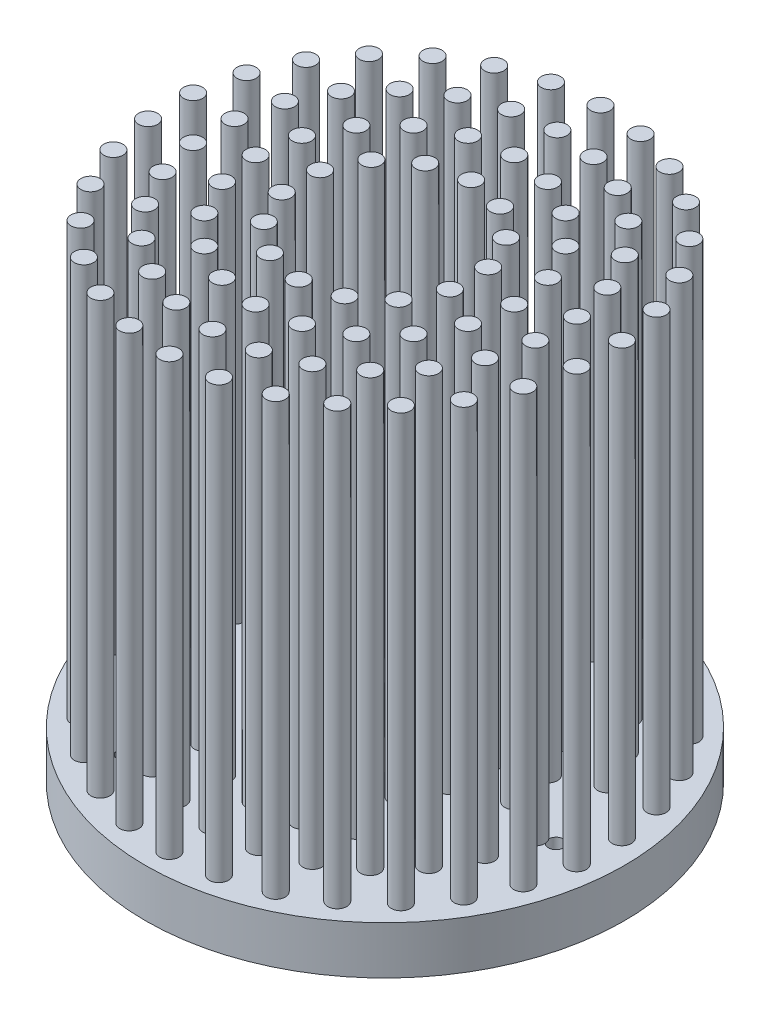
ISO-10303-21;
HEADER;
FILE_DESCRIPTION(('STEP AP214'),'2;1');
FILE_NAME('part.step','',(''),(''),'','','');
FILE_SCHEMA(('AUTOMOTIVE_DESIGN { 1 0 10303 214 1 1 1 1 }'));
ENDSEC;
DATA;
#1=APPLICATION_CONTEXT('core data for automotive mechanical design processes');
#2=APPLICATION_PROTOCOL_DEFINITION('international standard','automotive_design',2000,#1);
#3=PRODUCT_CONTEXT('',#1,'mechanical');
#4=PRODUCT('Part','Part','',(#3));
#5=PRODUCT_RELATED_PRODUCT_CATEGORY('part','',(#4));
#6=PRODUCT_DEFINITION_FORMATION('','',#4);
#7=PRODUCT_DEFINITION_CONTEXT('part definition',#1,'design');
#8=PRODUCT_DEFINITION('design','',#6,#7);
#9=PRODUCT_DEFINITION_SHAPE('','',#8);
#10=(LENGTH_UNIT() NAMED_UNIT(*) SI_UNIT(.MILLI.,.METRE.));
#11=(NAMED_UNIT(*) PLANE_ANGLE_UNIT() SI_UNIT($,.RADIAN.));
#12=(NAMED_UNIT(*) SI_UNIT($,.STERADIAN.) SOLID_ANGLE_UNIT());
#13=UNCERTAINTY_MEASURE_WITH_UNIT(LENGTH_MEASURE(1.E-05),#10,'distance_accuracy_value','');
#14=(GEOMETRIC_REPRESENTATION_CONTEXT(3) GLOBAL_UNCERTAINTY_ASSIGNED_CONTEXT((#13)) GLOBAL_UNIT_ASSIGNED_CONTEXT((#10,
#11,#12)) REPRESENTATION_CONTEXT('',''));
#15=CARTESIAN_POINT('',(0.,0.,0.));
#16=DIRECTION('',(0.,0.,1.));
#17=DIRECTION('',(1.,0.,0.));
#18=AXIS2_PLACEMENT_3D('',#15,#16,#17);
#19=CARTESIAN_POINT('',(19.4367675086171,0.,1.56909808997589));
#20=DIRECTION('',(0.,-1.,0.));
#21=DIRECTION('',(0.,0.,-1.));
#22=AXIS2_PLACEMENT_3D('',#19,#20,#21);
#23=CYLINDRICAL_SURFACE('',#22,0.799999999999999);
#24=CARTESIAN_POINT('',(19.4367675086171,0.,1.56909808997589));
#25=DIRECTION('',(0.,-1.,0.));
#26=DIRECTION('',(0.,0.,-1.));
#27=AXIS2_PLACEMENT_3D('',#24,#25,#26);
#28=CIRCLE('',#27,0.799999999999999);
#29=CARTESIAN_POINT('',(19.4367675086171,0.,0.769098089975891));
#30=VERTEX_POINT('',#29);
#31=EDGE_CURVE('E174',#30,#30,#28,.T.);
#32=ORIENTED_EDGE('',*,*,#31,.T.);
#33=EDGE_LOOP('',(#32));
#34=FACE_BOUND('',#33,.T.);
#35=CARTESIAN_POINT('',(19.4367675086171,5.,1.56909808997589));
#36=DIRECTION('',(0.,1.,0.));
#37=DIRECTION('',(0.,0.,1.));
#38=AXIS2_PLACEMENT_3D('',#35,#36,#37);
#39=CIRCLE('',#38,0.799999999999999);
#40=CARTESIAN_POINT('',(18.8680399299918,5.,2.13172491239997));
#41=VERTEX_POINT('',#40);
#42=CARTESIAN_POINT('',(18.6377065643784,5.,1.53034751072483));
#43=VERTEX_POINT('',#42);
#44=EDGE_CURVE('E11',#41,#43,#39,.F.);
#45=ORIENTED_EDGE('',*,*,#44,.F.);
#46=CARTESIAN_POINT('',(19.4367675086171,5.,1.56909808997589));
#47=DIRECTION('',(0.,1.,0.));
#48=DIRECTION('',(0.,0.,1.));
#49=AXIS2_PLACEMENT_3D('',#46,#47,#48);
#50=CIRCLE('',#49,0.799999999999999);
#51=EDGE_CURVE('E67',#41,#43,#50,.T.);
#52=ORIENTED_EDGE('',*,*,#51,.T.);
#53=EDGE_LOOP('',(#45,#52));
#54=FACE_BOUND('',#53,.T.);
#55=ADVANCED_FACE('F37',(#34,#54),#23,.F.);
#56=CARTESIAN_POINT('',(-8.35950494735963,0.,-17.6172834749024));
#57=DIRECTION('',(0.,-1.,0.));
#58=DIRECTION('',(0.,0.,-1.));
#59=AXIS2_PLACEMENT_3D('',#56,#57,#58);
#60=CYLINDRICAL_SURFACE('',#59,0.799999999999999);
#61=CARTESIAN_POINT('',(-8.35950494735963,0.,-17.6172834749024));
#62=DIRECTION('',(0.,-1.,0.));
#63=DIRECTION('',(0.,0.,-1.));
#64=AXIS2_PLACEMENT_3D('',#61,#62,#63);
#65=CIRCLE('',#64,0.799999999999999);
#66=CARTESIAN_POINT('',(-8.35950494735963,0.,-18.4172834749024));
#67=VERTEX_POINT('',#66);
#68=EDGE_CURVE('E177',#67,#67,#65,.T.);
#69=ORIENTED_EDGE('',*,*,#68,.T.);
#70=EDGE_LOOP('',(#69));
#71=FACE_BOUND('',#70,.T.);
#72=CARTESIAN_POINT('',(-8.35950494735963,5.,-17.6172834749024));
#73=DIRECTION('',(0.,1.,0.));
#74=DIRECTION('',(0.,0.,1.));
#75=AXIS2_PLACEMENT_3D('',#72,#73,#74);
#76=CIRCLE('',#75,0.799999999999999);
#77=CARTESIAN_POINT('',(-8.03992161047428,5.,-16.8838896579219));
#78=VERTEX_POINT('',#77);
#79=CARTESIAN_POINT('',(-8.68389658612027,5.,-16.8860037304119));
#80=VERTEX_POINT('',#79);
#81=EDGE_CURVE('E46',#78,#80,#76,.F.);
#82=ORIENTED_EDGE('',*,*,#81,.F.);
#83=CARTESIAN_POINT('',(-8.35950494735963,5.,-17.6172834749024));
#84=DIRECTION('',(0.,1.,0.));
#85=DIRECTION('',(0.,0.,1.));
#86=AXIS2_PLACEMENT_3D('',#83,#84,#85);
#87=CIRCLE('',#86,0.799999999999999);
#88=EDGE_CURVE('E74',#78,#80,#87,.T.);
#89=ORIENTED_EDGE('',*,*,#88,.T.);
#90=EDGE_LOOP('',(#82,#89));
#91=FACE_BOUND('',#90,.T.);
#92=ADVANCED_FACE('F477',(#71,#91),#60,.F.);
#93=CARTESIAN_POINT('',(0.,3.,0.));
#94=DIRECTION('',(0.,-1.,0.));
#95=DIRECTION('',(0.,0.,-1.));
#96=AXIS2_PLACEMENT_3D('',#93,#94,#95);
#97=CYLINDRICAL_SURFACE('',#96,25.);
#98=CARTESIAN_POINT('',(0.,0.,0.));
#99=DIRECTION('',(0.,1.,0.));
#100=DIRECTION('',(0.,0.,1.));
#101=AXIS2_PLACEMENT_3D('',#98,#99,#100);
#102=CIRCLE('',#101,25.);
#103=CARTESIAN_POINT('',(0.,0.,25.));
#104=VERTEX_POINT('',#103);
#105=EDGE_CURVE('E446',#104,#104,#102,.T.);
#106=ORIENTED_EDGE('',*,*,#105,.T.);
#107=EDGE_LOOP('',(#106));
#108=FACE_BOUND('',#107,.T.);
#109=CARTESIAN_POINT('',(0.,5.,0.));
#110=DIRECTION('',(0.,1.,0.));
#111=DIRECTION('',(0.,0.,1.));
#112=AXIS2_PLACEMENT_3D('',#109,#110,#111);
#113=CIRCLE('',#112,25.);
#114=CARTESIAN_POINT('',(0.,5.,25.));
#115=VERTEX_POINT('',#114);
#116=EDGE_CURVE('E180',#115,#115,#113,.T.);
#117=ORIENTED_EDGE('',*,*,#116,.F.);
#118=EDGE_LOOP('',(#117));
#119=FACE_BOUND('',#118,.T.);
#120=ADVANCED_FACE('F39',(#108,#119),#97,.T.);
#121=CARTESIAN_POINT('',(0.,0.,0.));
#122=DIRECTION('',(0.,1.,0.));
#123=DIRECTION('',(0.,0.,1.));
#124=AXIS2_PLACEMENT_3D('',#121,#122,#123);
#125=PLANE('',#124);
#126=CARTESIAN_POINT('',(0.,0.,0.));
#127=DIRECTION('',(0.,-1.,0.));
#128=DIRECTION('',(0.,0.,-1.));
#129=AXIS2_PLACEMENT_3D('',#126,#127,#128);
#130=CIRCLE('',#129,5.75);
#131=CARTESIAN_POINT('',(0.,0.,-5.75));
#132=VERTEX_POINT('',#131);
#133=EDGE_CURVE('E862',#132,#132,#130,.T.);
#134=ORIENTED_EDGE('',*,*,#133,.F.);
#135=EDGE_LOOP('',(#134));
#136=FACE_BOUND('',#135,.T.);
#137=CARTESIAN_POINT('',(-11.0772625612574,0.,16.0481853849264));
#138=DIRECTION('',(0.,-1.,0.));
#139=DIRECTION('',(0.,0.,-1.));
#140=AXIS2_PLACEMENT_3D('',#137,#138,#139);
#141=CIRCLE('',#140,0.799999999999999);
#142=CARTESIAN_POINT('',(-11.0772625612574,0.,15.2481853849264));
#143=VERTEX_POINT('',#142);
#144=EDGE_CURVE('E170',#143,#143,#141,.T.);
#145=ORIENTED_EDGE('',*,*,#144,.F.);
#146=EDGE_LOOP('',(#145));
#147=FACE_BOUND('',#146,.T.);
#148=ORIENTED_EDGE('',*,*,#31,.F.);
#149=EDGE_LOOP('',(#148));
#150=FACE_BOUND('',#149,.T.);
#151=ORIENTED_EDGE('',*,*,#68,.F.);
#152=EDGE_LOOP('',(#151));
#153=FACE_BOUND('',#152,.T.);
#154=ORIENTED_EDGE('',*,*,#105,.F.);
#155=EDGE_LOOP('',(#154));
#156=FACE_BOUND('',#155,.T.);
#157=ADVANCED_FACE('F462',(#136,#147,#150,#153,#156),#125,.F.);
#158=CARTESIAN_POINT('',(0.,5.,0.));
#159=DIRECTION('',(0.,1.,0.));
#160=DIRECTION('',(0.,0.,1.));
#161=AXIS2_PLACEMENT_3D('',#158,#159,#160);
#162=PLANE('',#161);
#163=CARTESIAN_POINT('',(0.,5.,0.));
#164=DIRECTION('',(0.,1.,0.));
#165=DIRECTION('',(0.,0.,1.));
#166=AXIS2_PLACEMENT_3D('',#163,#164,#165);
#167=CIRCLE('',#166,5.75);
#168=CARTESIAN_POINT('',(0.,4.99999999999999,-5.75));
#169=VERTEX_POINT('',#168);
#170=EDGE_CURVE('E41',#169,#169,#167,.T.);
#171=ORIENTED_EDGE('',*,*,#170,.F.);
#172=EDGE_LOOP('',(#171));
#173=FACE_BOUND('',#172,.T.);
#174=CARTESIAN_POINT('',(-11.0772625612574,5.,16.0481853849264));
#175=DIRECTION('',(0.,1.,0.));
#176=DIRECTION('',(0.,0.,1.));
#177=AXIS2_PLACEMENT_3D('',#174,#175,#176);
#178=CIRCLE('',#177,0.799999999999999);
#179=CARTESIAN_POINT('',(-11.0772625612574,5.,16.8481853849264));
#180=VERTEX_POINT('',#179);
#181=EDGE_CURVE('E173',#180,#180,#178,.T.);
#182=ORIENTED_EDGE('',*,*,#181,.F.);
#183=EDGE_LOOP('',(#182));
#184=FACE_BOUND('',#183,.T.);
#185=ORIENTED_EDGE('',*,*,#51,.F.);
#186=CARTESIAN_POINT('',(17.868759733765,5.,2.16966024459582));
#187=DIRECTION('',(0.,1.,0.));
#188=DIRECTION('',(0.,0.,1.));
#189=AXIS2_PLACEMENT_3D('',#186,#187,#188);
#190=CIRCLE('',#189,1.);
#191=EDGE_CURVE('E64',#43,#41,#190,.T.);
#192=ORIENTED_EDGE('',*,*,#191,.F.);
#193=EDGE_LOOP('',(#185,#192));
#194=FACE_BOUND('',#193,.T.);
#195=ORIENTED_EDGE('',*,*,#88,.F.);
#196=CARTESIAN_POINT('',(-8.3650170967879,5.,-15.9382084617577));
#197=DIRECTION('',(0.,1.,0.));
#198=DIRECTION('',(0.,0.,1.));
#199=AXIS2_PLACEMENT_3D('',#196,#197,#198);
#200=CIRCLE('',#199,1.);
#201=EDGE_CURVE('E401',#80,#78,#200,.T.);
#202=ORIENTED_EDGE('',*,*,#201,.F.);
#203=EDGE_LOOP('',(#195,#202));
#204=FACE_BOUND('',#203,.T.);
#205=CARTESIAN_POINT('',(0.,5.,-22.4999999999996));
#206=DIRECTION('',(0.,1.,0.));
#207=DIRECTION('',(0.,0.,1.));
#208=AXIS2_PLACEMENT_3D('',#205,#206,#207);
#209=CIRCLE('',#208,1.);
#210=CARTESIAN_POINT('',(0.,5.,-21.4999999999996));
#211=VERTEX_POINT('',#210);
#212=EDGE_CURVE('E443',#211,#211,#209,.T.);
#213=ORIENTED_EDGE('',*,*,#212,.F.);
#214=EDGE_LOOP('',(#213));
#215=FACE_BOUND('',#214,.T.);
#216=CARTESIAN_POINT('',(0.,5.,9.));
#217=DIRECTION('',(0.,1.,0.));
#218=DIRECTION('',(0.,0.,1.));
#219=AXIS2_PLACEMENT_3D('',#216,#217,#218);
#220=CIRCLE('',#219,1.);
#221=CARTESIAN_POINT('',(0.,5.,10.));
#222=VERTEX_POINT('',#221);
#223=EDGE_CURVE('E440',#222,#222,#220,.T.);
#224=ORIENTED_EDGE('',*,*,#223,.F.);
#225=EDGE_LOOP('',(#224));
#226=FACE_BOUND('',#225,.T.);
#227=CARTESIAN_POINT('',(1.88540101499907E-13,5.,18.));
#228=DIRECTION('',(0.,1.,0.));
#229=DIRECTION('',(0.,0.,1.));
#230=AXIS2_PLACEMENT_3D('',#227,#228,#229);
#231=CIRCLE('',#230,1.);
#232=CARTESIAN_POINT('',(1.88540101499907E-13,5.,19.));
#233=VERTEX_POINT('',#232);
#234=EDGE_CURVE('E434',#233,#233,#231,.T.);
#235=ORIENTED_EDGE('',*,*,#234,.F.);
#236=EDGE_LOOP('',(#235));
#237=FACE_BOUND('',#236,.T.);
#238=CARTESIAN_POINT('',(-8.36501709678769,5.,15.9382084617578));
#239=DIRECTION('',(0.,1.,0.));
#240=DIRECTION('',(0.,0.,1.));
#241=AXIS2_PLACEMENT_3D('',#238,#239,#240);
#242=CIRCLE('',#241,1.);
#243=CARTESIAN_POINT('',(-8.36501709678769,5.,16.9382084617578));
#244=VERTEX_POINT('',#243);
#245=EDGE_CURVE('E428',#244,#244,#242,.T.);
#246=ORIENTED_EDGE('',*,*,#245,.F.);
#247=EDGE_LOOP('',(#246));
#248=FACE_BOUND('',#247,.T.);
#249=CARTESIAN_POINT('',(-14.8137095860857,5.,10.2251654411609));
#250=DIRECTION('',(0.,1.,0.));
#251=DIRECTION('',(0.,0.,1.));
#252=AXIS2_PLACEMENT_3D('',#249,#250,#251);
#253=CIRCLE('',#252,0.999999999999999);
#254=CARTESIAN_POINT('',(-14.8137095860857,5.,11.2251654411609));
#255=VERTEX_POINT('',#254);
#256=EDGE_CURVE('E422',#255,#255,#253,.T.);
#257=ORIENTED_EDGE('',*,*,#256,.F.);
#258=EDGE_LOOP('',(#257));
#259=FACE_BOUND('',#258,.T.);
#260=CARTESIAN_POINT('',(-17.8687597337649,5.,2.16966024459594));
#261=DIRECTION('',(0.,1.,0.));
#262=DIRECTION('',(0.,0.,1.));
#263=AXIS2_PLACEMENT_3D('',#260,#261,#262);
#264=CIRCLE('',#263,1.);
#265=CARTESIAN_POINT('',(-17.8687597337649,5.,3.16966024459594));
#266=VERTEX_POINT('',#265);
#267=EDGE_CURVE('E416',#266,#266,#264,.T.);
#268=ORIENTED_EDGE('',*,*,#267,.F.);
#269=EDGE_LOOP('',(#268));
#270=FACE_BOUND('',#269,.T.);
#271=CARTESIAN_POINT('',(-16.8302923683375,5.,-6.38288796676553));
#272=DIRECTION('',(0.,1.,0.));
#273=DIRECTION('',(0.,0.,1.));
#274=AXIS2_PLACEMENT_3D('',#271,#272,#273);
#275=CIRCLE('',#274,1.);
#276=CARTESIAN_POINT('',(-16.8302923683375,5.,-5.38288796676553));
#277=VERTEX_POINT('',#276);
#278=EDGE_CURVE('E410',#277,#277,#275,.T.);
#279=ORIENTED_EDGE('',*,*,#278,.F.);
#280=EDGE_LOOP('',(#279));
#281=FACE_BOUND('',#280,.T.);
#282=CARTESIAN_POINT('',(-11.9362078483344,5.,-13.4731934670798));
#283=DIRECTION('',(0.,1.,0.));
#284=DIRECTION('',(0.,0.,1.));
#285=AXIS2_PLACEMENT_3D('',#282,#283,#284);
#286=CIRCLE('',#285,1.);
#287=CARTESIAN_POINT('',(-11.9362078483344,5.,-12.4731934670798));
#288=VERTEX_POINT('',#287);
#289=EDGE_CURVE('E404',#288,#288,#286,.T.);
#290=ORIENTED_EDGE('',*,*,#289,.F.);
#291=EDGE_LOOP('',(#290));
#292=FACE_BOUND('',#291,.T.);
#293=CARTESIAN_POINT('',(-4.30768195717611,5.,-17.4769527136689));
#294=DIRECTION('',(0.,1.,0.));
#295=DIRECTION('',(0.,0.,1.));
#296=AXIS2_PLACEMENT_3D('',#293,#294,#295);
#297=CIRCLE('',#296,1.);
#298=CARTESIAN_POINT('',(-4.30768195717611,5.,-16.4769527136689));
#299=VERTEX_POINT('',#298);
#300=EDGE_CURVE('E398',#299,#299,#297,.T.);
#301=ORIENTED_EDGE('',*,*,#300,.F.);
#302=EDGE_LOOP('',(#301));
#303=FACE_BOUND('',#302,.T.);
#304=CARTESIAN_POINT('',(4.30768195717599,5.,-17.4769527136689));
#305=DIRECTION('',(0.,1.,0.));
#306=DIRECTION('',(0.,0.,1.));
#307=AXIS2_PLACEMENT_3D('',#304,#305,#306);
#308=CIRCLE('',#307,1.);
#309=CARTESIAN_POINT('',(4.30768195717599,5.,-16.4769527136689));
#310=VERTEX_POINT('',#309);
#311=EDGE_CURVE('E392',#310,#310,#308,.T.);
#312=ORIENTED_EDGE('',*,*,#311,.F.);
#313=EDGE_LOOP('',(#312));
#314=FACE_BOUND('',#313,.T.);
#315=CARTESIAN_POINT('',(11.9362078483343,5.,-13.4731934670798));
#316=DIRECTION('',(0.,1.,0.));
#317=DIRECTION('',(0.,0.,1.));
#318=AXIS2_PLACEMENT_3D('',#315,#316,#317);
#319=CIRCLE('',#318,1.);
#320=CARTESIAN_POINT('',(11.9362078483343,5.,-12.4731934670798));
#321=VERTEX_POINT('',#320);
#322=EDGE_CURVE('E386',#321,#321,#319,.T.);
#323=ORIENTED_EDGE('',*,*,#322,.F.);
#324=EDGE_LOOP('',(#323));
#325=FACE_BOUND('',#324,.T.);
#326=CARTESIAN_POINT('',(16.8302923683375,5.,-6.38288796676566));
#327=DIRECTION('',(0.,1.,0.));
#328=DIRECTION('',(0.,0.,1.));
#329=AXIS2_PLACEMENT_3D('',#326,#327,#328);
#330=CIRCLE('',#329,1.);
#331=CARTESIAN_POINT('',(16.8302923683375,5.,-5.38288796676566));
#332=VERTEX_POINT('',#331);
#333=EDGE_CURVE('E380',#332,#332,#330,.T.);
#334=ORIENTED_EDGE('',*,*,#333,.F.);
#335=EDGE_LOOP('',(#334));
#336=FACE_BOUND('',#335,.T.);
#337=CARTESIAN_POINT('',(14.8137095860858,5.,10.2251654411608));
#338=DIRECTION('',(0.,1.,0.));
#339=DIRECTION('',(0.,0.,1.));
#340=AXIS2_PLACEMENT_3D('',#337,#338,#339);
#341=CIRCLE('',#340,1.);
#342=CARTESIAN_POINT('',(14.8137095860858,5.,11.2251654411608));
#343=VERTEX_POINT('',#342);
#344=EDGE_CURVE('E373',#343,#343,#341,.T.);
#345=ORIENTED_EDGE('',*,*,#344,.F.);
#346=EDGE_LOOP('',(#345));
#347=FACE_BOUND('',#346,.T.);
#348=CARTESIAN_POINT('',(8.3650170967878,5.,15.9382084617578));
#349=DIRECTION('',(0.,1.,0.));
#350=DIRECTION('',(0.,0.,1.));
#351=AXIS2_PLACEMENT_3D('',#348,#349,#350);
#352=CIRCLE('',#351,1.);
#353=CARTESIAN_POINT('',(8.3650170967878,5.,16.9382084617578));
#354=VERTEX_POINT('',#353);
#355=EDGE_CURVE('E367',#354,#354,#352,.T.);
#356=ORIENTED_EDGE('',*,*,#355,.F.);
#357=EDGE_LOOP('',(#356));
#358=FACE_BOUND('',#357,.T.);
#359=CARTESIAN_POINT('',(-4.17172942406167,5.,12.8392629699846));
#360=DIRECTION('',(0.,1.,0.));
#361=DIRECTION('',(0.,0.,1.));
#362=AXIS2_PLACEMENT_3D('',#359,#360,#361);
#363=CIRCLE('',#362,1.);
#364=CARTESIAN_POINT('',(-4.17172942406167,5.,13.8392629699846));
#365=VERTEX_POINT('',#364);
#366=EDGE_CURVE('E361',#365,#365,#363,.T.);
#367=ORIENTED_EDGE('',*,*,#366,.F.);
#368=EDGE_LOOP('',(#367));
#369=FACE_BOUND('',#368,.T.);
#370=CARTESIAN_POINT('',(-10.9217294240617,5.,7.93510090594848));
#371=DIRECTION('',(0.,1.,0.));
#372=DIRECTION('',(0.,0.,1.));
#373=AXIS2_PLACEMENT_3D('',#370,#371,#372);
#374=CIRCLE('',#373,1.);
#375=CARTESIAN_POINT('',(-10.9217294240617,5.,8.93510090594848));
#376=VERTEX_POINT('',#375);
#377=EDGE_CURVE('E355',#376,#376,#374,.T.);
#378=ORIENTED_EDGE('',*,*,#377,.F.);
#379=EDGE_LOOP('',(#378));
#380=FACE_BOUND('',#379,.T.);
#381=CARTESIAN_POINT('',(-13.5,5.,0.));
#382=DIRECTION('',(0.,1.,0.));
#383=DIRECTION('',(0.,0.,1.));
#384=AXIS2_PLACEMENT_3D('',#381,#382,#383);
#385=CIRCLE('',#384,1.);
#386=CARTESIAN_POINT('',(-13.5,5.,1.00000000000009));
#387=VERTEX_POINT('',#386);
#388=EDGE_CURVE('E349',#387,#387,#385,.T.);
#389=ORIENTED_EDGE('',*,*,#388,.F.);
#390=EDGE_LOOP('',(#389));
#391=FACE_BOUND('',#390,.T.);
#392=CARTESIAN_POINT('',(-10.9217294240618,5.,-7.93510090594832));
#393=DIRECTION('',(0.,1.,0.));
#394=DIRECTION('',(0.,0.,1.));
#395=AXIS2_PLACEMENT_3D('',#392,#393,#394);
#396=CIRCLE('',#395,0.999999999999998);
#397=CARTESIAN_POINT('',(-10.9217294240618,5.,-6.93510090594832));
#398=VERTEX_POINT('',#397);
#399=EDGE_CURVE('E343',#398,#398,#396,.T.);
#400=ORIENTED_EDGE('',*,*,#399,.F.);
#401=EDGE_LOOP('',(#400));
#402=FACE_BOUND('',#401,.T.);
#403=CARTESIAN_POINT('',(-4.17172942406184,5.,-12.8392629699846));
#404=DIRECTION('',(0.,1.,0.));
#405=DIRECTION('',(0.,0.,1.));
#406=AXIS2_PLACEMENT_3D('',#403,#404,#405);
#407=CIRCLE('',#406,1.);
#408=CARTESIAN_POINT('',(-4.17172942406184,5.,-11.8392629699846));
#409=VERTEX_POINT('',#408);
#410=EDGE_CURVE('E337',#409,#409,#407,.T.);
#411=ORIENTED_EDGE('',*,*,#410,.F.);
#412=EDGE_LOOP('',(#411));
#413=FACE_BOUND('',#412,.T.);
#414=CARTESIAN_POINT('',(4.17172942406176,5.,-12.8392629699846));
#415=DIRECTION('',(0.,1.,0.));
#416=DIRECTION('',(0.,0.,1.));
#417=AXIS2_PLACEMENT_3D('',#414,#415,#416);
#418=CIRCLE('',#417,1.);
#419=CARTESIAN_POINT('',(4.17172942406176,5.,-11.8392629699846));
#420=VERTEX_POINT('',#419);
#421=EDGE_CURVE('E331',#420,#420,#418,.T.);
#422=ORIENTED_EDGE('',*,*,#421,.F.);
#423=EDGE_LOOP('',(#422));
#424=FACE_BOUND('',#423,.T.);
#425=CARTESIAN_POINT('',(10.9217294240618,5.,-7.9351009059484));
#426=DIRECTION('',(0.,1.,0.));
#427=DIRECTION('',(0.,0.,1.));
#428=AXIS2_PLACEMENT_3D('',#425,#426,#427);
#429=CIRCLE('',#428,0.999999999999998);
#430=CARTESIAN_POINT('',(10.9217294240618,5.,-6.9351009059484));
#431=VERTEX_POINT('',#430);
#432=EDGE_CURVE('E325',#431,#431,#429,.T.);
#433=ORIENTED_EDGE('',*,*,#432,.F.);
#434=EDGE_LOOP('',(#433));
#435=FACE_BOUND('',#434,.T.);
#436=CARTESIAN_POINT('',(13.5,5.,0.));
#437=DIRECTION('',(0.,1.,0.));
#438=DIRECTION('',(0.,0.,1.));
#439=AXIS2_PLACEMENT_3D('',#436,#437,#438);
#440=CIRCLE('',#439,1.);
#441=CARTESIAN_POINT('',(13.5,5.,1.));
#442=VERTEX_POINT('',#441);
#443=EDGE_CURVE('E319',#442,#442,#440,.T.);
#444=ORIENTED_EDGE('',*,*,#443,.F.);
#445=EDGE_LOOP('',(#444));
#446=FACE_BOUND('',#445,.T.);
#447=CARTESIAN_POINT('',(10.9217294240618,5.,7.93510090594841));
#448=DIRECTION('',(0.,1.,0.));
#449=DIRECTION('',(0.,0.,1.));
#450=AXIS2_PLACEMENT_3D('',#447,#448,#449);
#451=CIRCLE('',#450,1.);
#452=CARTESIAN_POINT('',(10.9217294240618,5.,8.93510090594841));
#453=VERTEX_POINT('',#452);
#454=EDGE_CURVE('E313',#453,#453,#451,.T.);
#455=ORIENTED_EDGE('',*,*,#454,.F.);
#456=EDGE_LOOP('',(#455));
#457=FACE_BOUND('',#456,.T.);
#458=CARTESIAN_POINT('',(4.17172942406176,5.,12.8392629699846));
#459=DIRECTION('',(0.,1.,0.));
#460=DIRECTION('',(0.,0.,1.));
#461=AXIS2_PLACEMENT_3D('',#458,#459,#460);
#462=CIRCLE('',#461,1.);
#463=CARTESIAN_POINT('',(4.17172942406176,5.,13.8392629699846));
#464=VERTEX_POINT('',#463);
#465=EDGE_CURVE('E307',#464,#464,#462,.T.);
#466=ORIENTED_EDGE('',*,*,#465,.F.);
#467=EDGE_LOOP('',(#466));
#468=FACE_BOUND('',#467,.T.);
#469=CARTESIAN_POINT('',(-7.03648334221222,5.,5.61140821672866));
#470=DIRECTION('',(0.,1.,0.));
#471=DIRECTION('',(0.,0.,1.));
#472=AXIS2_PLACEMENT_3D('',#469,#470,#471);
#473=CIRCLE('',#472,1.);
#474=CARTESIAN_POINT('',(-7.03648334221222,5.,6.61140821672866));
#475=VERTEX_POINT('',#474);
#476=EDGE_CURVE('E301',#475,#475,#473,.T.);
#477=ORIENTED_EDGE('',*,*,#476,.F.);
#478=EDGE_LOOP('',(#477));
#479=FACE_BOUND('',#478,.T.);
#480=CARTESIAN_POINT('',(-8.77435120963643,5.,-2.00268840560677));
#481=DIRECTION('',(0.,1.,0.));
#482=DIRECTION('',(0.,0.,1.));
#483=AXIS2_PLACEMENT_3D('',#480,#481,#482);
#484=CIRCLE('',#483,1.);
#485=CARTESIAN_POINT('',(-8.77435120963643,5.,-1.00268840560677));
#486=VERTEX_POINT('',#485);
#487=EDGE_CURVE('E295',#486,#486,#484,.T.);
#488=ORIENTED_EDGE('',*,*,#487,.F.);
#489=EDGE_LOOP('',(#488));
#490=FACE_BOUND('',#489,.T.);
#491=CARTESIAN_POINT('',(-3.90495365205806,5.,-8.10871981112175));
#492=DIRECTION('',(0.,1.,0.));
#493=DIRECTION('',(0.,0.,1.));
#494=AXIS2_PLACEMENT_3D('',#491,#492,#493);
#495=CIRCLE('',#494,1.);
#496=CARTESIAN_POINT('',(-3.90495365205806,5.,-7.10871981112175));
#497=VERTEX_POINT('',#496);
#498=EDGE_CURVE('E289',#497,#497,#495,.T.);
#499=ORIENTED_EDGE('',*,*,#498,.F.);
#500=EDGE_LOOP('',(#499));
#501=FACE_BOUND('',#500,.T.);
#502=CARTESIAN_POINT('',(3.904953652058,5.,-8.10871981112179));
#503=DIRECTION('',(0.,1.,0.));
#504=DIRECTION('',(0.,0.,1.));
#505=AXIS2_PLACEMENT_3D('',#502,#503,#504);
#506=CIRCLE('',#505,1.);
#507=CARTESIAN_POINT('',(3.904953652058,5.,-7.10871981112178));
#508=VERTEX_POINT('',#507);
#509=EDGE_CURVE('E283',#508,#508,#506,.T.);
#510=ORIENTED_EDGE('',*,*,#509,.F.);
#511=EDGE_LOOP('',(#510));
#512=FACE_BOUND('',#511,.T.);
#513=CARTESIAN_POINT('',(8.77435120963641,5.,-2.00268840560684));
#514=DIRECTION('',(0.,1.,0.));
#515=DIRECTION('',(0.,0.,1.));
#516=AXIS2_PLACEMENT_3D('',#513,#514,#515);
#517=CIRCLE('',#516,1.);
#518=CARTESIAN_POINT('',(8.77435120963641,5.,-1.00268840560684));
#519=VERTEX_POINT('',#518);
#520=EDGE_CURVE('E277',#519,#519,#517,.T.);
#521=ORIENTED_EDGE('',*,*,#520,.F.);
#522=EDGE_LOOP('',(#521));
#523=FACE_BOUND('',#522,.T.);
#524=CARTESIAN_POINT('',(7.03648334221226,5.,5.61140821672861));
#525=DIRECTION('',(0.,1.,0.));
#526=DIRECTION('',(0.,0.,1.));
#527=AXIS2_PLACEMENT_3D('',#524,#525,#526);
#528=CIRCLE('',#527,1.);
#529=CARTESIAN_POINT('',(7.03648334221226,5.,6.61140821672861));
#530=VERTEX_POINT('',#529);
#531=EDGE_CURVE('E271',#530,#530,#528,.T.);
#532=ORIENTED_EDGE('',*,*,#531,.F.);
#533=EDGE_LOOP('',(#532));
#534=FACE_BOUND('',#533,.T.);
#535=CARTESIAN_POINT('',(4.67801304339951,5.,-22.0083210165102));
#536=DIRECTION('',(0.,1.,0.));
#537=DIRECTION('',(0.,0.,1.));
#538=AXIS2_PLACEMENT_3D('',#535,#536,#537);
#539=CIRCLE('',#538,1.);
#540=CARTESIAN_POINT('',(4.67801304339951,5.,-21.0083210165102));
#541=VERTEX_POINT('',#540);
#542=EDGE_CURVE('E265',#541,#541,#539,.T.);
#543=ORIENTED_EDGE('',*,*,#542,.F.);
#544=EDGE_LOOP('',(#543));
#545=FACE_BOUND('',#544,.T.);
#546=CARTESIAN_POINT('',(13.2251681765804,5.,-18.202882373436));
#547=DIRECTION('',(0.,1.,0.));
#548=DIRECTION('',(0.,0.,1.));
#549=AXIS2_PLACEMENT_3D('',#546,#547,#548);
#550=CIRCLE('',#549,0.999999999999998);
#551=CARTESIAN_POINT('',(13.2251681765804,5.,-17.202882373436));
#552=VERTEX_POINT('',#551);
#553=EDGE_CURVE('E259',#552,#552,#550,.T.);
#554=ORIENTED_EDGE('',*,*,#553,.F.);
#555=EDGE_LOOP('',(#554));
#556=FACE_BOUND('',#555,.T.);
#557=CARTESIAN_POINT('',(19.4855715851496,5.,-11.2499999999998));
#558=DIRECTION('',(0.,1.,0.));
#559=DIRECTION('',(0.,0.,1.));
#560=AXIS2_PLACEMENT_3D('',#557,#558,#559);
#561=CIRCLE('',#560,0.999999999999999);
#562=CARTESIAN_POINT('',(19.4855715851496,5.,-10.2499999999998));
#563=VERTEX_POINT('',#562);
#564=EDGE_CURVE('E253',#563,#563,#561,.T.);
#565=ORIENTED_EDGE('',*,*,#564,.F.);
#566=EDGE_LOOP('',(#565));
#567=FACE_BOUND('',#566,.T.);
#568=CARTESIAN_POINT('',(22.3767426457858,5.,-2.3518904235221));
#569=DIRECTION('',(0.,1.,0.));
#570=DIRECTION('',(0.,0.,1.));
#571=AXIS2_PLACEMENT_3D('',#568,#569,#570);
#572=CIRCLE('',#571,1.);
#573=CARTESIAN_POINT('',(22.3767426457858,5.,-1.3518904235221));
#574=VERTEX_POINT('',#573);
#575=EDGE_CURVE('E247',#574,#574,#572,.T.);
#576=ORIENTED_EDGE('',*,*,#575,.F.);
#577=EDGE_LOOP('',(#576));
#578=FACE_BOUND('',#577,.T.);
#579=CARTESIAN_POINT('',(21.3987716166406,5.,6.95288237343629));
#580=DIRECTION('',(0.,1.,0.));
#581=DIRECTION('',(0.,0.,1.));
#582=AXIS2_PLACEMENT_3D('',#579,#580,#581);
#583=CIRCLE('',#582,1.);
#584=CARTESIAN_POINT('',(21.3987716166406,5.,7.95288237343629));
#585=VERTEX_POINT('',#584);
#586=EDGE_CURVE('E241',#585,#585,#583,.T.);
#587=ORIENTED_EDGE('',*,*,#586,.F.);
#588=EDGE_LOOP('',(#587));
#589=FACE_BOUND('',#588,.T.);
#590=CARTESIAN_POINT('',(16.720758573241,5.,15.0554386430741));
#591=DIRECTION('',(0.,1.,0.));
#592=DIRECTION('',(0.,0.,1.));
#593=AXIS2_PLACEMENT_3D('',#590,#591,#592);
#594=CIRCLE('',#593,1.);
#595=CARTESIAN_POINT('',(16.720758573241,5.,16.0554386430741));
#596=VERTEX_POINT('',#595);
#597=EDGE_CURVE('E235',#596,#596,#594,.T.);
#598=ORIENTED_EDGE('',*,*,#597,.F.);
#599=EDGE_LOOP('',(#598));
#600=FACE_BOUND('',#599,.T.);
#601=CARTESIAN_POINT('',(9.15157446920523,5.,20.5547727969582));
#602=DIRECTION('',(0.,1.,0.));
#603=DIRECTION('',(0.,0.,1.));
#604=AXIS2_PLACEMENT_3D('',#601,#602,#603);
#605=CIRCLE('',#604,1.);
#606=CARTESIAN_POINT('',(9.15157446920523,5.,21.5547727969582));
#607=VERTEX_POINT('',#606);
#608=EDGE_CURVE('E229',#607,#607,#605,.T.);
#609=ORIENTED_EDGE('',*,*,#608,.F.);
#610=EDGE_LOOP('',(#609));
#611=FACE_BOUND('',#610,.T.);
#612=CARTESIAN_POINT('',(-1.5711675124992E-13,5.,22.4999999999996));
#613=DIRECTION('',(0.,1.,0.));
#614=DIRECTION('',(0.,0.,1.));
#615=AXIS2_PLACEMENT_3D('',#612,#613,#614);
#616=CIRCLE('',#615,1.);
#617=CARTESIAN_POINT('',(-1.5711675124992E-13,5.,23.4999999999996));
#618=VERTEX_POINT('',#617);
#619=EDGE_CURVE('E223',#618,#618,#616,.T.);
#620=ORIENTED_EDGE('',*,*,#619,.F.);
#621=EDGE_LOOP('',(#620));
#622=FACE_BOUND('',#621,.T.);
#623=CARTESIAN_POINT('',(-9.1515744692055,5.,20.5547727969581));
#624=DIRECTION('',(0.,1.,0.));
#625=DIRECTION('',(0.,0.,1.));
#626=AXIS2_PLACEMENT_3D('',#623,#624,#625);
#627=CIRCLE('',#626,1.);
#628=CARTESIAN_POINT('',(-9.1515744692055,5.,21.5547727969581));
#629=VERTEX_POINT('',#628);
#630=EDGE_CURVE('E217',#629,#629,#627,.T.);
#631=ORIENTED_EDGE('',*,*,#630,.F.);
#632=EDGE_LOOP('',(#631));
#633=FACE_BOUND('',#632,.T.);
#634=CARTESIAN_POINT('',(-16.7207585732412,5.,15.0554386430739));
#635=DIRECTION('',(0.,1.,0.));
#636=DIRECTION('',(0.,0.,1.));
#637=AXIS2_PLACEMENT_3D('',#634,#635,#636);
#638=CIRCLE('',#637,1.);
#639=CARTESIAN_POINT('',(-16.7207585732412,5.,16.0554386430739));
#640=VERTEX_POINT('',#639);
#641=EDGE_CURVE('E211',#640,#640,#638,.T.);
#642=ORIENTED_EDGE('',*,*,#641,.F.);
#643=EDGE_LOOP('',(#642));
#644=FACE_BOUND('',#643,.T.);
#645=CARTESIAN_POINT('',(-21.3987716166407,5.,6.95288237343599));
#646=DIRECTION('',(0.,1.,0.));
#647=DIRECTION('',(0.,0.,1.));
#648=AXIS2_PLACEMENT_3D('',#645,#646,#647);
#649=CIRCLE('',#648,1.);
#650=CARTESIAN_POINT('',(-21.3987716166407,5.,7.95288237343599));
#651=VERTEX_POINT('',#650);
#652=EDGE_CURVE('E205',#651,#651,#649,.T.);
#653=ORIENTED_EDGE('',*,*,#652,.F.);
#654=EDGE_LOOP('',(#653));
#655=FACE_BOUND('',#654,.T.);
#656=CARTESIAN_POINT('',(-22.3767426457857,5.,-2.35189042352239));
#657=DIRECTION('',(0.,1.,0.));
#658=DIRECTION('',(0.,0.,1.));
#659=AXIS2_PLACEMENT_3D('',#656,#657,#658);
#660=CIRCLE('',#659,1.);
#661=CARTESIAN_POINT('',(-22.3767426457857,5.,-1.35189042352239));
#662=VERTEX_POINT('',#661);
#663=EDGE_CURVE('E199',#662,#662,#660,.T.);
#664=ORIENTED_EDGE('',*,*,#663,.F.);
#665=EDGE_LOOP('',(#664));
#666=FACE_BOUND('',#665,.T.);
#667=CARTESIAN_POINT('',(-19.4855715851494,5.,-11.25));
#668=DIRECTION('',(0.,1.,0.));
#669=DIRECTION('',(0.,0.,1.));
#670=AXIS2_PLACEMENT_3D('',#667,#668,#669);
#671=CIRCLE('',#670,1.);
#672=CARTESIAN_POINT('',(-19.4855715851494,5.,-10.25));
#673=VERTEX_POINT('',#672);
#674=EDGE_CURVE('E193',#673,#673,#671,.T.);
#675=ORIENTED_EDGE('',*,*,#674,.F.);
#676=EDGE_LOOP('',(#675));
#677=FACE_BOUND('',#676,.T.);
#678=CARTESIAN_POINT('',(-13.2251681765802,5.,-18.2028823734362));
#679=DIRECTION('',(0.,1.,0.));
#680=DIRECTION('',(0.,0.,1.));
#681=AXIS2_PLACEMENT_3D('',#678,#679,#680);
#682=CIRCLE('',#681,1.);
#683=CARTESIAN_POINT('',(-13.2251681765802,5.,-17.2028823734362));
#684=VERTEX_POINT('',#683);
#685=EDGE_CURVE('E187',#684,#684,#682,.T.);
#686=ORIENTED_EDGE('',*,*,#685,.F.);
#687=EDGE_LOOP('',(#686));
#688=FACE_BOUND('',#687,.T.);
#689=CARTESIAN_POINT('',(-4.67801304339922,5.,-22.0083210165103));
#690=DIRECTION('',(0.,1.,0.));
#691=DIRECTION('',(0.,0.,1.));
#692=AXIS2_PLACEMENT_3D('',#689,#690,#691);
#693=CIRCLE('',#692,1.);
#694=CARTESIAN_POINT('',(-4.67801304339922,5.,-21.0083210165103));
#695=VERTEX_POINT('',#694);
#696=EDGE_CURVE('E183',#695,#695,#693,.T.);
#697=ORIENTED_EDGE('',*,*,#696,.F.);
#698=EDGE_LOOP('',(#697));
#699=FACE_BOUND('',#698,.T.);
#700=ORIENTED_EDGE('',*,*,#116,.T.);
#701=EDGE_LOOP('',(#700));
#702=FACE_BOUND('',#701,.T.);
#703=CARTESIAN_POINT('',(-9.15157446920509,5.,-20.5547727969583));
#704=DIRECTION('',(0.,1.,0.));
#705=DIRECTION('',(0.,0.,1.));
#706=AXIS2_PLACEMENT_3D('',#703,#704,#705);
#707=CIRCLE('',#706,0.999999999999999);
#708=CARTESIAN_POINT('',(-9.15157446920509,5.,-19.5547727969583));
#709=VERTEX_POINT('',#708);
#710=EDGE_CURVE('E184',#709,#709,#707,.T.);
#711=ORIENTED_EDGE('',*,*,#710,.F.);
#712=EDGE_LOOP('',(#711));
#713=FACE_BOUND('',#712,.T.);
#714=CARTESIAN_POINT('',(-16.7207585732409,5.,-15.0554386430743));
#715=DIRECTION('',(0.,1.,0.));
#716=DIRECTION('',(0.,0.,1.));
#717=AXIS2_PLACEMENT_3D('',#714,#715,#716);
#718=CIRCLE('',#717,0.999999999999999);
#719=CARTESIAN_POINT('',(-16.7207585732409,5.,-14.0554386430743));
#720=VERTEX_POINT('',#719);
#721=EDGE_CURVE('E190',#720,#720,#718,.T.);
#722=ORIENTED_EDGE('',*,*,#721,.F.);
#723=EDGE_LOOP('',(#722));
#724=FACE_BOUND('',#723,.T.);
#725=CARTESIAN_POINT('',(-21.3987716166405,5.,-6.95288237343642));
#726=DIRECTION('',(0.,1.,0.));
#727=DIRECTION('',(0.,0.,1.));
#728=AXIS2_PLACEMENT_3D('',#725,#726,#727);
#729=CIRCLE('',#728,1.);
#730=CARTESIAN_POINT('',(-21.3987716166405,5.,-5.95288237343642));
#731=VERTEX_POINT('',#730);
#732=EDGE_CURVE('E196',#731,#731,#729,.T.);
#733=ORIENTED_EDGE('',*,*,#732,.F.);
#734=EDGE_LOOP('',(#733));
#735=FACE_BOUND('',#734,.T.);
#736=CARTESIAN_POINT('',(-22.3767426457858,5.,2.35189042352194));
#737=DIRECTION('',(0.,1.,0.));
#738=DIRECTION('',(0.,0.,1.));
#739=AXIS2_PLACEMENT_3D('',#736,#737,#738);
#740=CIRCLE('',#739,1.);
#741=CARTESIAN_POINT('',(-22.3767426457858,5.,3.35189042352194));
#742=VERTEX_POINT('',#741);
#743=EDGE_CURVE('E202',#742,#742,#740,.T.);
#744=ORIENTED_EDGE('',*,*,#743,.F.);
#745=EDGE_LOOP('',(#744));
#746=FACE_BOUND('',#745,.T.);
#747=CARTESIAN_POINT('',(-19.4855715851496,5.,11.2499999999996));
#748=DIRECTION('',(0.,1.,0.));
#749=DIRECTION('',(0.,0.,1.));
#750=AXIS2_PLACEMENT_3D('',#747,#748,#749);
#751=CIRCLE('',#750,0.999999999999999);
#752=CARTESIAN_POINT('',(-19.4855715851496,5.,12.2499999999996));
#753=VERTEX_POINT('',#752);
#754=EDGE_CURVE('E208',#753,#753,#751,.T.);
#755=ORIENTED_EDGE('',*,*,#754,.F.);
#756=EDGE_LOOP('',(#755));
#757=FACE_BOUND('',#756,.T.);
#758=CARTESIAN_POINT('',(-13.2251681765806,5.,18.2028823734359));
#759=DIRECTION('',(0.,1.,0.));
#760=DIRECTION('',(0.,0.,1.));
#761=AXIS2_PLACEMENT_3D('',#758,#759,#760);
#762=CIRCLE('',#761,1.);
#763=CARTESIAN_POINT('',(-13.2251681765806,5.,19.2028823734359));
#764=VERTEX_POINT('',#763);
#765=EDGE_CURVE('E214',#764,#764,#762,.T.);
#766=ORIENTED_EDGE('',*,*,#765,.F.);
#767=EDGE_LOOP('',(#766));
#768=FACE_BOUND('',#767,.T.);
#769=CARTESIAN_POINT('',(-4.67801304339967,5.,22.0083210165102));
#770=DIRECTION('',(0.,1.,0.));
#771=DIRECTION('',(0.,0.,1.));
#772=AXIS2_PLACEMENT_3D('',#769,#770,#771);
#773=CIRCLE('',#772,1.);
#774=CARTESIAN_POINT('',(-4.67801304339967,5.,23.0083210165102));
#775=VERTEX_POINT('',#774);
#776=EDGE_CURVE('E220',#775,#775,#773,.T.);
#777=ORIENTED_EDGE('',*,*,#776,.F.);
#778=EDGE_LOOP('',(#777));
#779=FACE_BOUND('',#778,.T.);
#780=CARTESIAN_POINT('',(4.67801304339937,5.,22.0083210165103));
#781=DIRECTION('',(0.,1.,0.));
#782=DIRECTION('',(0.,0.,1.));
#783=AXIS2_PLACEMENT_3D('',#780,#781,#782);
#784=CIRCLE('',#783,1.);
#785=CARTESIAN_POINT('',(4.67801304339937,5.,23.0083210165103));
#786=VERTEX_POINT('',#785);
#787=EDGE_CURVE('E226',#786,#786,#784,.T.);
#788=ORIENTED_EDGE('',*,*,#787,.F.);
#789=EDGE_LOOP('',(#788));
#790=FACE_BOUND('',#789,.T.);
#791=CARTESIAN_POINT('',(13.2251681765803,5.,18.2028823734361));
#792=DIRECTION('',(0.,1.,0.));
#793=DIRECTION('',(0.,0.,1.));
#794=AXIS2_PLACEMENT_3D('',#791,#792,#793);
#795=CIRCLE('',#794,1.);
#796=CARTESIAN_POINT('',(13.2251681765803,5.,19.2028823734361));
#797=VERTEX_POINT('',#796);
#798=EDGE_CURVE('E232',#797,#797,#795,.T.);
#799=ORIENTED_EDGE('',*,*,#798,.F.);
#800=EDGE_LOOP('',(#799));
#801=FACE_BOUND('',#800,.T.);
#802=CARTESIAN_POINT('',(19.4855715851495,5.,11.2499999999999));
#803=DIRECTION('',(0.,1.,0.));
#804=DIRECTION('',(0.,0.,1.));
#805=AXIS2_PLACEMENT_3D('',#802,#803,#804);
#806=CIRCLE('',#805,1.);
#807=CARTESIAN_POINT('',(19.4855715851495,5.,12.2499999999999));
#808=VERTEX_POINT('',#807);
#809=EDGE_CURVE('E238',#808,#808,#806,.T.);
#810=ORIENTED_EDGE('',*,*,#809,.F.);
#811=EDGE_LOOP('',(#810));
#812=FACE_BOUND('',#811,.T.);
#813=CARTESIAN_POINT('',(22.3767426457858,5.,2.35189042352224));
#814=DIRECTION('',(0.,1.,0.));
#815=DIRECTION('',(0.,0.,1.));
#816=AXIS2_PLACEMENT_3D('',#813,#814,#815);
#817=CIRCLE('',#816,1.);
#818=CARTESIAN_POINT('',(22.3767426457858,5.,3.35189042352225));
#819=VERTEX_POINT('',#818);
#820=EDGE_CURVE('E244',#819,#819,#817,.T.);
#821=ORIENTED_EDGE('',*,*,#820,.F.);
#822=EDGE_LOOP('',(#821));
#823=FACE_BOUND('',#822,.T.);
#824=CARTESIAN_POINT('',(21.3987716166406,5.,-6.95288237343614));
#825=DIRECTION('',(0.,1.,0.));
#826=DIRECTION('',(0.,0.,1.));
#827=AXIS2_PLACEMENT_3D('',#824,#825,#826);
#828=CIRCLE('',#827,1.);
#829=CARTESIAN_POINT('',(21.3987716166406,5.,-5.95288237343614));
#830=VERTEX_POINT('',#829);
#831=EDGE_CURVE('E250',#830,#830,#828,.T.);
#832=ORIENTED_EDGE('',*,*,#831,.F.);
#833=EDGE_LOOP('',(#832));
#834=FACE_BOUND('',#833,.T.);
#835=CARTESIAN_POINT('',(16.7207585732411,5.,-15.055438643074));
#836=DIRECTION('',(0.,1.,0.));
#837=DIRECTION('',(0.,0.,1.));
#838=AXIS2_PLACEMENT_3D('',#835,#836,#837);
#839=CIRCLE('',#838,0.999999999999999);
#840=CARTESIAN_POINT('',(16.7207585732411,5.,-14.055438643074));
#841=VERTEX_POINT('',#840);
#842=EDGE_CURVE('E256',#841,#841,#839,.T.);
#843=ORIENTED_EDGE('',*,*,#842,.F.);
#844=EDGE_LOOP('',(#843));
#845=FACE_BOUND('',#844,.T.);
#846=CARTESIAN_POINT('',(9.15157446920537,5.,-20.5547727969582));
#847=DIRECTION('',(0.,1.,0.));
#848=DIRECTION('',(0.,0.,1.));
#849=AXIS2_PLACEMENT_3D('',#846,#847,#848);
#850=CIRCLE('',#849,1.);
#851=CARTESIAN_POINT('',(9.15157446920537,5.,-19.5547727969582));
#852=VERTEX_POINT('',#851);
#853=EDGE_CURVE('E262',#852,#852,#850,.T.);
#854=ORIENTED_EDGE('',*,*,#853,.F.);
#855=EDGE_LOOP('',(#854));
#856=FACE_BOUND('',#855,.T.);
#857=CARTESIAN_POINT('',(3.904953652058,5.,8.10871981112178));
#858=DIRECTION('',(0.,1.,0.));
#859=DIRECTION('',(0.,0.,1.));
#860=AXIS2_PLACEMENT_3D('',#857,#858,#859);
#861=CIRCLE('',#860,0.999999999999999);
#862=CARTESIAN_POINT('',(3.904953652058,5.,9.10871981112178));
#863=VERTEX_POINT('',#862);
#864=EDGE_CURVE('E268',#863,#863,#861,.T.);
#865=ORIENTED_EDGE('',*,*,#864,.F.);
#866=EDGE_LOOP('',(#865));
#867=FACE_BOUND('',#866,.T.);
#868=CARTESIAN_POINT('',(8.77435120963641,5.,2.00268840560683));
#869=DIRECTION('',(0.,1.,0.));
#870=DIRECTION('',(0.,0.,1.));
#871=AXIS2_PLACEMENT_3D('',#868,#869,#870);
#872=CIRCLE('',#871,1.);
#873=CARTESIAN_POINT('',(8.77435120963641,5.,3.00268840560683));
#874=VERTEX_POINT('',#873);
#875=EDGE_CURVE('E274',#874,#874,#872,.T.);
#876=ORIENTED_EDGE('',*,*,#875,.F.);
#877=EDGE_LOOP('',(#876));
#878=FACE_BOUND('',#877,.T.);
#879=CARTESIAN_POINT('',(7.03648334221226,5.,-5.61140821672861));
#880=DIRECTION('',(0.,1.,0.));
#881=DIRECTION('',(0.,0.,1.));
#882=AXIS2_PLACEMENT_3D('',#879,#880,#881);
#883=CIRCLE('',#882,1.);
#884=CARTESIAN_POINT('',(7.03648334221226,5.,-4.61140821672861));
#885=VERTEX_POINT('',#884);
#886=EDGE_CURVE('E280',#885,#885,#883,.T.);
#887=ORIENTED_EDGE('',*,*,#886,.F.);
#888=EDGE_LOOP('',(#887));
#889=FACE_BOUND('',#888,.T.);
#890=CARTESIAN_POINT('',(0.,5.,-9.));
#891=DIRECTION('',(0.,1.,0.));
#892=DIRECTION('',(0.,0.,1.));
#893=AXIS2_PLACEMENT_3D('',#890,#891,#892);
#894=CIRCLE('',#893,1.);
#895=CARTESIAN_POINT('',(0.,5.,-8.));
#896=VERTEX_POINT('',#895);
#897=EDGE_CURVE('E286',#896,#896,#894,.T.);
#898=ORIENTED_EDGE('',*,*,#897,.F.);
#899=EDGE_LOOP('',(#898));
#900=FACE_BOUND('',#899,.T.);
#901=CARTESIAN_POINT('',(-7.0364833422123,5.,-5.61140821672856));
#902=DIRECTION('',(0.,1.,0.));
#903=DIRECTION('',(0.,0.,1.));
#904=AXIS2_PLACEMENT_3D('',#901,#902,#903);
#905=CIRCLE('',#904,1.);
#906=CARTESIAN_POINT('',(-7.0364833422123,5.,-4.61140821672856));
#907=VERTEX_POINT('',#906);
#908=EDGE_CURVE('E292',#907,#907,#905,.T.);
#909=ORIENTED_EDGE('',*,*,#908,.F.);
#910=EDGE_LOOP('',(#909));
#911=FACE_BOUND('',#910,.T.);
#912=CARTESIAN_POINT('',(-8.7743512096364,5.,2.0026884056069));
#913=DIRECTION('',(0.,1.,0.));
#914=DIRECTION('',(0.,0.,1.));
#915=AXIS2_PLACEMENT_3D('',#912,#913,#914);
#916=CIRCLE('',#915,1.);
#917=CARTESIAN_POINT('',(-8.7743512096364,5.,3.0026884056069));
#918=VERTEX_POINT('',#917);
#919=EDGE_CURVE('E298',#918,#918,#916,.T.);
#920=ORIENTED_EDGE('',*,*,#919,.F.);
#921=EDGE_LOOP('',(#920));
#922=FACE_BOUND('',#921,.T.);
#923=CARTESIAN_POINT('',(-3.90495365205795,5.,8.10871981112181));
#924=DIRECTION('',(0.,1.,0.));
#925=DIRECTION('',(0.,0.,1.));
#926=AXIS2_PLACEMENT_3D('',#923,#924,#925);
#927=CIRCLE('',#926,1.);
#928=CARTESIAN_POINT('',(-3.90495365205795,5.,9.10871981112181));
#929=VERTEX_POINT('',#928);
#930=EDGE_CURVE('E304',#929,#929,#927,.T.);
#931=ORIENTED_EDGE('',*,*,#930,.F.);
#932=EDGE_LOOP('',(#931));
#933=FACE_BOUND('',#932,.T.);
#934=CARTESIAN_POINT('',(7.93510090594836,5.,10.9217294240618));
#935=DIRECTION('',(0.,1.,0.));
#936=DIRECTION('',(0.,0.,1.));
#937=AXIS2_PLACEMENT_3D('',#934,#935,#936);
#938=CIRCLE('',#937,0.999999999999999);
#939=CARTESIAN_POINT('',(7.93510090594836,5.,11.9217294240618));
#940=VERTEX_POINT('',#939);
#941=EDGE_CURVE('E310',#940,#940,#938,.T.);
#942=ORIENTED_EDGE('',*,*,#941,.F.);
#943=EDGE_LOOP('',(#942));
#944=FACE_BOUND('',#943,.T.);
#945=CARTESIAN_POINT('',(12.8392629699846,5.,4.1717294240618));
#946=DIRECTION('',(0.,1.,0.));
#947=DIRECTION('',(0.,0.,1.));
#948=AXIS2_PLACEMENT_3D('',#945,#946,#947);
#949=CIRCLE('',#948,1.);
#950=CARTESIAN_POINT('',(12.8392629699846,5.,5.1717294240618));
#951=VERTEX_POINT('',#950);
#952=EDGE_CURVE('E316',#951,#951,#949,.T.);
#953=ORIENTED_EDGE('',*,*,#952,.F.);
#954=EDGE_LOOP('',(#953));
#955=FACE_BOUND('',#954,.T.);
#956=CARTESIAN_POINT('',(12.8392629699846,5.,-4.1717294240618));
#957=DIRECTION('',(0.,1.,0.));
#958=DIRECTION('',(0.,0.,1.));
#959=AXIS2_PLACEMENT_3D('',#956,#957,#958);
#960=CIRCLE('',#959,0.999999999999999);
#961=CARTESIAN_POINT('',(12.8392629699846,5.,-3.1717294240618));
#962=VERTEX_POINT('',#961);
#963=EDGE_CURVE('E322',#962,#962,#960,.T.);
#964=ORIENTED_EDGE('',*,*,#963,.F.);
#965=EDGE_LOOP('',(#964));
#966=FACE_BOUND('',#965,.T.);
#967=CARTESIAN_POINT('',(7.93510090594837,5.,-10.9217294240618));
#968=DIRECTION('',(0.,1.,0.));
#969=DIRECTION('',(0.,0.,1.));
#970=AXIS2_PLACEMENT_3D('',#967,#968,#969);
#971=CIRCLE('',#970,1.);
#972=CARTESIAN_POINT('',(7.93510090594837,5.,-9.9217294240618));
#973=VERTEX_POINT('',#972);
#974=EDGE_CURVE('E328',#973,#973,#971,.T.);
#975=ORIENTED_EDGE('',*,*,#974,.F.);
#976=EDGE_LOOP('',(#975));
#977=FACE_BOUND('',#976,.T.);
#978=CARTESIAN_POINT('',(0.,5.,-13.5));
#979=DIRECTION('',(0.,1.,0.));
#980=DIRECTION('',(0.,0.,1.));
#981=AXIS2_PLACEMENT_3D('',#978,#979,#980);
#982=CIRCLE('',#981,1.);
#983=CARTESIAN_POINT('',(0.,5.,-12.5));
#984=VERTEX_POINT('',#983);
#985=EDGE_CURVE('E334',#984,#984,#982,.T.);
#986=ORIENTED_EDGE('',*,*,#985,.F.);
#987=EDGE_LOOP('',(#986));
#988=FACE_BOUND('',#987,.T.);
#989=CARTESIAN_POINT('',(-7.93510090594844,5.,-10.9217294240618));
#990=DIRECTION('',(0.,1.,0.));
#991=DIRECTION('',(0.,0.,1.));
#992=AXIS2_PLACEMENT_3D('',#989,#990,#991);
#993=CIRCLE('',#992,1.);
#994=CARTESIAN_POINT('',(-7.93510090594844,5.,-9.92172942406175));
#995=VERTEX_POINT('',#994);
#996=EDGE_CURVE('E340',#995,#995,#993,.T.);
#997=ORIENTED_EDGE('',*,*,#996,.F.);
#998=EDGE_LOOP('',(#997));
#999=FACE_BOUND('',#998,.T.);
#1000=CARTESIAN_POINT('',(-12.8392629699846,5.,-4.17172942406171));
#1001=DIRECTION('',(0.,1.,0.));
#1002=DIRECTION('',(0.,0.,1.));
#1003=AXIS2_PLACEMENT_3D('',#1000,#1001,#1002);
#1004=CIRCLE('',#1003,1.);
#1005=CARTESIAN_POINT('',(-12.8392629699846,5.,-3.17172942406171));
#1006=VERTEX_POINT('',#1005);
#1007=EDGE_CURVE('E346',#1006,#1006,#1004,.T.);
#1008=ORIENTED_EDGE('',*,*,#1007,.F.);
#1009=EDGE_LOOP('',(#1008));
#1010=FACE_BOUND('',#1009,.T.);
#1011=CARTESIAN_POINT('',(-12.8392629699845,5.,4.17172942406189));
#1012=DIRECTION('',(0.,1.,0.));
#1013=DIRECTION('',(0.,0.,1.));
#1014=AXIS2_PLACEMENT_3D('',#1011,#1012,#1013);
#1015=CIRCLE('',#1014,1.);
#1016=CARTESIAN_POINT('',(-12.8392629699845,5.,5.17172942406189));
#1017=VERTEX_POINT('',#1016);
#1018=EDGE_CURVE('E352',#1017,#1017,#1015,.T.);
#1019=ORIENTED_EDGE('',*,*,#1018,.F.);
#1020=EDGE_LOOP('',(#1019));
#1021=FACE_BOUND('',#1020,.T.);
#1022=CARTESIAN_POINT('',(-7.93510090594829,5.,10.9217294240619));
#1023=DIRECTION('',(0.,1.,0.));
#1024=DIRECTION('',(0.,0.,1.));
#1025=AXIS2_PLACEMENT_3D('',#1022,#1023,#1024);
#1026=CIRCLE('',#1025,1.);
#1027=CARTESIAN_POINT('',(-7.93510090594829,5.,11.9217294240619));
#1028=VERTEX_POINT('',#1027);
#1029=EDGE_CURVE('E358',#1028,#1028,#1026,.T.);
#1030=ORIENTED_EDGE('',*,*,#1029,.F.);
#1031=EDGE_LOOP('',(#1030));
#1032=FACE_BOUND('',#1031,.T.);
#1033=CARTESIAN_POINT('',(4.30768195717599,5.,17.4769527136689));
#1034=DIRECTION('',(0.,1.,0.));
#1035=DIRECTION('',(0.,0.,1.));
#1036=AXIS2_PLACEMENT_3D('',#1033,#1034,#1035);
#1037=CIRCLE('',#1036,1.);
#1038=CARTESIAN_POINT('',(4.30768195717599,5.,18.4769527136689));
#1039=VERTEX_POINT('',#1038);
#1040=EDGE_CURVE('E364',#1039,#1039,#1037,.T.);
#1041=ORIENTED_EDGE('',*,*,#1040,.F.);
#1042=EDGE_LOOP('',(#1041));
#1043=FACE_BOUND('',#1042,.T.);
#1044=CARTESIAN_POINT('',(11.9362078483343,5.,13.4731934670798));
#1045=DIRECTION('',(0.,1.,0.));
#1046=DIRECTION('',(0.,0.,1.));
#1047=AXIS2_PLACEMENT_3D('',#1044,#1045,#1046);
#1048=CIRCLE('',#1047,1.);
#1049=CARTESIAN_POINT('',(11.9362078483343,5.,14.4731934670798));
#1050=VERTEX_POINT('',#1049);
#1051=EDGE_CURVE('E370',#1050,#1050,#1048,.T.);
#1052=ORIENTED_EDGE('',*,*,#1051,.F.);
#1053=EDGE_LOOP('',(#1052));
#1054=FACE_BOUND('',#1053,.T.);
#1055=CARTESIAN_POINT('',(16.8302923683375,5.,6.38288796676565));
#1056=DIRECTION('',(0.,1.,0.));
#1057=DIRECTION('',(0.,0.,1.));
#1058=AXIS2_PLACEMENT_3D('',#1055,#1056,#1057);
#1059=CIRCLE('',#1058,1.);
#1060=CARTESIAN_POINT('',(16.8302923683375,5.,7.38288796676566));
#1061=VERTEX_POINT('',#1060);
#1062=EDGE_CURVE('E72',#1061,#1061,#1059,.T.);
#1063=ORIENTED_EDGE('',*,*,#1062,.F.);
#1064=EDGE_LOOP('',(#1063));
#1065=FACE_BOUND('',#1064,.T.);
#1066=CARTESIAN_POINT('',(17.868759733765,5.,-2.16966024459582));
#1067=DIRECTION('',(0.,1.,0.));
#1068=DIRECTION('',(0.,0.,1.));
#1069=AXIS2_PLACEMENT_3D('',#1066,#1067,#1068);
#1070=CIRCLE('',#1069,1.);
#1071=CARTESIAN_POINT('',(17.868759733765,5.,-1.16966024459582));
#1072=VERTEX_POINT('',#1071);
#1073=EDGE_CURVE('E71',#1072,#1072,#1070,.T.);
#1074=ORIENTED_EDGE('',*,*,#1073,.F.);
#1075=EDGE_LOOP('',(#1074));
#1076=FACE_BOUND('',#1075,.T.);
#1077=CARTESIAN_POINT('',(14.8137095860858,5.,-10.2251654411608));
#1078=DIRECTION('',(0.,1.,0.));
#1079=DIRECTION('',(0.,0.,1.));
#1080=AXIS2_PLACEMENT_3D('',#1077,#1078,#1079);
#1081=CIRCLE('',#1080,1.);
#1082=CARTESIAN_POINT('',(14.8137095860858,5.,-9.22516544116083));
#1083=VERTEX_POINT('',#1082);
#1084=EDGE_CURVE('E383',#1083,#1083,#1081,.T.);
#1085=ORIENTED_EDGE('',*,*,#1084,.F.);
#1086=EDGE_LOOP('',(#1085));
#1087=FACE_BOUND('',#1086,.T.);
#1088=CARTESIAN_POINT('',(8.3650170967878,5.,-15.9382084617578));
#1089=DIRECTION('',(0.,1.,0.));
#1090=DIRECTION('',(0.,0.,1.));
#1091=AXIS2_PLACEMENT_3D('',#1088,#1089,#1090);
#1092=CIRCLE('',#1091,1.);
#1093=CARTESIAN_POINT('',(8.3650170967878,5.,-14.9382084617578));
#1094=VERTEX_POINT('',#1093);
#1095=EDGE_CURVE('E389',#1094,#1094,#1092,.T.);
#1096=ORIENTED_EDGE('',*,*,#1095,.F.);
#1097=EDGE_LOOP('',(#1096));
#1098=FACE_BOUND('',#1097,.T.);
#1099=CARTESIAN_POINT('',(0.,5.,-18.));
#1100=DIRECTION('',(0.,1.,0.));
#1101=DIRECTION('',(0.,0.,1.));
#1102=AXIS2_PLACEMENT_3D('',#1099,#1100,#1101);
#1103=CIRCLE('',#1102,1.);
#1104=CARTESIAN_POINT('',(0.,5.,-17.));
#1105=VERTEX_POINT('',#1104);
#1106=EDGE_CURVE('E395',#1105,#1105,#1103,.T.);
#1107=ORIENTED_EDGE('',*,*,#1106,.F.);
#1108=EDGE_LOOP('',(#1107));
#1109=FACE_BOUND('',#1108,.T.);
#1110=CARTESIAN_POINT('',(-14.8137095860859,5.,-10.2251654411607));
#1111=DIRECTION('',(0.,1.,0.));
#1112=DIRECTION('',(0.,0.,1.));
#1113=AXIS2_PLACEMENT_3D('',#1110,#1111,#1112);
#1114=CIRCLE('',#1113,1.);
#1115=CARTESIAN_POINT('',(-14.8137095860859,5.,-9.22516544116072));
#1116=VERTEX_POINT('',#1115);
#1117=EDGE_CURVE('E407',#1116,#1116,#1114,.T.);
#1118=ORIENTED_EDGE('',*,*,#1117,.F.);
#1119=EDGE_LOOP('',(#1118));
#1120=FACE_BOUND('',#1119,.T.);
#1121=CARTESIAN_POINT('',(-17.868759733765,5.,-2.1696602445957));
#1122=DIRECTION('',(0.,1.,0.));
#1123=DIRECTION('',(0.,0.,1.));
#1124=AXIS2_PLACEMENT_3D('',#1121,#1122,#1123);
#1125=CIRCLE('',#1124,1.);
#1126=CARTESIAN_POINT('',(-17.868759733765,5.,-1.1696602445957));
#1127=VERTEX_POINT('',#1126);
#1128=EDGE_CURVE('E413',#1127,#1127,#1125,.T.);
#1129=ORIENTED_EDGE('',*,*,#1128,.F.);
#1130=EDGE_LOOP('',(#1129));
#1131=FACE_BOUND('',#1130,.T.);
#1132=CARTESIAN_POINT('',(-16.8302923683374,5.,6.38288796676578));
#1133=DIRECTION('',(0.,1.,0.));
#1134=DIRECTION('',(0.,0.,1.));
#1135=AXIS2_PLACEMENT_3D('',#1132,#1133,#1134);
#1136=CIRCLE('',#1135,0.999999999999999);
#1137=CARTESIAN_POINT('',(-16.8302923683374,5.,7.38288796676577));
#1138=VERTEX_POINT('',#1137);
#1139=EDGE_CURVE('E419',#1138,#1138,#1136,.T.);
#1140=ORIENTED_EDGE('',*,*,#1139,.F.);
#1141=EDGE_LOOP('',(#1140));
#1142=FACE_BOUND('',#1141,.T.);
#1143=CARTESIAN_POINT('',(-11.9362078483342,5.,13.4731934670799));
#1144=DIRECTION('',(0.,1.,0.));
#1145=DIRECTION('',(0.,0.,1.));
#1146=AXIS2_PLACEMENT_3D('',#1143,#1144,#1145);
#1147=CIRCLE('',#1146,1.);
#1148=CARTESIAN_POINT('',(-11.9362078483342,5.,14.4731934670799));
#1149=VERTEX_POINT('',#1148);
#1150=EDGE_CURVE('E425',#1149,#1149,#1147,.T.);
#1151=ORIENTED_EDGE('',*,*,#1150,.F.);
#1152=EDGE_LOOP('',(#1151));
#1153=FACE_BOUND('',#1152,.T.);
#1154=CARTESIAN_POINT('',(-4.30768195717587,5.,17.476952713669));
#1155=DIRECTION('',(0.,1.,0.));
#1156=DIRECTION('',(0.,0.,1.));
#1157=AXIS2_PLACEMENT_3D('',#1154,#1155,#1156);
#1158=CIRCLE('',#1157,1.);
#1159=CARTESIAN_POINT('',(-4.30768195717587,5.,18.476952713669));
#1160=VERTEX_POINT('',#1159);
#1161=EDGE_CURVE('E431',#1160,#1160,#1158,.T.);
#1162=ORIENTED_EDGE('',*,*,#1161,.F.);
#1163=EDGE_LOOP('',(#1162));
#1164=FACE_BOUND('',#1163,.T.);
#1165=CARTESIAN_POINT('',(1.4140507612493E-13,5.,13.5));
#1166=DIRECTION('',(0.,1.,0.));
#1167=DIRECTION('',(0.,0.,1.));
#1168=AXIS2_PLACEMENT_3D('',#1165,#1166,#1167);
#1169=CIRCLE('',#1168,1.);
#1170=CARTESIAN_POINT('',(1.4140507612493E-13,5.,14.5));
#1171=VERTEX_POINT('',#1170);
#1172=EDGE_CURVE('E437',#1171,#1171,#1169,.T.);
#1173=ORIENTED_EDGE('',*,*,#1172,.F.);
#1174=EDGE_LOOP('',(#1173));
#1175=FACE_BOUND('',#1174,.T.);
#1176=ADVANCED_FACE('F65',(#173,#184,#194,#204,#215,#226,#237,#248,#259,#270,#281,#292,#303,
#314,#325,#336,#347,#358,#369,#380,#391,#402,#413,#424,#435,#446,#457,#468,#479,#490,#501,#512,
#523,#534,#545,#556,#567,#578,#589,#600,#611,#622,#633,#644,#655,#666,#677,#688,#699,#702,#713,
#724,#735,#746,#757,#768,#779,#790,#801,#812,#823,#834,#845,#856,#867,#878,#889,#900,#911,#922,
#933,#944,#955,#966,#977,#988,#999,#1010,#1021,#1032,#1043,#1054,#1065,#1076,#1087,#1098,#1109,
#1120,#1131,#1142,#1153,#1164,#1175),#162,.T.);
#1177=CARTESIAN_POINT('',(-9.15157446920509,30.,-20.5547727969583));
#1178=DIRECTION('',(0.,-1.,0.));
#1179=DIRECTION('',(0.,0.,-1.));
#1180=AXIS2_PLACEMENT_3D('',#1177,#1178,#1179);
#1181=CYLINDRICAL_SURFACE('',#1180,0.999999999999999);
#1182=ORIENTED_EDGE('',*,*,#710,.T.);
#1183=EDGE_LOOP('',(#1182));
#1184=FACE_BOUND('',#1183,.T.);
#1185=CARTESIAN_POINT('',(-9.15157446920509,50.,-20.5547727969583));
#1186=DIRECTION('',(0.,1.,0.));
#1187=DIRECTION('',(0.,0.,1.));
#1188=AXIS2_PLACEMENT_3D('',#1185,#1186,#1187);
#1189=CIRCLE('',#1188,1.);
#1190=CARTESIAN_POINT('',(-9.15157446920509,50.,-19.5547727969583));
#1191=VERTEX_POINT('',#1190);
#1192=EDGE_CURVE('E874',#1191,#1191,#1189,.T.);
#1193=ORIENTED_EDGE('',*,*,#1192,.F.);
#1194=EDGE_LOOP('',(#1193));
#1195=FACE_BOUND('',#1194,.T.);
#1196=ADVANCED_FACE('F461',(#1184,#1195),#1181,.T.);
#1197=CARTESIAN_POINT('',(-13.2251681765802,30.,-18.2028823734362));
#1198=DIRECTION('',(0.,-1.,0.));
#1199=DIRECTION('',(0.,0.,-1.));
#1200=AXIS2_PLACEMENT_3D('',#1197,#1198,#1199);
#1201=CYLINDRICAL_SURFACE('',#1200,1.);
#1202=ORIENTED_EDGE('',*,*,#685,.T.);
#1203=EDGE_LOOP('',(#1202));
#1204=FACE_BOUND('',#1203,.T.);
#1205=CARTESIAN_POINT('',(-13.2251681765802,50.,-18.2028823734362));
#1206=DIRECTION('',(0.,1.,0.));
#1207=DIRECTION('',(0.,0.,1.));
#1208=AXIS2_PLACEMENT_3D('',#1205,#1206,#1207);
#1209=CIRCLE('',#1208,1.);
#1210=CARTESIAN_POINT('',(-13.2251681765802,50.,-17.2028823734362));
#1211=VERTEX_POINT('',#1210);
#1212=EDGE_CURVE('E871',#1211,#1211,#1209,.T.);
#1213=ORIENTED_EDGE('',*,*,#1212,.F.);
#1214=EDGE_LOOP('',(#1213));
#1215=FACE_BOUND('',#1214,.T.);
#1216=ADVANCED_FACE('F469',(#1204,#1215),#1201,.T.);
#1217=CARTESIAN_POINT('',(-16.7207585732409,30.,-15.0554386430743));
#1218=DIRECTION('',(0.,-1.,0.));
#1219=DIRECTION('',(0.,0.,-1.));
#1220=AXIS2_PLACEMENT_3D('',#1217,#1218,#1219);
#1221=CYLINDRICAL_SURFACE('',#1220,0.999999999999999);
#1222=ORIENTED_EDGE('',*,*,#721,.T.);
#1223=EDGE_LOOP('',(#1222));
#1224=FACE_BOUND('',#1223,.T.);
#1225=CARTESIAN_POINT('',(-16.7207585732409,50.,-15.0554386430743));
#1226=DIRECTION('',(0.,1.,0.));
#1227=DIRECTION('',(0.,0.,1.));
#1228=AXIS2_PLACEMENT_3D('',#1225,#1226,#1227);
#1229=CIRCLE('',#1228,0.999999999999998);
#1230=CARTESIAN_POINT('',(-16.7207585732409,50.,-14.0554386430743));
#1231=VERTEX_POINT('',#1230);
#1232=EDGE_CURVE('E868',#1231,#1231,#1229,.T.);
#1233=ORIENTED_EDGE('',*,*,#1232,.F.);
#1234=EDGE_LOOP('',(#1233));
#1235=FACE_BOUND('',#1234,.T.);
#1236=ADVANCED_FACE('F1603',(#1224,#1235),#1221,.T.);
#1237=CARTESIAN_POINT('',(-19.4855715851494,30.,-11.25));
#1238=DIRECTION('',(0.,-1.,0.));
#1239=DIRECTION('',(0.,0.,-1.));
#1240=AXIS2_PLACEMENT_3D('',#1237,#1238,#1239);
#1241=CYLINDRICAL_SURFACE('',#1240,1.);
#1242=ORIENTED_EDGE('',*,*,#674,.T.);
#1243=EDGE_LOOP('',(#1242));
#1244=FACE_BOUND('',#1243,.T.);
#1245=CARTESIAN_POINT('',(-19.4855715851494,50.,-11.25));
#1246=DIRECTION('',(0.,1.,0.));
#1247=DIRECTION('',(0.,0.,1.));
#1248=AXIS2_PLACEMENT_3D('',#1245,#1246,#1247);
#1249=CIRCLE('',#1248,1.);
#1250=CARTESIAN_POINT('',(-19.4855715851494,50.,-10.25));
#1251=VERTEX_POINT('',#1250);
#1252=EDGE_CURVE('E864',#1251,#1251,#1249,.T.);
#1253=ORIENTED_EDGE('',*,*,#1252,.F.);
#1254=EDGE_LOOP('',(#1253));
#1255=FACE_BOUND('',#1254,.T.);
#1256=ADVANCED_FACE('F1599',(#1244,#1255),#1241,.T.);
#1257=CARTESIAN_POINT('',(-21.3987716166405,30.,-6.95288237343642));
#1258=DIRECTION('',(0.,-1.,0.));
#1259=DIRECTION('',(0.,0.,-1.));
#1260=AXIS2_PLACEMENT_3D('',#1257,#1258,#1259);
#1261=CYLINDRICAL_SURFACE('',#1260,1.);
#1262=ORIENTED_EDGE('',*,*,#732,.T.);
#1263=EDGE_LOOP('',(#1262));
#1264=FACE_BOUND('',#1263,.T.);
#1265=CARTESIAN_POINT('',(-21.3987716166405,50.,-6.95288237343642));
#1266=DIRECTION('',(0.,1.,0.));
#1267=DIRECTION('',(0.,0.,1.));
#1268=AXIS2_PLACEMENT_3D('',#1265,#1266,#1267);
#1269=CIRCLE('',#1268,1.);
#1270=CARTESIAN_POINT('',(-21.3987716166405,50.,-5.95288237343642));
#1271=VERTEX_POINT('',#1270);
#1272=EDGE_CURVE('E901',#1271,#1271,#1269,.T.);
#1273=ORIENTED_EDGE('',*,*,#1272,.F.);
#1274=EDGE_LOOP('',(#1273));
#1275=FACE_BOUND('',#1274,.T.);
#1276=ADVANCED_FACE('F1595',(#1264,#1275),#1261,.T.);
#1277=CARTESIAN_POINT('',(-22.3767426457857,30.,-2.35189042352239));
#1278=DIRECTION('',(0.,-1.,0.));
#1279=DIRECTION('',(0.,0.,-1.));
#1280=AXIS2_PLACEMENT_3D('',#1277,#1278,#1279);
#1281=CYLINDRICAL_SURFACE('',#1280,1.);
#1282=ORIENTED_EDGE('',*,*,#663,.T.);
#1283=EDGE_LOOP('',(#1282));
#1284=FACE_BOUND('',#1283,.T.);
#1285=CARTESIAN_POINT('',(-22.3767426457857,50.,-2.35189042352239));
#1286=DIRECTION('',(0.,1.,0.));
#1287=DIRECTION('',(0.,0.,1.));
#1288=AXIS2_PLACEMENT_3D('',#1285,#1286,#1287);
#1289=CIRCLE('',#1288,1.);
#1290=CARTESIAN_POINT('',(-22.3767426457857,50.,-1.35189042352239));
#1291=VERTEX_POINT('',#1290);
#1292=EDGE_CURVE('E898',#1291,#1291,#1289,.T.);
#1293=ORIENTED_EDGE('',*,*,#1292,.F.);
#1294=EDGE_LOOP('',(#1293));
#1295=FACE_BOUND('',#1294,.T.);
#1296=ADVANCED_FACE('F1591',(#1284,#1295),#1281,.T.);
#1297=CARTESIAN_POINT('',(-22.3767426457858,30.,2.35189042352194));
#1298=DIRECTION('',(0.,-1.,0.));
#1299=DIRECTION('',(0.,0.,-1.));
#1300=AXIS2_PLACEMENT_3D('',#1297,#1298,#1299);
#1301=CYLINDRICAL_SURFACE('',#1300,1.);
#1302=ORIENTED_EDGE('',*,*,#743,.T.);
#1303=EDGE_LOOP('',(#1302));
#1304=FACE_BOUND('',#1303,.T.);
#1305=CARTESIAN_POINT('',(-22.3767426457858,50.,2.35189042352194));
#1306=DIRECTION('',(0.,1.,0.));
#1307=DIRECTION('',(0.,0.,1.));
#1308=AXIS2_PLACEMENT_3D('',#1305,#1306,#1307);
#1309=CIRCLE('',#1308,1.);
#1310=CARTESIAN_POINT('',(-22.3767426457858,50.,3.35189042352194));
#1311=VERTEX_POINT('',#1310);
#1312=EDGE_CURVE('E895',#1311,#1311,#1309,.T.);
#1313=ORIENTED_EDGE('',*,*,#1312,.F.);
#1314=EDGE_LOOP('',(#1313));
#1315=FACE_BOUND('',#1314,.T.);
#1316=ADVANCED_FACE('F1587',(#1304,#1315),#1301,.T.);
#1317=CARTESIAN_POINT('',(-21.3987716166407,30.,6.95288237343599));
#1318=DIRECTION('',(0.,-1.,0.));
#1319=DIRECTION('',(0.,0.,-1.));
#1320=AXIS2_PLACEMENT_3D('',#1317,#1318,#1319);
#1321=CYLINDRICAL_SURFACE('',#1320,1.);
#1322=ORIENTED_EDGE('',*,*,#652,.T.);
#1323=EDGE_LOOP('',(#1322));
#1324=FACE_BOUND('',#1323,.T.);
#1325=CARTESIAN_POINT('',(-21.3987716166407,50.,6.95288237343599));
#1326=DIRECTION('',(0.,1.,0.));
#1327=DIRECTION('',(0.,0.,1.));
#1328=AXIS2_PLACEMENT_3D('',#1325,#1326,#1327);
#1329=CIRCLE('',#1328,1.);
#1330=CARTESIAN_POINT('',(-21.3987716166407,50.,7.95288237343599));
#1331=VERTEX_POINT('',#1330);
#1332=EDGE_CURVE('E892',#1331,#1331,#1329,.T.);
#1333=ORIENTED_EDGE('',*,*,#1332,.F.);
#1334=EDGE_LOOP('',(#1333));
#1335=FACE_BOUND('',#1334,.T.);
#1336=ADVANCED_FACE('F1583',(#1324,#1335),#1321,.T.);
#1337=CARTESIAN_POINT('',(-19.4855715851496,30.,11.2499999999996));
#1338=DIRECTION('',(0.,-1.,0.));
#1339=DIRECTION('',(0.,0.,-1.));
#1340=AXIS2_PLACEMENT_3D('',#1337,#1338,#1339);
#1341=CYLINDRICAL_SURFACE('',#1340,0.999999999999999);
#1342=ORIENTED_EDGE('',*,*,#754,.T.);
#1343=EDGE_LOOP('',(#1342));
#1344=FACE_BOUND('',#1343,.T.);
#1345=CARTESIAN_POINT('',(-19.4855715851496,50.,11.2499999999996));
#1346=DIRECTION('',(0.,1.,0.));
#1347=DIRECTION('',(0.,0.,1.));
#1348=AXIS2_PLACEMENT_3D('',#1345,#1346,#1347);
#1349=CIRCLE('',#1348,0.999999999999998);
#1350=CARTESIAN_POINT('',(-19.4855715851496,50.,12.2499999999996));
#1351=VERTEX_POINT('',#1350);
#1352=EDGE_CURVE('E889',#1351,#1351,#1349,.T.);
#1353=ORIENTED_EDGE('',*,*,#1352,.F.);
#1354=EDGE_LOOP('',(#1353));
#1355=FACE_BOUND('',#1354,.T.);
#1356=ADVANCED_FACE('F1579',(#1344,#1355),#1341,.T.);
#1357=CARTESIAN_POINT('',(-16.7207585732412,30.,15.0554386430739));
#1358=DIRECTION('',(0.,-1.,0.));
#1359=DIRECTION('',(0.,0.,-1.));
#1360=AXIS2_PLACEMENT_3D('',#1357,#1358,#1359);
#1361=CYLINDRICAL_SURFACE('',#1360,1.);
#1362=ORIENTED_EDGE('',*,*,#641,.T.);
#1363=EDGE_LOOP('',(#1362));
#1364=FACE_BOUND('',#1363,.T.);
#1365=CARTESIAN_POINT('',(-16.7207585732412,50.,15.0554386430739));
#1366=DIRECTION('',(0.,1.,0.));
#1367=DIRECTION('',(0.,0.,1.));
#1368=AXIS2_PLACEMENT_3D('',#1365,#1366,#1367);
#1369=CIRCLE('',#1368,1.);
#1370=CARTESIAN_POINT('',(-16.7207585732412,50.,16.0554386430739));
#1371=VERTEX_POINT('',#1370);
#1372=EDGE_CURVE('E886',#1371,#1371,#1369,.T.);
#1373=ORIENTED_EDGE('',*,*,#1372,.F.);
#1374=EDGE_LOOP('',(#1373));
#1375=FACE_BOUND('',#1374,.T.);
#1376=ADVANCED_FACE('F1575',(#1364,#1375),#1361,.T.);
#1377=CARTESIAN_POINT('',(-13.2251681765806,30.,18.2028823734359));
#1378=DIRECTION('',(0.,-1.,0.));
#1379=DIRECTION('',(0.,0.,-1.));
#1380=AXIS2_PLACEMENT_3D('',#1377,#1378,#1379);
#1381=CYLINDRICAL_SURFACE('',#1380,1.);
#1382=ORIENTED_EDGE('',*,*,#765,.T.);
#1383=EDGE_LOOP('',(#1382));
#1384=FACE_BOUND('',#1383,.T.);
#1385=CARTESIAN_POINT('',(-13.2251681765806,50.,18.2028823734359));
#1386=DIRECTION('',(0.,1.,0.));
#1387=DIRECTION('',(0.,0.,1.));
#1388=AXIS2_PLACEMENT_3D('',#1385,#1386,#1387);
#1389=CIRCLE('',#1388,1.);
#1390=CARTESIAN_POINT('',(-13.2251681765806,50.,19.2028823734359));
#1391=VERTEX_POINT('',#1390);
#1392=EDGE_CURVE('E883',#1391,#1391,#1389,.T.);
#1393=ORIENTED_EDGE('',*,*,#1392,.F.);
#1394=EDGE_LOOP('',(#1393));
#1395=FACE_BOUND('',#1394,.T.);
#1396=ADVANCED_FACE('F1571',(#1384,#1395),#1381,.T.);
#1397=CARTESIAN_POINT('',(-9.1515744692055,30.,20.5547727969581));
#1398=DIRECTION('',(0.,-1.,0.));
#1399=DIRECTION('',(0.,0.,-1.));
#1400=AXIS2_PLACEMENT_3D('',#1397,#1398,#1399);
#1401=CYLINDRICAL_SURFACE('',#1400,1.);
#1402=ORIENTED_EDGE('',*,*,#630,.T.);
#1403=EDGE_LOOP('',(#1402));
#1404=FACE_BOUND('',#1403,.T.);
#1405=CARTESIAN_POINT('',(-9.1515744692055,50.,20.5547727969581));
#1406=DIRECTION('',(0.,1.,0.));
#1407=DIRECTION('',(0.,0.,1.));
#1408=AXIS2_PLACEMENT_3D('',#1405,#1406,#1407);
#1409=CIRCLE('',#1408,1.);
#1410=CARTESIAN_POINT('',(-9.1515744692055,50.,21.5547727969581));
#1411=VERTEX_POINT('',#1410);
#1412=EDGE_CURVE('E880',#1411,#1411,#1409,.T.);
#1413=ORIENTED_EDGE('',*,*,#1412,.F.);
#1414=EDGE_LOOP('',(#1413));
#1415=FACE_BOUND('',#1414,.T.);
#1416=ADVANCED_FACE('F1567',(#1404,#1415),#1401,.T.);
#1417=CARTESIAN_POINT('',(-4.67801304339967,30.,22.0083210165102));
#1418=DIRECTION('',(0.,-1.,0.));
#1419=DIRECTION('',(0.,0.,-1.));
#1420=AXIS2_PLACEMENT_3D('',#1417,#1418,#1419);
#1421=CYLINDRICAL_SURFACE('',#1420,1.);
#1422=ORIENTED_EDGE('',*,*,#776,.T.);
#1423=EDGE_LOOP('',(#1422));
#1424=FACE_BOUND('',#1423,.T.);
#1425=CARTESIAN_POINT('',(-4.67801304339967,50.,22.0083210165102));
#1426=DIRECTION('',(0.,1.,0.));
#1427=DIRECTION('',(0.,0.,1.));
#1428=AXIS2_PLACEMENT_3D('',#1425,#1426,#1427);
#1429=CIRCLE('',#1428,1.);
#1430=CARTESIAN_POINT('',(-4.67801304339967,50.,23.0083210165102));
#1431=VERTEX_POINT('',#1430);
#1432=EDGE_CURVE('E925',#1431,#1431,#1429,.T.);
#1433=ORIENTED_EDGE('',*,*,#1432,.F.);
#1434=EDGE_LOOP('',(#1433));
#1435=FACE_BOUND('',#1434,.T.);
#1436=ADVANCED_FACE('F1563',(#1424,#1435),#1421,.T.);
#1437=CARTESIAN_POINT('',(-1.5711675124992E-13,30.,22.4999999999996));
#1438=DIRECTION('',(0.,-1.,0.));
#1439=DIRECTION('',(0.,0.,-1.));
#1440=AXIS2_PLACEMENT_3D('',#1437,#1438,#1439);
#1441=CYLINDRICAL_SURFACE('',#1440,1.);
#1442=ORIENTED_EDGE('',*,*,#619,.T.);
#1443=EDGE_LOOP('',(#1442));
#1444=FACE_BOUND('',#1443,.T.);
#1445=CARTESIAN_POINT('',(-1.5711675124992E-13,50.,22.4999999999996));
#1446=DIRECTION('',(0.,1.,0.));
#1447=DIRECTION('',(0.,0.,1.));
#1448=AXIS2_PLACEMENT_3D('',#1445,#1446,#1447);
#1449=CIRCLE('',#1448,1.);
#1450=CARTESIAN_POINT('',(-1.5711675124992E-13,50.,23.4999999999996));
#1451=VERTEX_POINT('',#1450);
#1452=EDGE_CURVE('E922',#1451,#1451,#1449,.T.);
#1453=ORIENTED_EDGE('',*,*,#1452,.F.);
#1454=EDGE_LOOP('',(#1453));
#1455=FACE_BOUND('',#1454,.T.);
#1456=ADVANCED_FACE('F1559',(#1444,#1455),#1441,.T.);
#1457=CARTESIAN_POINT('',(4.67801304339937,30.,22.0083210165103));
#1458=DIRECTION('',(0.,-1.,0.));
#1459=DIRECTION('',(0.,0.,-1.));
#1460=AXIS2_PLACEMENT_3D('',#1457,#1458,#1459);
#1461=CYLINDRICAL_SURFACE('',#1460,1.);
#1462=ORIENTED_EDGE('',*,*,#787,.T.);
#1463=EDGE_LOOP('',(#1462));
#1464=FACE_BOUND('',#1463,.T.);
#1465=CARTESIAN_POINT('',(4.67801304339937,50.,22.0083210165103));
#1466=DIRECTION('',(0.,1.,0.));
#1467=DIRECTION('',(0.,0.,1.));
#1468=AXIS2_PLACEMENT_3D('',#1465,#1466,#1467);
#1469=CIRCLE('',#1468,1.);
#1470=CARTESIAN_POINT('',(4.67801304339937,50.,23.0083210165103));
#1471=VERTEX_POINT('',#1470);
#1472=EDGE_CURVE('E919',#1471,#1471,#1469,.T.);
#1473=ORIENTED_EDGE('',*,*,#1472,.F.);
#1474=EDGE_LOOP('',(#1473));
#1475=FACE_BOUND('',#1474,.T.);
#1476=ADVANCED_FACE('F1555',(#1464,#1475),#1461,.T.);
#1477=CARTESIAN_POINT('',(9.15157446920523,30.,20.5547727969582));
#1478=DIRECTION('',(0.,-1.,0.));
#1479=DIRECTION('',(0.,0.,-1.));
#1480=AXIS2_PLACEMENT_3D('',#1477,#1478,#1479);
#1481=CYLINDRICAL_SURFACE('',#1480,1.);
#1482=ORIENTED_EDGE('',*,*,#608,.T.);
#1483=EDGE_LOOP('',(#1482));
#1484=FACE_BOUND('',#1483,.T.);
#1485=CARTESIAN_POINT('',(9.15157446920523,50.,20.5547727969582));
#1486=DIRECTION('',(0.,1.,0.));
#1487=DIRECTION('',(0.,0.,1.));
#1488=AXIS2_PLACEMENT_3D('',#1485,#1486,#1487);
#1489=CIRCLE('',#1488,1.);
#1490=CARTESIAN_POINT('',(9.15157446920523,50.,21.5547727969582));
#1491=VERTEX_POINT('',#1490);
#1492=EDGE_CURVE('E916',#1491,#1491,#1489,.T.);
#1493=ORIENTED_EDGE('',*,*,#1492,.F.);
#1494=EDGE_LOOP('',(#1493));
#1495=FACE_BOUND('',#1494,.T.);
#1496=ADVANCED_FACE('F1551',(#1484,#1495),#1481,.T.);
#1497=CARTESIAN_POINT('',(13.2251681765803,30.,18.2028823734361));
#1498=DIRECTION('',(0.,-1.,0.));
#1499=DIRECTION('',(0.,0.,-1.));
#1500=AXIS2_PLACEMENT_3D('',#1497,#1498,#1499);
#1501=CYLINDRICAL_SURFACE('',#1500,1.);
#1502=ORIENTED_EDGE('',*,*,#798,.T.);
#1503=EDGE_LOOP('',(#1502));
#1504=FACE_BOUND('',#1503,.T.);
#1505=CARTESIAN_POINT('',(13.2251681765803,50.,18.2028823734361));
#1506=DIRECTION('',(0.,1.,0.));
#1507=DIRECTION('',(0.,0.,1.));
#1508=AXIS2_PLACEMENT_3D('',#1505,#1506,#1507);
#1509=CIRCLE('',#1508,1.);
#1510=CARTESIAN_POINT('',(13.2251681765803,50.,19.2028823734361));
#1511=VERTEX_POINT('',#1510);
#1512=EDGE_CURVE('E913',#1511,#1511,#1509,.T.);
#1513=ORIENTED_EDGE('',*,*,#1512,.F.);
#1514=EDGE_LOOP('',(#1513));
#1515=FACE_BOUND('',#1514,.T.);
#1516=ADVANCED_FACE('F1547',(#1504,#1515),#1501,.T.);
#1517=CARTESIAN_POINT('',(16.720758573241,30.,15.0554386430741));
#1518=DIRECTION('',(0.,-1.,0.));
#1519=DIRECTION('',(0.,0.,-1.));
#1520=AXIS2_PLACEMENT_3D('',#1517,#1518,#1519);
#1521=CYLINDRICAL_SURFACE('',#1520,1.);
#1522=ORIENTED_EDGE('',*,*,#597,.T.);
#1523=EDGE_LOOP('',(#1522));
#1524=FACE_BOUND('',#1523,.T.);
#1525=CARTESIAN_POINT('',(16.720758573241,50.,15.0554386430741));
#1526=DIRECTION('',(0.,1.,0.));
#1527=DIRECTION('',(0.,0.,1.));
#1528=AXIS2_PLACEMENT_3D('',#1525,#1526,#1527);
#1529=CIRCLE('',#1528,1.);
#1530=CARTESIAN_POINT('',(16.720758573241,50.,16.0554386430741));
#1531=VERTEX_POINT('',#1530);
#1532=EDGE_CURVE('E910',#1531,#1531,#1529,.T.);
#1533=ORIENTED_EDGE('',*,*,#1532,.F.);
#1534=EDGE_LOOP('',(#1533));
#1535=FACE_BOUND('',#1534,.T.);
#1536=ADVANCED_FACE('F1543',(#1524,#1535),#1521,.T.);
#1537=CARTESIAN_POINT('',(19.4855715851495,30.,11.2499999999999));
#1538=DIRECTION('',(0.,-1.,0.));
#1539=DIRECTION('',(0.,0.,-1.));
#1540=AXIS2_PLACEMENT_3D('',#1537,#1538,#1539);
#1541=CYLINDRICAL_SURFACE('',#1540,1.);
#1542=ORIENTED_EDGE('',*,*,#809,.T.);
#1543=EDGE_LOOP('',(#1542));
#1544=FACE_BOUND('',#1543,.T.);
#1545=CARTESIAN_POINT('',(19.4855715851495,50.,11.2499999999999));
#1546=DIRECTION('',(0.,1.,0.));
#1547=DIRECTION('',(0.,0.,1.));
#1548=AXIS2_PLACEMENT_3D('',#1545,#1546,#1547);
#1549=CIRCLE('',#1548,1.);
#1550=CARTESIAN_POINT('',(19.4855715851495,50.,12.2499999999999));
#1551=VERTEX_POINT('',#1550);
#1552=EDGE_CURVE('E907',#1551,#1551,#1549,.T.);
#1553=ORIENTED_EDGE('',*,*,#1552,.F.);
#1554=EDGE_LOOP('',(#1553));
#1555=FACE_BOUND('',#1554,.T.);
#1556=ADVANCED_FACE('F1539',(#1544,#1555),#1541,.T.);
#1557=CARTESIAN_POINT('',(21.3987716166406,30.,6.95288237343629));
#1558=DIRECTION('',(0.,-1.,0.));
#1559=DIRECTION('',(0.,0.,-1.));
#1560=AXIS2_PLACEMENT_3D('',#1557,#1558,#1559);
#1561=CYLINDRICAL_SURFACE('',#1560,1.);
#1562=ORIENTED_EDGE('',*,*,#586,.T.);
#1563=EDGE_LOOP('',(#1562));
#1564=FACE_BOUND('',#1563,.T.);
#1565=CARTESIAN_POINT('',(21.3987716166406,50.,6.95288237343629));
#1566=DIRECTION('',(0.,1.,0.));
#1567=DIRECTION('',(0.,0.,1.));
#1568=AXIS2_PLACEMENT_3D('',#1565,#1566,#1567);
#1569=CIRCLE('',#1568,1.);
#1570=CARTESIAN_POINT('',(21.3987716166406,50.,7.95288237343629));
#1571=VERTEX_POINT('',#1570);
#1572=EDGE_CURVE('E904',#1571,#1571,#1569,.T.);
#1573=ORIENTED_EDGE('',*,*,#1572,.F.);
#1574=EDGE_LOOP('',(#1573));
#1575=FACE_BOUND('',#1574,.T.);
#1576=ADVANCED_FACE('F1535',(#1564,#1575),#1561,.T.);
#1577=CARTESIAN_POINT('',(22.3767426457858,30.,2.35189042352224));
#1578=DIRECTION('',(0.,-1.,0.));
#1579=DIRECTION('',(0.,0.,-1.));
#1580=AXIS2_PLACEMENT_3D('',#1577,#1578,#1579);
#1581=CYLINDRICAL_SURFACE('',#1580,1.);
#1582=ORIENTED_EDGE('',*,*,#820,.T.);
#1583=EDGE_LOOP('',(#1582));
#1584=FACE_BOUND('',#1583,.T.);
#1585=CARTESIAN_POINT('',(22.3767426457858,50.,2.35189042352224));
#1586=DIRECTION('',(0.,1.,0.));
#1587=DIRECTION('',(0.,0.,1.));
#1588=AXIS2_PLACEMENT_3D('',#1585,#1586,#1587);
#1589=CIRCLE('',#1588,1.);
#1590=CARTESIAN_POINT('',(22.3767426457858,50.,3.35189042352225));
#1591=VERTEX_POINT('',#1590);
#1592=EDGE_CURVE('E949',#1591,#1591,#1589,.T.);
#1593=ORIENTED_EDGE('',*,*,#1592,.F.);
#1594=EDGE_LOOP('',(#1593));
#1595=FACE_BOUND('',#1594,.T.);
#1596=ADVANCED_FACE('F1531',(#1584,#1595),#1581,.T.);
#1597=CARTESIAN_POINT('',(22.3767426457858,30.,-2.3518904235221));
#1598=DIRECTION('',(0.,-1.,0.));
#1599=DIRECTION('',(0.,0.,-1.));
#1600=AXIS2_PLACEMENT_3D('',#1597,#1598,#1599);
#1601=CYLINDRICAL_SURFACE('',#1600,1.);
#1602=ORIENTED_EDGE('',*,*,#575,.T.);
#1603=EDGE_LOOP('',(#1602));
#1604=FACE_BOUND('',#1603,.T.);
#1605=CARTESIAN_POINT('',(22.3767426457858,50.,-2.3518904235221));
#1606=DIRECTION('',(0.,1.,0.));
#1607=DIRECTION('',(0.,0.,1.));
#1608=AXIS2_PLACEMENT_3D('',#1605,#1606,#1607);
#1609=CIRCLE('',#1608,1.);
#1610=CARTESIAN_POINT('',(22.3767426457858,50.,-1.3518904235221));
#1611=VERTEX_POINT('',#1610);
#1612=EDGE_CURVE('E946',#1611,#1611,#1609,.T.);
#1613=ORIENTED_EDGE('',*,*,#1612,.F.);
#1614=EDGE_LOOP('',(#1613));
#1615=FACE_BOUND('',#1614,.T.);
#1616=ADVANCED_FACE('F1527',(#1604,#1615),#1601,.T.);
#1617=CARTESIAN_POINT('',(21.3987716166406,30.,-6.95288237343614));
#1618=DIRECTION('',(0.,-1.,0.));
#1619=DIRECTION('',(0.,0.,-1.));
#1620=AXIS2_PLACEMENT_3D('',#1617,#1618,#1619);
#1621=CYLINDRICAL_SURFACE('',#1620,1.);
#1622=ORIENTED_EDGE('',*,*,#831,.T.);
#1623=EDGE_LOOP('',(#1622));
#1624=FACE_BOUND('',#1623,.T.);
#1625=CARTESIAN_POINT('',(21.3987716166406,50.,-6.95288237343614));
#1626=DIRECTION('',(0.,1.,0.));
#1627=DIRECTION('',(0.,0.,1.));
#1628=AXIS2_PLACEMENT_3D('',#1625,#1626,#1627);
#1629=CIRCLE('',#1628,1.);
#1630=CARTESIAN_POINT('',(21.3987716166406,50.,-5.95288237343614));
#1631=VERTEX_POINT('',#1630);
#1632=EDGE_CURVE('E943',#1631,#1631,#1629,.T.);
#1633=ORIENTED_EDGE('',*,*,#1632,.F.);
#1634=EDGE_LOOP('',(#1633));
#1635=FACE_BOUND('',#1634,.T.);
#1636=ADVANCED_FACE('F1523',(#1624,#1635),#1621,.T.);
#1637=CARTESIAN_POINT('',(19.4855715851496,30.,-11.2499999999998));
#1638=DIRECTION('',(0.,-1.,0.));
#1639=DIRECTION('',(0.,0.,-1.));
#1640=AXIS2_PLACEMENT_3D('',#1637,#1638,#1639);
#1641=CYLINDRICAL_SURFACE('',#1640,0.999999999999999);
#1642=ORIENTED_EDGE('',*,*,#564,.T.);
#1643=EDGE_LOOP('',(#1642));
#1644=FACE_BOUND('',#1643,.T.);
#1645=CARTESIAN_POINT('',(19.4855715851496,50.,-11.2499999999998));
#1646=DIRECTION('',(0.,1.,0.));
#1647=DIRECTION('',(0.,0.,1.));
#1648=AXIS2_PLACEMENT_3D('',#1645,#1646,#1647);
#1649=CIRCLE('',#1648,1.);
#1650=CARTESIAN_POINT('',(19.4855715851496,50.,-10.2499999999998));
#1651=VERTEX_POINT('',#1650);
#1652=EDGE_CURVE('E940',#1651,#1651,#1649,.T.);
#1653=ORIENTED_EDGE('',*,*,#1652,.F.);
#1654=EDGE_LOOP('',(#1653));
#1655=FACE_BOUND('',#1654,.T.);
#1656=ADVANCED_FACE('F1519',(#1644,#1655),#1641,.T.);
#1657=CARTESIAN_POINT('',(16.7207585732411,30.,-15.055438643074));
#1658=DIRECTION('',(0.,-1.,0.));
#1659=DIRECTION('',(0.,0.,-1.));
#1660=AXIS2_PLACEMENT_3D('',#1657,#1658,#1659);
#1661=CYLINDRICAL_SURFACE('',#1660,0.999999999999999);
#1662=ORIENTED_EDGE('',*,*,#842,.T.);
#1663=EDGE_LOOP('',(#1662));
#1664=FACE_BOUND('',#1663,.T.);
#1665=CARTESIAN_POINT('',(16.7207585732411,50.,-15.055438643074));
#1666=DIRECTION('',(0.,1.,0.));
#1667=DIRECTION('',(0.,0.,1.));
#1668=AXIS2_PLACEMENT_3D('',#1665,#1666,#1667);
#1669=CIRCLE('',#1668,1.);
#1670=CARTESIAN_POINT('',(16.7207585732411,50.,-14.055438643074));
#1671=VERTEX_POINT('',#1670);
#1672=EDGE_CURVE('E937',#1671,#1671,#1669,.T.);
#1673=ORIENTED_EDGE('',*,*,#1672,.F.);
#1674=EDGE_LOOP('',(#1673));
#1675=FACE_BOUND('',#1674,.T.);
#1676=ADVANCED_FACE('F1515',(#1664,#1675),#1661,.T.);
#1677=CARTESIAN_POINT('',(13.2251681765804,30.,-18.202882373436));
#1678=DIRECTION('',(0.,-1.,0.));
#1679=DIRECTION('',(0.,0.,-1.));
#1680=AXIS2_PLACEMENT_3D('',#1677,#1678,#1679);
#1681=CYLINDRICAL_SURFACE('',#1680,0.999999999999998);
#1682=ORIENTED_EDGE('',*,*,#553,.T.);
#1683=EDGE_LOOP('',(#1682));
#1684=FACE_BOUND('',#1683,.T.);
#1685=CARTESIAN_POINT('',(13.2251681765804,50.,-18.202882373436));
#1686=DIRECTION('',(0.,1.,0.));
#1687=DIRECTION('',(0.,0.,1.));
#1688=AXIS2_PLACEMENT_3D('',#1685,#1686,#1687);
#1689=CIRCLE('',#1688,0.999999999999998);
#1690=CARTESIAN_POINT('',(13.2251681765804,50.,-17.202882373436));
#1691=VERTEX_POINT('',#1690);
#1692=EDGE_CURVE('E934',#1691,#1691,#1689,.T.);
#1693=ORIENTED_EDGE('',*,*,#1692,.F.);
#1694=EDGE_LOOP('',(#1693));
#1695=FACE_BOUND('',#1694,.T.);
#1696=ADVANCED_FACE('F1511',(#1684,#1695),#1681,.T.);
#1697=CARTESIAN_POINT('',(9.15157446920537,30.,-20.5547727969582));
#1698=DIRECTION('',(0.,-1.,0.));
#1699=DIRECTION('',(0.,0.,-1.));
#1700=AXIS2_PLACEMENT_3D('',#1697,#1698,#1699);
#1701=CYLINDRICAL_SURFACE('',#1700,1.);
#1702=ORIENTED_EDGE('',*,*,#853,.T.);
#1703=EDGE_LOOP('',(#1702));
#1704=FACE_BOUND('',#1703,.T.);
#1705=CARTESIAN_POINT('',(9.15157446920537,50.,-20.5547727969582));
#1706=DIRECTION('',(0.,1.,0.));
#1707=DIRECTION('',(0.,0.,1.));
#1708=AXIS2_PLACEMENT_3D('',#1705,#1706,#1707);
#1709=CIRCLE('',#1708,1.);
#1710=CARTESIAN_POINT('',(9.15157446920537,50.,-19.5547727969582));
#1711=VERTEX_POINT('',#1710);
#1712=EDGE_CURVE('E931',#1711,#1711,#1709,.T.);
#1713=ORIENTED_EDGE('',*,*,#1712,.F.);
#1714=EDGE_LOOP('',(#1713));
#1715=FACE_BOUND('',#1714,.T.);
#1716=ADVANCED_FACE('F1507',(#1704,#1715),#1701,.T.);
#1717=CARTESIAN_POINT('',(4.67801304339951,30.,-22.0083210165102));
#1718=DIRECTION('',(0.,-1.,0.));
#1719=DIRECTION('',(0.,0.,-1.));
#1720=AXIS2_PLACEMENT_3D('',#1717,#1718,#1719);
#1721=CYLINDRICAL_SURFACE('',#1720,1.);
#1722=ORIENTED_EDGE('',*,*,#542,.T.);
#1723=EDGE_LOOP('',(#1722));
#1724=FACE_BOUND('',#1723,.T.);
#1725=CARTESIAN_POINT('',(4.67801304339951,50.,-22.0083210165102));
#1726=DIRECTION('',(0.,1.,0.));
#1727=DIRECTION('',(0.,0.,1.));
#1728=AXIS2_PLACEMENT_3D('',#1725,#1726,#1727);
#1729=CIRCLE('',#1728,1.);
#1730=CARTESIAN_POINT('',(4.67801304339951,50.,-21.0083210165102));
#1731=VERTEX_POINT('',#1730);
#1732=EDGE_CURVE('E928',#1731,#1731,#1729,.T.);
#1733=ORIENTED_EDGE('',*,*,#1732,.F.);
#1734=EDGE_LOOP('',(#1733));
#1735=FACE_BOUND('',#1734,.T.);
#1736=ADVANCED_FACE('F1503',(#1724,#1735),#1721,.T.);
#1737=CARTESIAN_POINT('',(3.904953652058,30.,8.10871981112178));
#1738=DIRECTION('',(0.,-1.,0.));
#1739=DIRECTION('',(0.,0.,-1.));
#1740=AXIS2_PLACEMENT_3D('',#1737,#1738,#1739);
#1741=CYLINDRICAL_SURFACE('',#1740,0.999999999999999);
#1742=ORIENTED_EDGE('',*,*,#864,.T.);
#1743=EDGE_LOOP('',(#1742));
#1744=FACE_BOUND('',#1743,.T.);
#1745=CARTESIAN_POINT('',(3.904953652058,50.,8.10871981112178));
#1746=DIRECTION('',(0.,1.,0.));
#1747=DIRECTION('',(0.,0.,1.));
#1748=AXIS2_PLACEMENT_3D('',#1745,#1746,#1747);
#1749=CIRCLE('',#1748,0.999999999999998);
#1750=CARTESIAN_POINT('',(3.904953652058,50.,9.10871981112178));
#1751=VERTEX_POINT('',#1750);
#1752=EDGE_CURVE('E973',#1751,#1751,#1749,.T.);
#1753=ORIENTED_EDGE('',*,*,#1752,.F.);
#1754=EDGE_LOOP('',(#1753));
#1755=FACE_BOUND('',#1754,.T.);
#1756=ADVANCED_FACE('F1499',(#1744,#1755),#1741,.T.);
#1757=CARTESIAN_POINT('',(7.03648334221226,30.,5.61140821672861));
#1758=DIRECTION('',(0.,-1.,0.));
#1759=DIRECTION('',(0.,0.,-1.));
#1760=AXIS2_PLACEMENT_3D('',#1757,#1758,#1759);
#1761=CYLINDRICAL_SURFACE('',#1760,1.);
#1762=ORIENTED_EDGE('',*,*,#531,.T.);
#1763=EDGE_LOOP('',(#1762));
#1764=FACE_BOUND('',#1763,.T.);
#1765=CARTESIAN_POINT('',(7.03648334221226,50.,5.61140821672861));
#1766=DIRECTION('',(0.,1.,0.));
#1767=DIRECTION('',(0.,0.,1.));
#1768=AXIS2_PLACEMENT_3D('',#1765,#1766,#1767);
#1769=CIRCLE('',#1768,1.);
#1770=CARTESIAN_POINT('',(7.03648334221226,50.,6.61140821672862));
#1771=VERTEX_POINT('',#1770);
#1772=EDGE_CURVE('E970',#1771,#1771,#1769,.T.);
#1773=ORIENTED_EDGE('',*,*,#1772,.F.);
#1774=EDGE_LOOP('',(#1773));
#1775=FACE_BOUND('',#1774,.T.);
#1776=ADVANCED_FACE('F1495',(#1764,#1775),#1761,.T.);
#1777=CARTESIAN_POINT('',(8.77435120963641,30.,2.00268840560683));
#1778=DIRECTION('',(0.,-1.,0.));
#1779=DIRECTION('',(0.,0.,-1.));
#1780=AXIS2_PLACEMENT_3D('',#1777,#1778,#1779);
#1781=CYLINDRICAL_SURFACE('',#1780,1.);
#1782=ORIENTED_EDGE('',*,*,#875,.T.);
#1783=EDGE_LOOP('',(#1782));
#1784=FACE_BOUND('',#1783,.T.);
#1785=CARTESIAN_POINT('',(8.77435120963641,50.,2.00268840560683));
#1786=DIRECTION('',(0.,1.,0.));
#1787=DIRECTION('',(0.,0.,1.));
#1788=AXIS2_PLACEMENT_3D('',#1785,#1786,#1787);
#1789=CIRCLE('',#1788,1.);
#1790=CARTESIAN_POINT('',(8.77435120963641,50.,3.00268840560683));
#1791=VERTEX_POINT('',#1790);
#1792=EDGE_CURVE('E967',#1791,#1791,#1789,.T.);
#1793=ORIENTED_EDGE('',*,*,#1792,.F.);
#1794=EDGE_LOOP('',(#1793));
#1795=FACE_BOUND('',#1794,.T.);
#1796=ADVANCED_FACE('F1491',(#1784,#1795),#1781,.T.);
#1797=CARTESIAN_POINT('',(8.77435120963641,30.,-2.00268840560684));
#1798=DIRECTION('',(0.,-1.,0.));
#1799=DIRECTION('',(0.,0.,-1.));
#1800=AXIS2_PLACEMENT_3D('',#1797,#1798,#1799);
#1801=CYLINDRICAL_SURFACE('',#1800,1.);
#1802=ORIENTED_EDGE('',*,*,#520,.T.);
#1803=EDGE_LOOP('',(#1802));
#1804=FACE_BOUND('',#1803,.T.);
#1805=CARTESIAN_POINT('',(8.77435120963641,50.,-2.00268840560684));
#1806=DIRECTION('',(0.,1.,0.));
#1807=DIRECTION('',(0.,0.,1.));
#1808=AXIS2_PLACEMENT_3D('',#1805,#1806,#1807);
#1809=CIRCLE('',#1808,1.);
#1810=CARTESIAN_POINT('',(8.77435120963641,50.,-1.00268840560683));
#1811=VERTEX_POINT('',#1810);
#1812=EDGE_CURVE('E964',#1811,#1811,#1809,.T.);
#1813=ORIENTED_EDGE('',*,*,#1812,.F.);
#1814=EDGE_LOOP('',(#1813));
#1815=FACE_BOUND('',#1814,.T.);
#1816=ADVANCED_FACE('F1487',(#1804,#1815),#1801,.T.);
#1817=CARTESIAN_POINT('',(7.03648334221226,30.,-5.61140821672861));
#1818=DIRECTION('',(0.,-1.,0.));
#1819=DIRECTION('',(0.,0.,-1.));
#1820=AXIS2_PLACEMENT_3D('',#1817,#1818,#1819);
#1821=CYLINDRICAL_SURFACE('',#1820,1.);
#1822=ORIENTED_EDGE('',*,*,#886,.T.);
#1823=EDGE_LOOP('',(#1822));
#1824=FACE_BOUND('',#1823,.T.);
#1825=CARTESIAN_POINT('',(7.03648334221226,50.,-5.61140821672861));
#1826=DIRECTION('',(0.,1.,0.));
#1827=DIRECTION('',(0.,0.,1.));
#1828=AXIS2_PLACEMENT_3D('',#1825,#1826,#1827);
#1829=CIRCLE('',#1828,1.);
#1830=CARTESIAN_POINT('',(7.03648334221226,50.,-4.61140821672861));
#1831=VERTEX_POINT('',#1830);
#1832=EDGE_CURVE('E961',#1831,#1831,#1829,.T.);
#1833=ORIENTED_EDGE('',*,*,#1832,.F.);
#1834=EDGE_LOOP('',(#1833));
#1835=FACE_BOUND('',#1834,.T.);
#1836=ADVANCED_FACE('F1483',(#1824,#1835),#1821,.T.);
#1837=CARTESIAN_POINT('',(3.904953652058,30.,-8.10871981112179));
#1838=DIRECTION('',(0.,-1.,0.));
#1839=DIRECTION('',(0.,0.,-1.));
#1840=AXIS2_PLACEMENT_3D('',#1837,#1838,#1839);
#1841=CYLINDRICAL_SURFACE('',#1840,1.);
#1842=ORIENTED_EDGE('',*,*,#509,.T.);
#1843=EDGE_LOOP('',(#1842));
#1844=FACE_BOUND('',#1843,.T.);
#1845=CARTESIAN_POINT('',(3.904953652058,50.,-8.10871981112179));
#1846=DIRECTION('',(0.,1.,0.));
#1847=DIRECTION('',(0.,0.,1.));
#1848=AXIS2_PLACEMENT_3D('',#1845,#1846,#1847);
#1849=CIRCLE('',#1848,1.);
#1850=CARTESIAN_POINT('',(3.904953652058,50.,-7.10871981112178));
#1851=VERTEX_POINT('',#1850);
#1852=EDGE_CURVE('E958',#1851,#1851,#1849,.T.);
#1853=ORIENTED_EDGE('',*,*,#1852,.F.);
#1854=EDGE_LOOP('',(#1853));
#1855=FACE_BOUND('',#1854,.T.);
#1856=ADVANCED_FACE('F1479',(#1844,#1855),#1841,.T.);
#1857=CARTESIAN_POINT('',(0.,30.,-9.));
#1858=DIRECTION('',(0.,-1.,0.));
#1859=DIRECTION('',(0.,0.,-1.));
#1860=AXIS2_PLACEMENT_3D('',#1857,#1858,#1859);
#1861=CYLINDRICAL_SURFACE('',#1860,1.);
#1862=ORIENTED_EDGE('',*,*,#897,.T.);
#1863=EDGE_LOOP('',(#1862));
#1864=FACE_BOUND('',#1863,.T.);
#1865=CARTESIAN_POINT('',(0.,50.,-9.));
#1866=DIRECTION('',(0.,1.,0.));
#1867=DIRECTION('',(0.,0.,1.));
#1868=AXIS2_PLACEMENT_3D('',#1865,#1866,#1867);
#1869=CIRCLE('',#1868,1.);
#1870=CARTESIAN_POINT('',(0.,50.,-8.));
#1871=VERTEX_POINT('',#1870);
#1872=EDGE_CURVE('E955',#1871,#1871,#1869,.T.);
#1873=ORIENTED_EDGE('',*,*,#1872,.F.);
#1874=EDGE_LOOP('',(#1873));
#1875=FACE_BOUND('',#1874,.T.);
#1876=ADVANCED_FACE('F1475',(#1864,#1875),#1861,.T.);
#1877=CARTESIAN_POINT('',(-3.90495365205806,30.,-8.10871981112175));
#1878=DIRECTION('',(0.,-1.,0.));
#1879=DIRECTION('',(0.,0.,-1.));
#1880=AXIS2_PLACEMENT_3D('',#1877,#1878,#1879);
#1881=CYLINDRICAL_SURFACE('',#1880,1.);
#1882=ORIENTED_EDGE('',*,*,#498,.T.);
#1883=EDGE_LOOP('',(#1882));
#1884=FACE_BOUND('',#1883,.T.);
#1885=CARTESIAN_POINT('',(-3.90495365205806,50.,-8.10871981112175));
#1886=DIRECTION('',(0.,1.,0.));
#1887=DIRECTION('',(0.,0.,1.));
#1888=AXIS2_PLACEMENT_3D('',#1885,#1886,#1887);
#1889=CIRCLE('',#1888,0.999999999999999);
#1890=CARTESIAN_POINT('',(-3.90495365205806,50.,-7.10871981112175));
#1891=VERTEX_POINT('',#1890);
#1892=EDGE_CURVE('E952',#1891,#1891,#1889,.T.);
#1893=ORIENTED_EDGE('',*,*,#1892,.F.);
#1894=EDGE_LOOP('',(#1893));
#1895=FACE_BOUND('',#1894,.T.);
#1896=ADVANCED_FACE('F1471',(#1884,#1895),#1881,.T.);
#1897=CARTESIAN_POINT('',(-7.0364833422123,30.,-5.61140821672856));
#1898=DIRECTION('',(0.,-1.,0.));
#1899=DIRECTION('',(0.,0.,-1.));
#1900=AXIS2_PLACEMENT_3D('',#1897,#1898,#1899);
#1901=CYLINDRICAL_SURFACE('',#1900,1.);
#1902=ORIENTED_EDGE('',*,*,#908,.T.);
#1903=EDGE_LOOP('',(#1902));
#1904=FACE_BOUND('',#1903,.T.);
#1905=CARTESIAN_POINT('',(-7.0364833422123,50.,-5.61140821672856));
#1906=DIRECTION('',(0.,1.,0.));
#1907=DIRECTION('',(0.,0.,1.));
#1908=AXIS2_PLACEMENT_3D('',#1905,#1906,#1907);
#1909=CIRCLE('',#1908,1.);
#1910=CARTESIAN_POINT('',(-7.0364833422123,50.,-4.61140821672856));
#1911=VERTEX_POINT('',#1910);
#1912=EDGE_CURVE('E997',#1911,#1911,#1909,.T.);
#1913=ORIENTED_EDGE('',*,*,#1912,.F.);
#1914=EDGE_LOOP('',(#1913));
#1915=FACE_BOUND('',#1914,.T.);
#1916=ADVANCED_FACE('F1467',(#1904,#1915),#1901,.T.);
#1917=CARTESIAN_POINT('',(-8.77435120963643,30.,-2.00268840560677));
#1918=DIRECTION('',(0.,-1.,0.));
#1919=DIRECTION('',(0.,0.,-1.));
#1920=AXIS2_PLACEMENT_3D('',#1917,#1918,#1919);
#1921=CYLINDRICAL_SURFACE('',#1920,1.);
#1922=ORIENTED_EDGE('',*,*,#487,.T.);
#1923=EDGE_LOOP('',(#1922));
#1924=FACE_BOUND('',#1923,.T.);
#1925=CARTESIAN_POINT('',(-8.77435120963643,50.,-2.00268840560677));
#1926=DIRECTION('',(0.,1.,0.));
#1927=DIRECTION('',(0.,0.,1.));
#1928=AXIS2_PLACEMENT_3D('',#1925,#1926,#1927);
#1929=CIRCLE('',#1928,1.);
#1930=CARTESIAN_POINT('',(-8.77435120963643,50.,-1.00268840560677));
#1931=VERTEX_POINT('',#1930);
#1932=EDGE_CURVE('E994',#1931,#1931,#1929,.T.);
#1933=ORIENTED_EDGE('',*,*,#1932,.F.);
#1934=EDGE_LOOP('',(#1933));
#1935=FACE_BOUND('',#1934,.T.);
#1936=ADVANCED_FACE('F1463',(#1924,#1935),#1921,.T.);
#1937=CARTESIAN_POINT('',(-8.7743512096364,30.,2.0026884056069));
#1938=DIRECTION('',(0.,-1.,0.));
#1939=DIRECTION('',(0.,0.,-1.));
#1940=AXIS2_PLACEMENT_3D('',#1937,#1938,#1939);
#1941=CYLINDRICAL_SURFACE('',#1940,1.);
#1942=ORIENTED_EDGE('',*,*,#919,.T.);
#1943=EDGE_LOOP('',(#1942));
#1944=FACE_BOUND('',#1943,.T.);
#1945=CARTESIAN_POINT('',(-8.7743512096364,50.,2.0026884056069));
#1946=DIRECTION('',(0.,1.,0.));
#1947=DIRECTION('',(0.,0.,1.));
#1948=AXIS2_PLACEMENT_3D('',#1945,#1946,#1947);
#1949=CIRCLE('',#1948,1.);
#1950=CARTESIAN_POINT('',(-8.7743512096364,50.,3.0026884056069));
#1951=VERTEX_POINT('',#1950);
#1952=EDGE_CURVE('E991',#1951,#1951,#1949,.T.);
#1953=ORIENTED_EDGE('',*,*,#1952,.F.);
#1954=EDGE_LOOP('',(#1953));
#1955=FACE_BOUND('',#1954,.T.);
#1956=ADVANCED_FACE('F1459',(#1944,#1955),#1941,.T.);
#1957=CARTESIAN_POINT('',(-7.03648334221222,30.,5.61140821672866));
#1958=DIRECTION('',(0.,-1.,0.));
#1959=DIRECTION('',(0.,0.,-1.));
#1960=AXIS2_PLACEMENT_3D('',#1957,#1958,#1959);
#1961=CYLINDRICAL_SURFACE('',#1960,1.);
#1962=ORIENTED_EDGE('',*,*,#476,.T.);
#1963=EDGE_LOOP('',(#1962));
#1964=FACE_BOUND('',#1963,.T.);
#1965=CARTESIAN_POINT('',(-7.03648334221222,50.,5.61140821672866));
#1966=DIRECTION('',(0.,1.,0.));
#1967=DIRECTION('',(0.,0.,1.));
#1968=AXIS2_PLACEMENT_3D('',#1965,#1966,#1967);
#1969=CIRCLE('',#1968,1.);
#1970=CARTESIAN_POINT('',(-7.03648334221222,50.,6.61140821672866));
#1971=VERTEX_POINT('',#1970);
#1972=EDGE_CURVE('E988',#1971,#1971,#1969,.T.);
#1973=ORIENTED_EDGE('',*,*,#1972,.F.);
#1974=EDGE_LOOP('',(#1973));
#1975=FACE_BOUND('',#1974,.T.);
#1976=ADVANCED_FACE('F1455',(#1964,#1975),#1961,.T.);
#1977=CARTESIAN_POINT('',(-3.90495365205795,30.,8.10871981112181));
#1978=DIRECTION('',(0.,-1.,0.));
#1979=DIRECTION('',(0.,0.,-1.));
#1980=AXIS2_PLACEMENT_3D('',#1977,#1978,#1979);
#1981=CYLINDRICAL_SURFACE('',#1980,1.);
#1982=ORIENTED_EDGE('',*,*,#930,.T.);
#1983=EDGE_LOOP('',(#1982));
#1984=FACE_BOUND('',#1983,.T.);
#1985=CARTESIAN_POINT('',(-3.90495365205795,50.,8.10871981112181));
#1986=DIRECTION('',(0.,1.,0.));
#1987=DIRECTION('',(0.,0.,1.));
#1988=AXIS2_PLACEMENT_3D('',#1985,#1986,#1987);
#1989=CIRCLE('',#1988,1.);
#1990=CARTESIAN_POINT('',(-3.90495365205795,50.,9.10871981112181));
#1991=VERTEX_POINT('',#1990);
#1992=EDGE_CURVE('E985',#1991,#1991,#1989,.T.);
#1993=ORIENTED_EDGE('',*,*,#1992,.F.);
#1994=EDGE_LOOP('',(#1993));
#1995=FACE_BOUND('',#1994,.T.);
#1996=ADVANCED_FACE('F1451',(#1984,#1995),#1981,.T.);
#1997=CARTESIAN_POINT('',(4.17172942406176,30.,12.8392629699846));
#1998=DIRECTION('',(0.,-1.,0.));
#1999=DIRECTION('',(0.,0.,-1.));
#2000=AXIS2_PLACEMENT_3D('',#1997,#1998,#1999);
#2001=CYLINDRICAL_SURFACE('',#2000,1.);
#2002=ORIENTED_EDGE('',*,*,#465,.T.);
#2003=EDGE_LOOP('',(#2002));
#2004=FACE_BOUND('',#2003,.T.);
#2005=CARTESIAN_POINT('',(4.17172942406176,50.,12.8392629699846));
#2006=DIRECTION('',(0.,1.,0.));
#2007=DIRECTION('',(0.,0.,1.));
#2008=AXIS2_PLACEMENT_3D('',#2005,#2006,#2007);
#2009=CIRCLE('',#2008,1.);
#2010=CARTESIAN_POINT('',(4.17172942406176,50.,13.8392629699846));
#2011=VERTEX_POINT('',#2010);
#2012=EDGE_CURVE('E982',#2011,#2011,#2009,.T.);
#2013=ORIENTED_EDGE('',*,*,#2012,.F.);
#2014=EDGE_LOOP('',(#2013));
#2015=FACE_BOUND('',#2014,.T.);
#2016=ADVANCED_FACE('F1447',(#2004,#2015),#2001,.T.);
#2017=CARTESIAN_POINT('',(7.93510090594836,30.,10.9217294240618));
#2018=DIRECTION('',(0.,-1.,0.));
#2019=DIRECTION('',(0.,0.,-1.));
#2020=AXIS2_PLACEMENT_3D('',#2017,#2018,#2019);
#2021=CYLINDRICAL_SURFACE('',#2020,0.999999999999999);
#2022=ORIENTED_EDGE('',*,*,#941,.T.);
#2023=EDGE_LOOP('',(#2022));
#2024=FACE_BOUND('',#2023,.T.);
#2025=CARTESIAN_POINT('',(7.93510090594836,50.,10.9217294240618));
#2026=DIRECTION('',(0.,1.,0.));
#2027=DIRECTION('',(0.,0.,1.));
#2028=AXIS2_PLACEMENT_3D('',#2025,#2026,#2027);
#2029=CIRCLE('',#2028,0.999999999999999);
#2030=CARTESIAN_POINT('',(7.93510090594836,50.,11.9217294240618));
#2031=VERTEX_POINT('',#2030);
#2032=EDGE_CURVE('E979',#2031,#2031,#2029,.T.);
#2033=ORIENTED_EDGE('',*,*,#2032,.F.);
#2034=EDGE_LOOP('',(#2033));
#2035=FACE_BOUND('',#2034,.T.);
#2036=ADVANCED_FACE('F1443',(#2024,#2035),#2021,.T.);
#2037=CARTESIAN_POINT('',(10.9217294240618,30.,7.93510090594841));
#2038=DIRECTION('',(0.,-1.,0.));
#2039=DIRECTION('',(0.,0.,-1.));
#2040=AXIS2_PLACEMENT_3D('',#2037,#2038,#2039);
#2041=CYLINDRICAL_SURFACE('',#2040,1.);
#2042=ORIENTED_EDGE('',*,*,#454,.T.);
#2043=EDGE_LOOP('',(#2042));
#2044=FACE_BOUND('',#2043,.T.);
#2045=CARTESIAN_POINT('',(10.9217294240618,50.,7.93510090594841));
#2046=DIRECTION('',(0.,1.,0.));
#2047=DIRECTION('',(0.,0.,1.));
#2048=AXIS2_PLACEMENT_3D('',#2045,#2046,#2047);
#2049=CIRCLE('',#2048,1.);
#2050=CARTESIAN_POINT('',(10.9217294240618,50.,8.93510090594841));
#2051=VERTEX_POINT('',#2050);
#2052=EDGE_CURVE('E976',#2051,#2051,#2049,.T.);
#2053=ORIENTED_EDGE('',*,*,#2052,.F.);
#2054=EDGE_LOOP('',(#2053));
#2055=FACE_BOUND('',#2054,.T.);
#2056=ADVANCED_FACE('F1439',(#2044,#2055),#2041,.T.);
#2057=CARTESIAN_POINT('',(12.8392629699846,30.,4.1717294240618));
#2058=DIRECTION('',(0.,-1.,0.));
#2059=DIRECTION('',(0.,0.,-1.));
#2060=AXIS2_PLACEMENT_3D('',#2057,#2058,#2059);
#2061=CYLINDRICAL_SURFACE('',#2060,1.);
#2062=ORIENTED_EDGE('',*,*,#952,.T.);
#2063=EDGE_LOOP('',(#2062));
#2064=FACE_BOUND('',#2063,.T.);
#2065=CARTESIAN_POINT('',(12.8392629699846,50.,4.1717294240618));
#2066=DIRECTION('',(0.,1.,0.));
#2067=DIRECTION('',(0.,0.,1.));
#2068=AXIS2_PLACEMENT_3D('',#2065,#2066,#2067);
#2069=CIRCLE('',#2068,1.);
#2070=CARTESIAN_POINT('',(12.8392629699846,50.,5.1717294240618));
#2071=VERTEX_POINT('',#2070);
#2072=EDGE_CURVE('E1021',#2071,#2071,#2069,.T.);
#2073=ORIENTED_EDGE('',*,*,#2072,.F.);
#2074=EDGE_LOOP('',(#2073));
#2075=FACE_BOUND('',#2074,.T.);
#2076=ADVANCED_FACE('F1435',(#2064,#2075),#2061,.T.);
#2077=CARTESIAN_POINT('',(13.5,30.,0.));
#2078=DIRECTION('',(0.,-1.,0.));
#2079=DIRECTION('',(0.,0.,-1.));
#2080=AXIS2_PLACEMENT_3D('',#2077,#2078,#2079);
#2081=CYLINDRICAL_SURFACE('',#2080,1.);
#2082=ORIENTED_EDGE('',*,*,#443,.T.);
#2083=EDGE_LOOP('',(#2082));
#2084=FACE_BOUND('',#2083,.T.);
#2085=CARTESIAN_POINT('',(13.5,50.,0.));
#2086=DIRECTION('',(0.,1.,0.));
#2087=DIRECTION('',(0.,0.,1.));
#2088=AXIS2_PLACEMENT_3D('',#2085,#2086,#2087);
#2089=CIRCLE('',#2088,1.);
#2090=CARTESIAN_POINT('',(13.5,50.,1.));
#2091=VERTEX_POINT('',#2090);
#2092=EDGE_CURVE('E1018',#2091,#2091,#2089,.T.);
#2093=ORIENTED_EDGE('',*,*,#2092,.F.);
#2094=EDGE_LOOP('',(#2093));
#2095=FACE_BOUND('',#2094,.T.);
#2096=ADVANCED_FACE('F1431',(#2084,#2095),#2081,.T.);
#2097=CARTESIAN_POINT('',(12.8392629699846,30.,-4.1717294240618));
#2098=DIRECTION('',(0.,-1.,0.));
#2099=DIRECTION('',(0.,0.,-1.));
#2100=AXIS2_PLACEMENT_3D('',#2097,#2098,#2099);
#2101=CYLINDRICAL_SURFACE('',#2100,0.999999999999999);
#2102=ORIENTED_EDGE('',*,*,#963,.T.);
#2103=EDGE_LOOP('',(#2102));
#2104=FACE_BOUND('',#2103,.T.);
#2105=CARTESIAN_POINT('',(12.8392629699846,50.,-4.1717294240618));
#2106=DIRECTION('',(0.,1.,0.));
#2107=DIRECTION('',(0.,0.,1.));
#2108=AXIS2_PLACEMENT_3D('',#2105,#2106,#2107);
#2109=CIRCLE('',#2108,1.);
#2110=CARTESIAN_POINT('',(12.8392629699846,50.,-3.1717294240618));
#2111=VERTEX_POINT('',#2110);
#2112=EDGE_CURVE('E1015',#2111,#2111,#2109,.T.);
#2113=ORIENTED_EDGE('',*,*,#2112,.F.);
#2114=EDGE_LOOP('',(#2113));
#2115=FACE_BOUND('',#2114,.T.);
#2116=ADVANCED_FACE('F1427',(#2104,#2115),#2101,.T.);
#2117=CARTESIAN_POINT('',(10.9217294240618,30.,-7.9351009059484));
#2118=DIRECTION('',(0.,-1.,0.));
#2119=DIRECTION('',(0.,0.,-1.));
#2120=AXIS2_PLACEMENT_3D('',#2117,#2118,#2119);
#2121=CYLINDRICAL_SURFACE('',#2120,0.999999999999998);
#2122=ORIENTED_EDGE('',*,*,#432,.T.);
#2123=EDGE_LOOP('',(#2122));
#2124=FACE_BOUND('',#2123,.T.);
#2125=CARTESIAN_POINT('',(10.9217294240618,50.,-7.9351009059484));
#2126=DIRECTION('',(0.,1.,0.));
#2127=DIRECTION('',(0.,0.,1.));
#2128=AXIS2_PLACEMENT_3D('',#2125,#2126,#2127);
#2129=CIRCLE('',#2128,0.999999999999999);
#2130=CARTESIAN_POINT('',(10.9217294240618,50.,-6.9351009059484));
#2131=VERTEX_POINT('',#2130);
#2132=EDGE_CURVE('E1012',#2131,#2131,#2129,.T.);
#2133=ORIENTED_EDGE('',*,*,#2132,.F.);
#2134=EDGE_LOOP('',(#2133));
#2135=FACE_BOUND('',#2134,.T.);
#2136=ADVANCED_FACE('F1423',(#2124,#2135),#2121,.T.);
#2137=CARTESIAN_POINT('',(7.93510090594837,30.,-10.9217294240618));
#2138=DIRECTION('',(0.,-1.,0.));
#2139=DIRECTION('',(0.,0.,-1.));
#2140=AXIS2_PLACEMENT_3D('',#2137,#2138,#2139);
#2141=CYLINDRICAL_SURFACE('',#2140,1.);
#2142=ORIENTED_EDGE('',*,*,#974,.T.);
#2143=EDGE_LOOP('',(#2142));
#2144=FACE_BOUND('',#2143,.T.);
#2145=CARTESIAN_POINT('',(7.93510090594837,50.,-10.9217294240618));
#2146=DIRECTION('',(0.,1.,0.));
#2147=DIRECTION('',(0.,0.,1.));
#2148=AXIS2_PLACEMENT_3D('',#2145,#2146,#2147);
#2149=CIRCLE('',#2148,0.999999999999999);
#2150=CARTESIAN_POINT('',(7.93510090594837,50.,-9.9217294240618));
#2151=VERTEX_POINT('',#2150);
#2152=EDGE_CURVE('E1009',#2151,#2151,#2149,.T.);
#2153=ORIENTED_EDGE('',*,*,#2152,.F.);
#2154=EDGE_LOOP('',(#2153));
#2155=FACE_BOUND('',#2154,.T.);
#2156=ADVANCED_FACE('F1419',(#2144,#2155),#2141,.T.);
#2157=CARTESIAN_POINT('',(4.17172942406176,30.,-12.8392629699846));
#2158=DIRECTION('',(0.,-1.,0.));
#2159=DIRECTION('',(0.,0.,-1.));
#2160=AXIS2_PLACEMENT_3D('',#2157,#2158,#2159);
#2161=CYLINDRICAL_SURFACE('',#2160,1.);
#2162=ORIENTED_EDGE('',*,*,#421,.T.);
#2163=EDGE_LOOP('',(#2162));
#2164=FACE_BOUND('',#2163,.T.);
#2165=CARTESIAN_POINT('',(4.17172942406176,50.,-12.8392629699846));
#2166=DIRECTION('',(0.,1.,0.));
#2167=DIRECTION('',(0.,0.,1.));
#2168=AXIS2_PLACEMENT_3D('',#2165,#2166,#2167);
#2169=CIRCLE('',#2168,1.);
#2170=CARTESIAN_POINT('',(4.17172942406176,50.,-11.8392629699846));
#2171=VERTEX_POINT('',#2170);
#2172=EDGE_CURVE('E1006',#2171,#2171,#2169,.T.);
#2173=ORIENTED_EDGE('',*,*,#2172,.F.);
#2174=EDGE_LOOP('',(#2173));
#2175=FACE_BOUND('',#2174,.T.);
#2176=ADVANCED_FACE('F1415',(#2164,#2175),#2161,.T.);
#2177=CARTESIAN_POINT('',(0.,30.,-13.5));
#2178=DIRECTION('',(0.,-1.,0.));
#2179=DIRECTION('',(0.,0.,-1.));
#2180=AXIS2_PLACEMENT_3D('',#2177,#2178,#2179);
#2181=CYLINDRICAL_SURFACE('',#2180,1.);
#2182=ORIENTED_EDGE('',*,*,#985,.T.);
#2183=EDGE_LOOP('',(#2182));
#2184=FACE_BOUND('',#2183,.T.);
#2185=CARTESIAN_POINT('',(0.,50.,-13.5));
#2186=DIRECTION('',(0.,1.,0.));
#2187=DIRECTION('',(0.,0.,1.));
#2188=AXIS2_PLACEMENT_3D('',#2185,#2186,#2187);
#2189=CIRCLE('',#2188,1.);
#2190=CARTESIAN_POINT('',(0.,50.,-12.5));
#2191=VERTEX_POINT('',#2190);
#2192=EDGE_CURVE('E1003',#2191,#2191,#2189,.T.);
#2193=ORIENTED_EDGE('',*,*,#2192,.F.);
#2194=EDGE_LOOP('',(#2193));
#2195=FACE_BOUND('',#2194,.T.);
#2196=ADVANCED_FACE('F1411',(#2184,#2195),#2181,.T.);
#2197=CARTESIAN_POINT('',(-4.17172942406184,30.,-12.8392629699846));
#2198=DIRECTION('',(0.,-1.,0.));
#2199=DIRECTION('',(0.,0.,-1.));
#2200=AXIS2_PLACEMENT_3D('',#2197,#2198,#2199);
#2201=CYLINDRICAL_SURFACE('',#2200,1.);
#2202=ORIENTED_EDGE('',*,*,#410,.T.);
#2203=EDGE_LOOP('',(#2202));
#2204=FACE_BOUND('',#2203,.T.);
#2205=CARTESIAN_POINT('',(-4.17172942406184,50.,-12.8392629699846));
#2206=DIRECTION('',(0.,1.,0.));
#2207=DIRECTION('',(0.,0.,1.));
#2208=AXIS2_PLACEMENT_3D('',#2205,#2206,#2207);
#2209=CIRCLE('',#2208,1.);
#2210=CARTESIAN_POINT('',(-4.17172942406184,50.,-11.8392629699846));
#2211=VERTEX_POINT('',#2210);
#2212=EDGE_CURVE('E1000',#2211,#2211,#2209,.T.);
#2213=ORIENTED_EDGE('',*,*,#2212,.F.);
#2214=EDGE_LOOP('',(#2213));
#2215=FACE_BOUND('',#2214,.T.);
#2216=ADVANCED_FACE('F1407',(#2204,#2215),#2201,.T.);
#2217=CARTESIAN_POINT('',(-7.93510090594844,30.,-10.9217294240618));
#2218=DIRECTION('',(0.,-1.,0.));
#2219=DIRECTION('',(0.,0.,-1.));
#2220=AXIS2_PLACEMENT_3D('',#2217,#2218,#2219);
#2221=CYLINDRICAL_SURFACE('',#2220,1.);
#2222=ORIENTED_EDGE('',*,*,#996,.T.);
#2223=EDGE_LOOP('',(#2222));
#2224=FACE_BOUND('',#2223,.T.);
#2225=CARTESIAN_POINT('',(-7.93510090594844,50.,-10.9217294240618));
#2226=DIRECTION('',(0.,1.,0.));
#2227=DIRECTION('',(0.,0.,1.));
#2228=AXIS2_PLACEMENT_3D('',#2225,#2226,#2227);
#2229=CIRCLE('',#2228,1.);
#2230=CARTESIAN_POINT('',(-7.93510090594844,50.,-9.92172942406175));
#2231=VERTEX_POINT('',#2230);
#2232=EDGE_CURVE('E1045',#2231,#2231,#2229,.T.);
#2233=ORIENTED_EDGE('',*,*,#2232,.F.);
#2234=EDGE_LOOP('',(#2233));
#2235=FACE_BOUND('',#2234,.T.);
#2236=ADVANCED_FACE('F1403',(#2224,#2235),#2221,.T.);
#2237=CARTESIAN_POINT('',(-10.9217294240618,30.,-7.93510090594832));
#2238=DIRECTION('',(0.,-1.,0.));
#2239=DIRECTION('',(0.,0.,-1.));
#2240=AXIS2_PLACEMENT_3D('',#2237,#2238,#2239);
#2241=CYLINDRICAL_SURFACE('',#2240,0.999999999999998);
#2242=ORIENTED_EDGE('',*,*,#399,.T.);
#2243=EDGE_LOOP('',(#2242));
#2244=FACE_BOUND('',#2243,.T.);
#2245=CARTESIAN_POINT('',(-10.9217294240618,50.,-7.93510090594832));
#2246=DIRECTION('',(0.,1.,0.));
#2247=DIRECTION('',(0.,0.,1.));
#2248=AXIS2_PLACEMENT_3D('',#2245,#2246,#2247);
#2249=CIRCLE('',#2248,0.999999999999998);
#2250=CARTESIAN_POINT('',(-10.9217294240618,50.,-6.93510090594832));
#2251=VERTEX_POINT('',#2250);
#2252=EDGE_CURVE('E1042',#2251,#2251,#2249,.T.);
#2253=ORIENTED_EDGE('',*,*,#2252,.F.);
#2254=EDGE_LOOP('',(#2253));
#2255=FACE_BOUND('',#2254,.T.);
#2256=ADVANCED_FACE('F1399',(#2244,#2255),#2241,.T.);
#2257=CARTESIAN_POINT('',(-12.8392629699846,30.,-4.17172942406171));
#2258=DIRECTION('',(0.,-1.,0.));
#2259=DIRECTION('',(0.,0.,-1.));
#2260=AXIS2_PLACEMENT_3D('',#2257,#2258,#2259);
#2261=CYLINDRICAL_SURFACE('',#2260,1.);
#2262=ORIENTED_EDGE('',*,*,#1007,.T.);
#2263=EDGE_LOOP('',(#2262));
#2264=FACE_BOUND('',#2263,.T.);
#2265=CARTESIAN_POINT('',(-12.8392629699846,50.,-4.17172942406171));
#2266=DIRECTION('',(0.,1.,0.));
#2267=DIRECTION('',(0.,0.,1.));
#2268=AXIS2_PLACEMENT_3D('',#2265,#2266,#2267);
#2269=CIRCLE('',#2268,1.);
#2270=CARTESIAN_POINT('',(-12.8392629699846,50.,-3.17172942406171));
#2271=VERTEX_POINT('',#2270);
#2272=EDGE_CURVE('E1039',#2271,#2271,#2269,.T.);
#2273=ORIENTED_EDGE('',*,*,#2272,.F.);
#2274=EDGE_LOOP('',(#2273));
#2275=FACE_BOUND('',#2274,.T.);
#2276=ADVANCED_FACE('F1395',(#2264,#2275),#2261,.T.);
#2277=CARTESIAN_POINT('',(-13.5,30.,0.));
#2278=DIRECTION('',(0.,-1.,0.));
#2279=DIRECTION('',(0.,0.,-1.));
#2280=AXIS2_PLACEMENT_3D('',#2277,#2278,#2279);
#2281=CYLINDRICAL_SURFACE('',#2280,1.);
#2282=ORIENTED_EDGE('',*,*,#388,.T.);
#2283=EDGE_LOOP('',(#2282));
#2284=FACE_BOUND('',#2283,.T.);
#2285=CARTESIAN_POINT('',(-13.5,50.,0.));
#2286=DIRECTION('',(0.,1.,0.));
#2287=DIRECTION('',(0.,0.,1.));
#2288=AXIS2_PLACEMENT_3D('',#2285,#2286,#2287);
#2289=CIRCLE('',#2288,1.);
#2290=CARTESIAN_POINT('',(-13.5,50.,1.00000000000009));
#2291=VERTEX_POINT('',#2290);
#2292=EDGE_CURVE('E1036',#2291,#2291,#2289,.T.);
#2293=ORIENTED_EDGE('',*,*,#2292,.F.);
#2294=EDGE_LOOP('',(#2293));
#2295=FACE_BOUND('',#2294,.T.);
#2296=ADVANCED_FACE('F1391',(#2284,#2295),#2281,.T.);
#2297=CARTESIAN_POINT('',(-12.8392629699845,30.,4.17172942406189));
#2298=DIRECTION('',(0.,-1.,0.));
#2299=DIRECTION('',(0.,0.,-1.));
#2300=AXIS2_PLACEMENT_3D('',#2297,#2298,#2299);
#2301=CYLINDRICAL_SURFACE('',#2300,1.);
#2302=ORIENTED_EDGE('',*,*,#1018,.T.);
#2303=EDGE_LOOP('',(#2302));
#2304=FACE_BOUND('',#2303,.T.);
#2305=CARTESIAN_POINT('',(-12.8392629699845,50.,4.17172942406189));
#2306=DIRECTION('',(0.,1.,0.));
#2307=DIRECTION('',(0.,0.,1.));
#2308=AXIS2_PLACEMENT_3D('',#2305,#2306,#2307);
#2309=CIRCLE('',#2308,1.);
#2310=CARTESIAN_POINT('',(-12.8392629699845,50.,5.17172942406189));
#2311=VERTEX_POINT('',#2310);
#2312=EDGE_CURVE('E1033',#2311,#2311,#2309,.T.);
#2313=ORIENTED_EDGE('',*,*,#2312,.F.);
#2314=EDGE_LOOP('',(#2313));
#2315=FACE_BOUND('',#2314,.T.);
#2316=ADVANCED_FACE('F1387',(#2304,#2315),#2301,.T.);
#2317=CARTESIAN_POINT('',(-10.9217294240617,30.,7.93510090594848));
#2318=DIRECTION('',(0.,-1.,0.));
#2319=DIRECTION('',(0.,0.,-1.));
#2320=AXIS2_PLACEMENT_3D('',#2317,#2318,#2319);
#2321=CYLINDRICAL_SURFACE('',#2320,1.);
#2322=ORIENTED_EDGE('',*,*,#377,.T.);
#2323=EDGE_LOOP('',(#2322));
#2324=FACE_BOUND('',#2323,.T.);
#2325=CARTESIAN_POINT('',(-10.9217294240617,50.,7.93510090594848));
#2326=DIRECTION('',(0.,1.,0.));
#2327=DIRECTION('',(0.,0.,1.));
#2328=AXIS2_PLACEMENT_3D('',#2325,#2326,#2327);
#2329=CIRCLE('',#2328,1.);
#2330=CARTESIAN_POINT('',(-10.9217294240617,50.,8.93510090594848));
#2331=VERTEX_POINT('',#2330);
#2332=EDGE_CURVE('E1030',#2331,#2331,#2329,.T.);
#2333=ORIENTED_EDGE('',*,*,#2332,.F.);
#2334=EDGE_LOOP('',(#2333));
#2335=FACE_BOUND('',#2334,.T.);
#2336=ADVANCED_FACE('F1383',(#2324,#2335),#2321,.T.);
#2337=CARTESIAN_POINT('',(-7.93510090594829,30.,10.9217294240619));
#2338=DIRECTION('',(0.,-1.,0.));
#2339=DIRECTION('',(0.,0.,-1.));
#2340=AXIS2_PLACEMENT_3D('',#2337,#2338,#2339);
#2341=CYLINDRICAL_SURFACE('',#2340,1.);
#2342=ORIENTED_EDGE('',*,*,#1029,.T.);
#2343=EDGE_LOOP('',(#2342));
#2344=FACE_BOUND('',#2343,.T.);
#2345=CARTESIAN_POINT('',(-7.93510090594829,50.,10.9217294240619));
#2346=DIRECTION('',(0.,1.,0.));
#2347=DIRECTION('',(0.,0.,1.));
#2348=AXIS2_PLACEMENT_3D('',#2345,#2346,#2347);
#2349=CIRCLE('',#2348,1.);
#2350=CARTESIAN_POINT('',(-7.93510090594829,50.,11.9217294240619));
#2351=VERTEX_POINT('',#2350);
#2352=EDGE_CURVE('E1027',#2351,#2351,#2349,.T.);
#2353=ORIENTED_EDGE('',*,*,#2352,.F.);
#2354=EDGE_LOOP('',(#2353));
#2355=FACE_BOUND('',#2354,.T.);
#2356=ADVANCED_FACE('F1379',(#2344,#2355),#2341,.T.);
#2357=CARTESIAN_POINT('',(-4.17172942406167,30.,12.8392629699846));
#2358=DIRECTION('',(0.,-1.,0.));
#2359=DIRECTION('',(0.,0.,-1.));
#2360=AXIS2_PLACEMENT_3D('',#2357,#2358,#2359);
#2361=CYLINDRICAL_SURFACE('',#2360,1.);
#2362=ORIENTED_EDGE('',*,*,#366,.T.);
#2363=EDGE_LOOP('',(#2362));
#2364=FACE_BOUND('',#2363,.T.);
#2365=CARTESIAN_POINT('',(-4.17172942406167,50.,12.8392629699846));
#2366=DIRECTION('',(0.,1.,0.));
#2367=DIRECTION('',(0.,0.,1.));
#2368=AXIS2_PLACEMENT_3D('',#2365,#2366,#2367);
#2369=CIRCLE('',#2368,1.);
#2370=CARTESIAN_POINT('',(-4.17172942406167,50.,13.8392629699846));
#2371=VERTEX_POINT('',#2370);
#2372=EDGE_CURVE('E1024',#2371,#2371,#2369,.T.);
#2373=ORIENTED_EDGE('',*,*,#2372,.F.);
#2374=EDGE_LOOP('',(#2373));
#2375=FACE_BOUND('',#2374,.T.);
#2376=ADVANCED_FACE('F1375',(#2364,#2375),#2361,.T.);
#2377=CARTESIAN_POINT('',(4.30768195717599,30.,17.4769527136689));
#2378=DIRECTION('',(0.,-1.,0.));
#2379=DIRECTION('',(0.,0.,-1.));
#2380=AXIS2_PLACEMENT_3D('',#2377,#2378,#2379);
#2381=CYLINDRICAL_SURFACE('',#2380,1.);
#2382=ORIENTED_EDGE('',*,*,#1040,.T.);
#2383=EDGE_LOOP('',(#2382));
#2384=FACE_BOUND('',#2383,.T.);
#2385=CARTESIAN_POINT('',(4.30768195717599,50.,17.4769527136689));
#2386=DIRECTION('',(0.,1.,0.));
#2387=DIRECTION('',(0.,0.,1.));
#2388=AXIS2_PLACEMENT_3D('',#2385,#2386,#2387);
#2389=CIRCLE('',#2388,1.);
#2390=CARTESIAN_POINT('',(4.30768195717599,50.,18.4769527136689));
#2391=VERTEX_POINT('',#2390);
#2392=EDGE_CURVE('E102',#2391,#2391,#2389,.T.);
#2393=ORIENTED_EDGE('',*,*,#2392,.F.);
#2394=EDGE_LOOP('',(#2393));
#2395=FACE_BOUND('',#2394,.T.);
#2396=ADVANCED_FACE('F1371',(#2384,#2395),#2381,.T.);
#2397=CARTESIAN_POINT('',(8.3650170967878,30.,15.9382084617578));
#2398=DIRECTION('',(0.,-1.,0.));
#2399=DIRECTION('',(0.,0.,-1.));
#2400=AXIS2_PLACEMENT_3D('',#2397,#2398,#2399);
#2401=CYLINDRICAL_SURFACE('',#2400,1.);
#2402=ORIENTED_EDGE('',*,*,#355,.T.);
#2403=EDGE_LOOP('',(#2402));
#2404=FACE_BOUND('',#2403,.T.);
#2405=CARTESIAN_POINT('',(8.3650170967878,50.,15.9382084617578));
#2406=DIRECTION('',(0.,1.,0.));
#2407=DIRECTION('',(0.,0.,1.));
#2408=AXIS2_PLACEMENT_3D('',#2405,#2406,#2407);
#2409=CIRCLE('',#2408,1.);
#2410=CARTESIAN_POINT('',(8.3650170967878,50.,16.9382084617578));
#2411=VERTEX_POINT('',#2410);
#2412=EDGE_CURVE('E99',#2411,#2411,#2409,.T.);
#2413=ORIENTED_EDGE('',*,*,#2412,.F.);
#2414=EDGE_LOOP('',(#2413));
#2415=FACE_BOUND('',#2414,.T.);
#2416=ADVANCED_FACE('F1367',(#2404,#2415),#2401,.T.);
#2417=CARTESIAN_POINT('',(11.9362078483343,30.,13.4731934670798));
#2418=DIRECTION('',(0.,-1.,0.));
#2419=DIRECTION('',(0.,0.,-1.));
#2420=AXIS2_PLACEMENT_3D('',#2417,#2418,#2419);
#2421=CYLINDRICAL_SURFACE('',#2420,1.);
#2422=ORIENTED_EDGE('',*,*,#1051,.T.);
#2423=EDGE_LOOP('',(#2422));
#2424=FACE_BOUND('',#2423,.T.);
#2425=CARTESIAN_POINT('',(11.9362078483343,50.,13.4731934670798));
#2426=DIRECTION('',(0.,1.,0.));
#2427=DIRECTION('',(0.,0.,1.));
#2428=AXIS2_PLACEMENT_3D('',#2425,#2426,#2427);
#2429=CIRCLE('',#2428,1.);
#2430=CARTESIAN_POINT('',(11.9362078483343,50.,14.4731934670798));
#2431=VERTEX_POINT('',#2430);
#2432=EDGE_CURVE('E96',#2431,#2431,#2429,.T.);
#2433=ORIENTED_EDGE('',*,*,#2432,.F.);
#2434=EDGE_LOOP('',(#2433));
#2435=FACE_BOUND('',#2434,.T.);
#2436=ADVANCED_FACE('F1361',(#2424,#2435),#2421,.T.);
#2437=CARTESIAN_POINT('',(14.8137095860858,30.,10.2251654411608));
#2438=DIRECTION('',(0.,-1.,0.));
#2439=DIRECTION('',(0.,0.,-1.));
#2440=AXIS2_PLACEMENT_3D('',#2437,#2438,#2439);
#2441=CYLINDRICAL_SURFACE('',#2440,1.);
#2442=ORIENTED_EDGE('',*,*,#344,.T.);
#2443=EDGE_LOOP('',(#2442));
#2444=FACE_BOUND('',#2443,.T.);
#2445=CARTESIAN_POINT('',(14.8137095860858,50.,10.2251654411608));
#2446=DIRECTION('',(0.,1.,0.));
#2447=DIRECTION('',(0.,0.,1.));
#2448=AXIS2_PLACEMENT_3D('',#2445,#2446,#2447);
#2449=CIRCLE('',#2448,1.);
#2450=CARTESIAN_POINT('',(14.8137095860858,50.,11.2251654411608));
#2451=VERTEX_POINT('',#2450);
#2452=EDGE_CURVE('E93',#2451,#2451,#2449,.T.);
#2453=ORIENTED_EDGE('',*,*,#2452,.F.);
#2454=EDGE_LOOP('',(#2453));
#2455=FACE_BOUND('',#2454,.T.);
#2456=ADVANCED_FACE('F1354',(#2444,#2455),#2441,.T.);
#2457=CARTESIAN_POINT('',(16.8302923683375,30.,6.38288796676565));
#2458=DIRECTION('',(0.,-1.,0.));
#2459=DIRECTION('',(0.,0.,-1.));
#2460=AXIS2_PLACEMENT_3D('',#2457,#2458,#2459);
#2461=CYLINDRICAL_SURFACE('',#2460,1.);
#2462=ORIENTED_EDGE('',*,*,#1062,.T.);
#2463=EDGE_LOOP('',(#2462));
#2464=FACE_BOUND('',#2463,.T.);
#2465=CARTESIAN_POINT('',(16.8302923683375,50.,6.38288796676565));
#2466=DIRECTION('',(0.,1.,0.));
#2467=DIRECTION('',(0.,0.,1.));
#2468=AXIS2_PLACEMENT_3D('',#2465,#2466,#2467);
#2469=CIRCLE('',#2468,1.);
#2470=CARTESIAN_POINT('',(16.8302923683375,50.,7.38288796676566));
#2471=VERTEX_POINT('',#2470);
#2472=EDGE_CURVE('E85',#2471,#2471,#2469,.T.);
#2473=ORIENTED_EDGE('',*,*,#2472,.F.);
#2474=EDGE_LOOP('',(#2473));
#2475=FACE_BOUND('',#2474,.T.);
#2476=ADVANCED_FACE('F1351',(#2464,#2475),#2461,.T.);
#2477=CARTESIAN_POINT('',(17.868759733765,30.,2.16966024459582));
#2478=DIRECTION('',(0.,-1.,0.));
#2479=DIRECTION('',(0.,0.,-1.));
#2480=AXIS2_PLACEMENT_3D('',#2477,#2478,#2479);
#2481=CYLINDRICAL_SURFACE('',#2480,1.);
#2482=CARTESIAN_POINT('',(17.868759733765,5.,2.16966024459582));
#2483=DIRECTION('',(0.,1.,0.));
#2484=DIRECTION('',(0.,0.,1.));
#2485=AXIS2_PLACEMENT_3D('',#2482,#2483,#2484);
#2486=CIRCLE('',#2485,1.);
#2487=EDGE_CURVE('E78',#41,#43,#2486,.T.);
#2488=ORIENTED_EDGE('',*,*,#2487,.T.);
#2489=ORIENTED_EDGE('',*,*,#191,.T.);
#2490=EDGE_LOOP('',(#2488,#2489));
#2491=FACE_BOUND('',#2490,.T.);
#2492=CARTESIAN_POINT('',(17.868759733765,50.,2.16966024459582));
#2493=DIRECTION('',(0.,1.,0.));
#2494=DIRECTION('',(0.,0.,1.));
#2495=AXIS2_PLACEMENT_3D('',#2492,#2493,#2494);
#2496=CIRCLE('',#2495,1.);
#2497=CARTESIAN_POINT('',(17.868759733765,50.,3.16966024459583));
#2498=VERTEX_POINT('',#2497);
#2499=EDGE_CURVE('E81',#2498,#2498,#2496,.T.);
#2500=ORIENTED_EDGE('',*,*,#2499,.F.);
#2501=EDGE_LOOP('',(#2500));
#2502=FACE_BOUND('',#2501,.T.);
#2503=ADVANCED_FACE('F79',(#2491,#2502),#2481,.T.);
#2504=CARTESIAN_POINT('',(17.868759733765,30.,-2.16966024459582));
#2505=DIRECTION('',(0.,-1.,0.));
#2506=DIRECTION('',(0.,0.,-1.));
#2507=AXIS2_PLACEMENT_3D('',#2504,#2505,#2506);
#2508=CYLINDRICAL_SURFACE('',#2507,1.);
#2509=ORIENTED_EDGE('',*,*,#1073,.T.);
#2510=EDGE_LOOP('',(#2509));
#2511=FACE_BOUND('',#2510,.T.);
#2512=CARTESIAN_POINT('',(17.868759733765,50.,-2.16966024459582));
#2513=DIRECTION('',(0.,1.,0.));
#2514=DIRECTION('',(0.,0.,1.));
#2515=AXIS2_PLACEMENT_3D('',#2512,#2513,#2514);
#2516=CIRCLE('',#2515,1.);
#2517=CARTESIAN_POINT('',(17.868759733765,50.,-1.16966024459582));
#2518=VERTEX_POINT('',#2517);
#2519=EDGE_CURVE('E82',#2518,#2518,#2516,.T.);
#2520=ORIENTED_EDGE('',*,*,#2519,.F.);
#2521=EDGE_LOOP('',(#2520));
#2522=FACE_BOUND('',#2521,.T.);
#2523=ADVANCED_FACE('F1054',(#2511,#2522),#2508,.T.);
#2524=CARTESIAN_POINT('',(16.8302923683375,30.,-6.38288796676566));
#2525=DIRECTION('',(0.,-1.,0.));
#2526=DIRECTION('',(0.,0.,-1.));
#2527=AXIS2_PLACEMENT_3D('',#2524,#2525,#2526);
#2528=CYLINDRICAL_SURFACE('',#2527,1.);
#2529=ORIENTED_EDGE('',*,*,#333,.T.);
#2530=EDGE_LOOP('',(#2529));
#2531=FACE_BOUND('',#2530,.T.);
#2532=CARTESIAN_POINT('',(16.8302923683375,50.,-6.38288796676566));
#2533=DIRECTION('',(0.,1.,0.));
#2534=DIRECTION('',(0.,0.,1.));
#2535=AXIS2_PLACEMENT_3D('',#2532,#2533,#2534);
#2536=CIRCLE('',#2535,1.);
#2537=CARTESIAN_POINT('',(16.8302923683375,50.,-5.38288796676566));
#2538=VERTEX_POINT('',#2537);
#2539=EDGE_CURVE('E88',#2538,#2538,#2536,.T.);
#2540=ORIENTED_EDGE('',*,*,#2539,.F.);
#2541=EDGE_LOOP('',(#2540));
#2542=FACE_BOUND('',#2541,.T.);
#2543=ADVANCED_FACE('F1051',(#2531,#2542),#2528,.T.);
#2544=CARTESIAN_POINT('',(14.8137095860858,30.,-10.2251654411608));
#2545=DIRECTION('',(0.,-1.,0.));
#2546=DIRECTION('',(0.,0.,-1.));
#2547=AXIS2_PLACEMENT_3D('',#2544,#2545,#2546);
#2548=CYLINDRICAL_SURFACE('',#2547,1.);
#2549=ORIENTED_EDGE('',*,*,#1084,.T.);
#2550=EDGE_LOOP('',(#2549));
#2551=FACE_BOUND('',#2550,.T.);
#2552=CARTESIAN_POINT('',(14.8137095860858,50.,-10.2251654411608));
#2553=DIRECTION('',(0.,1.,0.));
#2554=DIRECTION('',(0.,0.,1.));
#2555=AXIS2_PLACEMENT_3D('',#2552,#2553,#2554);
#2556=CIRCLE('',#2555,1.);
#2557=CARTESIAN_POINT('',(14.8137095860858,50.,-9.22516544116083));
#2558=VERTEX_POINT('',#2557);
#2559=EDGE_CURVE('E128',#2558,#2558,#2556,.T.);
#2560=ORIENTED_EDGE('',*,*,#2559,.F.);
#2561=EDGE_LOOP('',(#2560));
#2562=FACE_BOUND('',#2561,.T.);
#2563=ADVANCED_FACE('F1053',(#2551,#2562),#2548,.T.);
#2564=CARTESIAN_POINT('',(11.9362078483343,30.,-13.4731934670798));
#2565=DIRECTION('',(0.,-1.,0.));
#2566=DIRECTION('',(0.,0.,-1.));
#2567=AXIS2_PLACEMENT_3D('',#2564,#2565,#2566);
#2568=CYLINDRICAL_SURFACE('',#2567,1.);
#2569=ORIENTED_EDGE('',*,*,#322,.T.);
#2570=EDGE_LOOP('',(#2569));
#2571=FACE_BOUND('',#2570,.T.);
#2572=CARTESIAN_POINT('',(11.9362078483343,50.,-13.4731934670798));
#2573=DIRECTION('',(0.,1.,0.));
#2574=DIRECTION('',(0.,0.,1.));
#2575=AXIS2_PLACEMENT_3D('',#2572,#2573,#2574);
#2576=CIRCLE('',#2575,1.);
#2577=CARTESIAN_POINT('',(11.9362078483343,50.,-12.4731934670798));
#2578=VERTEX_POINT('',#2577);
#2579=EDGE_CURVE('E125',#2578,#2578,#2576,.T.);
#2580=ORIENTED_EDGE('',*,*,#2579,.F.);
#2581=EDGE_LOOP('',(#2580));
#2582=FACE_BOUND('',#2581,.T.);
#2583=ADVANCED_FACE('F1061',(#2571,#2582),#2568,.T.);
#2584=CARTESIAN_POINT('',(8.3650170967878,30.,-15.9382084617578));
#2585=DIRECTION('',(0.,-1.,0.));
#2586=DIRECTION('',(0.,0.,-1.));
#2587=AXIS2_PLACEMENT_3D('',#2584,#2585,#2586);
#2588=CYLINDRICAL_SURFACE('',#2587,1.);
#2589=ORIENTED_EDGE('',*,*,#1095,.T.);
#2590=EDGE_LOOP('',(#2589));
#2591=FACE_BOUND('',#2590,.T.);
#2592=CARTESIAN_POINT('',(8.3650170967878,50.,-15.9382084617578));
#2593=DIRECTION('',(0.,1.,0.));
#2594=DIRECTION('',(0.,0.,1.));
#2595=AXIS2_PLACEMENT_3D('',#2592,#2593,#2594);
#2596=CIRCLE('',#2595,1.);
#2597=CARTESIAN_POINT('',(8.3650170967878,50.,-14.9382084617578));
#2598=VERTEX_POINT('',#2597);
#2599=EDGE_CURVE('E122',#2598,#2598,#2596,.T.);
#2600=ORIENTED_EDGE('',*,*,#2599,.F.);
#2601=EDGE_LOOP('',(#2600));
#2602=FACE_BOUND('',#2601,.T.);
#2603=ADVANCED_FACE('F1070',(#2591,#2602),#2588,.T.);
#2604=CARTESIAN_POINT('',(4.30768195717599,30.,-17.4769527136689));
#2605=DIRECTION('',(0.,-1.,0.));
#2606=DIRECTION('',(0.,0.,-1.));
#2607=AXIS2_PLACEMENT_3D('',#2604,#2605,#2606);
#2608=CYLINDRICAL_SURFACE('',#2607,1.);
#2609=ORIENTED_EDGE('',*,*,#311,.T.);
#2610=EDGE_LOOP('',(#2609));
#2611=FACE_BOUND('',#2610,.T.);
#2612=CARTESIAN_POINT('',(4.30768195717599,50.,-17.4769527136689));
#2613=DIRECTION('',(0.,1.,0.));
#2614=DIRECTION('',(0.,0.,1.));
#2615=AXIS2_PLACEMENT_3D('',#2612,#2613,#2614);
#2616=CIRCLE('',#2615,0.999999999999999);
#2617=CARTESIAN_POINT('',(4.30768195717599,50.,-16.4769527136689));
#2618=VERTEX_POINT('',#2617);
#2619=EDGE_CURVE('E119',#2618,#2618,#2616,.T.);
#2620=ORIENTED_EDGE('',*,*,#2619,.F.);
#2621=EDGE_LOOP('',(#2620));
#2622=FACE_BOUND('',#2621,.T.);
#2623=ADVANCED_FACE('F1074',(#2611,#2622),#2608,.T.);
#2624=CARTESIAN_POINT('',(0.,30.,-18.));
#2625=DIRECTION('',(0.,-1.,0.));
#2626=DIRECTION('',(0.,0.,-1.));
#2627=AXIS2_PLACEMENT_3D('',#2624,#2625,#2626);
#2628=CYLINDRICAL_SURFACE('',#2627,1.);
#2629=ORIENTED_EDGE('',*,*,#1106,.T.);
#2630=EDGE_LOOP('',(#2629));
#2631=FACE_BOUND('',#2630,.T.);
#2632=CARTESIAN_POINT('',(0.,50.,-18.));
#2633=DIRECTION('',(0.,1.,0.));
#2634=DIRECTION('',(0.,0.,1.));
#2635=AXIS2_PLACEMENT_3D('',#2632,#2633,#2634);
#2636=CIRCLE('',#2635,1.);
#2637=CARTESIAN_POINT('',(0.,50.,-17.));
#2638=VERTEX_POINT('',#2637);
#2639=EDGE_CURVE('E116',#2638,#2638,#2636,.T.);
#2640=ORIENTED_EDGE('',*,*,#2639,.F.);
#2641=EDGE_LOOP('',(#2640));
#2642=FACE_BOUND('',#2641,.T.);
#2643=ADVANCED_FACE('F1078',(#2631,#2642),#2628,.T.);
#2644=CARTESIAN_POINT('',(-4.30768195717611,30.,-17.4769527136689));
#2645=DIRECTION('',(0.,-1.,0.));
#2646=DIRECTION('',(0.,0.,-1.));
#2647=AXIS2_PLACEMENT_3D('',#2644,#2645,#2646);
#2648=CYLINDRICAL_SURFACE('',#2647,1.);
#2649=ORIENTED_EDGE('',*,*,#300,.T.);
#2650=EDGE_LOOP('',(#2649));
#2651=FACE_BOUND('',#2650,.T.);
#2652=CARTESIAN_POINT('',(-4.30768195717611,50.,-17.4769527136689));
#2653=DIRECTION('',(0.,1.,0.));
#2654=DIRECTION('',(0.,0.,1.));
#2655=AXIS2_PLACEMENT_3D('',#2652,#2653,#2654);
#2656=CIRCLE('',#2655,1.);
#2657=CARTESIAN_POINT('',(-4.30768195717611,50.,-16.4769527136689));
#2658=VERTEX_POINT('',#2657);
#2659=EDGE_CURVE('E112',#2658,#2658,#2656,.T.);
#2660=ORIENTED_EDGE('',*,*,#2659,.F.);
#2661=EDGE_LOOP('',(#2660));
#2662=FACE_BOUND('',#2661,.T.);
#2663=ADVANCED_FACE('F1082',(#2651,#2662),#2648,.T.);
#2664=CARTESIAN_POINT('',(-8.3650170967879,30.,-15.9382084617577));
#2665=DIRECTION('',(0.,-1.,0.));
#2666=DIRECTION('',(0.,0.,-1.));
#2667=AXIS2_PLACEMENT_3D('',#2664,#2665,#2666);
#2668=CYLINDRICAL_SURFACE('',#2667,1.);
#2669=CARTESIAN_POINT('',(-8.3650170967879,5.,-15.9382084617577));
#2670=DIRECTION('',(0.,1.,0.));
#2671=DIRECTION('',(0.,0.,1.));
#2672=AXIS2_PLACEMENT_3D('',#2669,#2670,#2671);
#2673=CIRCLE('',#2672,1.);
#2674=EDGE_CURVE('E108',#78,#80,#2673,.T.);
#2675=ORIENTED_EDGE('',*,*,#2674,.T.);
#2676=ORIENTED_EDGE('',*,*,#201,.T.);
#2677=EDGE_LOOP('',(#2675,#2676));
#2678=FACE_BOUND('',#2677,.T.);
#2679=CARTESIAN_POINT('',(-8.3650170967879,50.,-15.9382084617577));
#2680=DIRECTION('',(0.,1.,0.));
#2681=DIRECTION('',(0.,0.,1.));
#2682=AXIS2_PLACEMENT_3D('',#2679,#2680,#2681);
#2683=CIRCLE('',#2682,1.);
#2684=CARTESIAN_POINT('',(-8.3650170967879,50.,-14.9382084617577));
#2685=VERTEX_POINT('',#2684);
#2686=EDGE_CURVE('E109',#2685,#2685,#2683,.T.);
#2687=ORIENTED_EDGE('',*,*,#2686,.F.);
#2688=EDGE_LOOP('',(#2687));
#2689=FACE_BOUND('',#2688,.T.);
#2690=ADVANCED_FACE('F1086',(#2678,#2689),#2668,.T.);
#2691=CARTESIAN_POINT('',(-11.9362078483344,30.,-13.4731934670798));
#2692=DIRECTION('',(0.,-1.,0.));
#2693=DIRECTION('',(0.,0.,-1.));
#2694=AXIS2_PLACEMENT_3D('',#2691,#2692,#2693);
#2695=CYLINDRICAL_SURFACE('',#2694,1.);
#2696=ORIENTED_EDGE('',*,*,#289,.T.);
#2697=EDGE_LOOP('',(#2696));
#2698=FACE_BOUND('',#2697,.T.);
#2699=CARTESIAN_POINT('',(-11.9362078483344,50.,-13.4731934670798));
#2700=DIRECTION('',(0.,1.,0.));
#2701=DIRECTION('',(0.,0.,1.));
#2702=AXIS2_PLACEMENT_3D('',#2699,#2700,#2701);
#2703=CIRCLE('',#2702,1.);
#2704=CARTESIAN_POINT('',(-11.9362078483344,50.,-12.4731934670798));
#2705=VERTEX_POINT('',#2704);
#2706=EDGE_CURVE('E105',#2705,#2705,#2703,.T.);
#2707=ORIENTED_EDGE('',*,*,#2706,.F.);
#2708=EDGE_LOOP('',(#2707));
#2709=FACE_BOUND('',#2708,.T.);
#2710=ADVANCED_FACE('F1090',(#2698,#2709),#2695,.T.);
#2711=CARTESIAN_POINT('',(-14.8137095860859,30.,-10.2251654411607));
#2712=DIRECTION('',(0.,-1.,0.));
#2713=DIRECTION('',(0.,0.,-1.));
#2714=AXIS2_PLACEMENT_3D('',#2711,#2712,#2713);
#2715=CYLINDRICAL_SURFACE('',#2714,1.);
#2716=ORIENTED_EDGE('',*,*,#1117,.T.);
#2717=EDGE_LOOP('',(#2716));
#2718=FACE_BOUND('',#2717,.T.);
#2719=CARTESIAN_POINT('',(-14.8137095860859,50.,-10.2251654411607));
#2720=DIRECTION('',(0.,1.,0.));
#2721=DIRECTION('',(0.,0.,1.));
#2722=AXIS2_PLACEMENT_3D('',#2719,#2720,#2721);
#2723=CIRCLE('',#2722,0.999999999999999);
#2724=CARTESIAN_POINT('',(-14.8137095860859,50.,-9.22516544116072));
#2725=VERTEX_POINT('',#2724);
#2726=EDGE_CURVE('E152',#2725,#2725,#2723,.T.);
#2727=ORIENTED_EDGE('',*,*,#2726,.F.);
#2728=EDGE_LOOP('',(#2727));
#2729=FACE_BOUND('',#2728,.T.);
#2730=ADVANCED_FACE('F1094',(#2718,#2729),#2715,.T.);
#2731=CARTESIAN_POINT('',(-16.8302923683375,30.,-6.38288796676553));
#2732=DIRECTION('',(0.,-1.,0.));
#2733=DIRECTION('',(0.,0.,-1.));
#2734=AXIS2_PLACEMENT_3D('',#2731,#2732,#2733);
#2735=CYLINDRICAL_SURFACE('',#2734,1.);
#2736=ORIENTED_EDGE('',*,*,#278,.T.);
#2737=EDGE_LOOP('',(#2736));
#2738=FACE_BOUND('',#2737,.T.);
#2739=CARTESIAN_POINT('',(-16.8302923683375,50.,-6.38288796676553));
#2740=DIRECTION('',(0.,1.,0.));
#2741=DIRECTION('',(0.,0.,1.));
#2742=AXIS2_PLACEMENT_3D('',#2739,#2740,#2741);
#2743=CIRCLE('',#2742,1.);
#2744=CARTESIAN_POINT('',(-16.8302923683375,50.,-5.38288796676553));
#2745=VERTEX_POINT('',#2744);
#2746=EDGE_CURVE('E149',#2745,#2745,#2743,.T.);
#2747=ORIENTED_EDGE('',*,*,#2746,.F.);
#2748=EDGE_LOOP('',(#2747));
#2749=FACE_BOUND('',#2748,.T.);
#2750=ADVANCED_FACE('F1098',(#2738,#2749),#2735,.T.);
#2751=CARTESIAN_POINT('',(-17.868759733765,30.,-2.1696602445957));
#2752=DIRECTION('',(0.,-1.,0.));
#2753=DIRECTION('',(0.,0.,-1.));
#2754=AXIS2_PLACEMENT_3D('',#2751,#2752,#2753);
#2755=CYLINDRICAL_SURFACE('',#2754,1.);
#2756=ORIENTED_EDGE('',*,*,#1128,.T.);
#2757=EDGE_LOOP('',(#2756));
#2758=FACE_BOUND('',#2757,.T.);
#2759=CARTESIAN_POINT('',(-17.868759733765,50.,-2.1696602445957));
#2760=DIRECTION('',(0.,1.,0.));
#2761=DIRECTION('',(0.,0.,1.));
#2762=AXIS2_PLACEMENT_3D('',#2759,#2760,#2761);
#2763=CIRCLE('',#2762,1.);
#2764=CARTESIAN_POINT('',(-17.868759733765,50.,-1.1696602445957));
#2765=VERTEX_POINT('',#2764);
#2766=EDGE_CURVE('E146',#2765,#2765,#2763,.T.);
#2767=ORIENTED_EDGE('',*,*,#2766,.F.);
#2768=EDGE_LOOP('',(#2767));
#2769=FACE_BOUND('',#2768,.T.);
#2770=ADVANCED_FACE('F1102',(#2758,#2769),#2755,.T.);
#2771=CARTESIAN_POINT('',(-17.8687597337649,30.,2.16966024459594));
#2772=DIRECTION('',(0.,-1.,0.));
#2773=DIRECTION('',(0.,0.,-1.));
#2774=AXIS2_PLACEMENT_3D('',#2771,#2772,#2773);
#2775=CYLINDRICAL_SURFACE('',#2774,1.);
#2776=ORIENTED_EDGE('',*,*,#267,.T.);
#2777=EDGE_LOOP('',(#2776));
#2778=FACE_BOUND('',#2777,.T.);
#2779=CARTESIAN_POINT('',(-17.8687597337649,50.,2.16966024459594));
#2780=DIRECTION('',(0.,1.,0.));
#2781=DIRECTION('',(0.,0.,1.));
#2782=AXIS2_PLACEMENT_3D('',#2779,#2780,#2781);
#2783=CIRCLE('',#2782,1.);
#2784=CARTESIAN_POINT('',(-17.8687597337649,50.,3.16966024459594));
#2785=VERTEX_POINT('',#2784);
#2786=EDGE_CURVE('E143',#2785,#2785,#2783,.T.);
#2787=ORIENTED_EDGE('',*,*,#2786,.F.);
#2788=EDGE_LOOP('',(#2787));
#2789=FACE_BOUND('',#2788,.T.);
#2790=ADVANCED_FACE('F1106',(#2778,#2789),#2775,.T.);
#2791=CARTESIAN_POINT('',(-16.8302923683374,30.,6.38288796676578));
#2792=DIRECTION('',(0.,-1.,0.));
#2793=DIRECTION('',(0.,0.,-1.));
#2794=AXIS2_PLACEMENT_3D('',#2791,#2792,#2793);
#2795=CYLINDRICAL_SURFACE('',#2794,0.999999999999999);
#2796=ORIENTED_EDGE('',*,*,#1139,.T.);
#2797=EDGE_LOOP('',(#2796));
#2798=FACE_BOUND('',#2797,.T.);
#2799=CARTESIAN_POINT('',(-16.8302923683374,50.,6.38288796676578));
#2800=DIRECTION('',(0.,1.,0.));
#2801=DIRECTION('',(0.,0.,1.));
#2802=AXIS2_PLACEMENT_3D('',#2799,#2800,#2801);
#2803=CIRCLE('',#2802,0.999999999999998);
#2804=CARTESIAN_POINT('',(-16.8302923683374,50.,7.38288796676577));
#2805=VERTEX_POINT('',#2804);
#2806=EDGE_CURVE('E140',#2805,#2805,#2803,.T.);
#2807=ORIENTED_EDGE('',*,*,#2806,.F.);
#2808=EDGE_LOOP('',(#2807));
#2809=FACE_BOUND('',#2808,.T.);
#2810=ADVANCED_FACE('F1110',(#2798,#2809),#2795,.T.);
#2811=CARTESIAN_POINT('',(-14.8137095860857,30.,10.2251654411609));
#2812=DIRECTION('',(0.,-1.,0.));
#2813=DIRECTION('',(0.,0.,-1.));
#2814=AXIS2_PLACEMENT_3D('',#2811,#2812,#2813);
#2815=CYLINDRICAL_SURFACE('',#2814,0.999999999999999);
#2816=ORIENTED_EDGE('',*,*,#256,.T.);
#2817=EDGE_LOOP('',(#2816));
#2818=FACE_BOUND('',#2817,.T.);
#2819=CARTESIAN_POINT('',(-14.8137095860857,50.,10.2251654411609));
#2820=DIRECTION('',(0.,1.,0.));
#2821=DIRECTION('',(0.,0.,1.));
#2822=AXIS2_PLACEMENT_3D('',#2819,#2820,#2821);
#2823=CIRCLE('',#2822,0.999999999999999);
#2824=CARTESIAN_POINT('',(-14.8137095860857,50.,11.2251654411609));
#2825=VERTEX_POINT('',#2824);
#2826=EDGE_CURVE('E137',#2825,#2825,#2823,.T.);
#2827=ORIENTED_EDGE('',*,*,#2826,.F.);
#2828=EDGE_LOOP('',(#2827));
#2829=FACE_BOUND('',#2828,.T.);
#2830=ADVANCED_FACE('F1114',(#2818,#2829),#2815,.T.);
#2831=CARTESIAN_POINT('',(-11.9362078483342,30.,13.4731934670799));
#2832=DIRECTION('',(0.,-1.,0.));
#2833=DIRECTION('',(0.,0.,-1.));
#2834=AXIS2_PLACEMENT_3D('',#2831,#2832,#2833);
#2835=CYLINDRICAL_SURFACE('',#2834,1.);
#2836=ORIENTED_EDGE('',*,*,#1150,.T.);
#2837=EDGE_LOOP('',(#2836));
#2838=FACE_BOUND('',#2837,.T.);
#2839=CARTESIAN_POINT('',(-11.9362078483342,50.,13.4731934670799));
#2840=DIRECTION('',(0.,1.,0.));
#2841=DIRECTION('',(0.,0.,1.));
#2842=AXIS2_PLACEMENT_3D('',#2839,#2840,#2841);
#2843=CIRCLE('',#2842,1.);
#2844=CARTESIAN_POINT('',(-11.9362078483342,50.,14.4731934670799));
#2845=VERTEX_POINT('',#2844);
#2846=EDGE_CURVE('E134',#2845,#2845,#2843,.T.);
#2847=ORIENTED_EDGE('',*,*,#2846,.F.);
#2848=EDGE_LOOP('',(#2847));
#2849=FACE_BOUND('',#2848,.T.);
#2850=ADVANCED_FACE('F1118',(#2838,#2849),#2835,.T.);
#2851=CARTESIAN_POINT('',(-8.36501709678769,30.,15.9382084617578));
#2852=DIRECTION('',(0.,-1.,0.));
#2853=DIRECTION('',(0.,0.,-1.));
#2854=AXIS2_PLACEMENT_3D('',#2851,#2852,#2853);
#2855=CYLINDRICAL_SURFACE('',#2854,1.);
#2856=ORIENTED_EDGE('',*,*,#245,.T.);
#2857=EDGE_LOOP('',(#2856));
#2858=FACE_BOUND('',#2857,.T.);
#2859=CARTESIAN_POINT('',(-8.36501709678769,50.,15.9382084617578));
#2860=DIRECTION('',(0.,1.,0.));
#2861=DIRECTION('',(0.,0.,1.));
#2862=AXIS2_PLACEMENT_3D('',#2859,#2860,#2861);
#2863=CIRCLE('',#2862,1.);
#2864=CARTESIAN_POINT('',(-8.36501709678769,50.,16.9382084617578));
#2865=VERTEX_POINT('',#2864);
#2866=EDGE_CURVE('E131',#2865,#2865,#2863,.T.);
#2867=ORIENTED_EDGE('',*,*,#2866,.F.);
#2868=EDGE_LOOP('',(#2867));
#2869=FACE_BOUND('',#2868,.T.);
#2870=ADVANCED_FACE('F1122',(#2858,#2869),#2855,.T.);
#2871=CARTESIAN_POINT('',(-4.30768195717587,30.,17.476952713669));
#2872=DIRECTION('',(0.,-1.,0.));
#2873=DIRECTION('',(0.,0.,-1.));
#2874=AXIS2_PLACEMENT_3D('',#2871,#2872,#2873);
#2875=CYLINDRICAL_SURFACE('',#2874,1.);
#2876=ORIENTED_EDGE('',*,*,#1161,.T.);
#2877=EDGE_LOOP('',(#2876));
#2878=FACE_BOUND('',#2877,.T.);
#2879=CARTESIAN_POINT('',(-4.30768195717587,50.,17.476952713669));
#2880=DIRECTION('',(0.,1.,0.));
#2881=DIRECTION('',(0.,0.,1.));
#2882=AXIS2_PLACEMENT_3D('',#2879,#2880,#2881);
#2883=CIRCLE('',#2882,1.);
#2884=CARTESIAN_POINT('',(-4.30768195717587,50.,18.476952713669));
#2885=VERTEX_POINT('',#2884);
#2886=EDGE_CURVE('E164',#2885,#2885,#2883,.T.);
#2887=ORIENTED_EDGE('',*,*,#2886,.F.);
#2888=EDGE_LOOP('',(#2887));
#2889=FACE_BOUND('',#2888,.T.);
#2890=ADVANCED_FACE('F1126',(#2878,#2889),#2875,.T.);
#2891=CARTESIAN_POINT('',(1.88540101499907E-13,30.,18.));
#2892=DIRECTION('',(0.,-1.,0.));
#2893=DIRECTION('',(0.,0.,-1.));
#2894=AXIS2_PLACEMENT_3D('',#2891,#2892,#2893);
#2895=CYLINDRICAL_SURFACE('',#2894,1.);
#2896=ORIENTED_EDGE('',*,*,#234,.T.);
#2897=EDGE_LOOP('',(#2896));
#2898=FACE_BOUND('',#2897,.T.);
#2899=CARTESIAN_POINT('',(1.88540101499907E-13,50.,18.));
#2900=DIRECTION('',(0.,1.,0.));
#2901=DIRECTION('',(0.,0.,1.));
#2902=AXIS2_PLACEMENT_3D('',#2899,#2900,#2901);
#2903=CIRCLE('',#2902,1.);
#2904=CARTESIAN_POINT('',(1.88540101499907E-13,50.,19.));
#2905=VERTEX_POINT('',#2904);
#2906=EDGE_CURVE('E161',#2905,#2905,#2903,.T.);
#2907=ORIENTED_EDGE('',*,*,#2906,.F.);
#2908=EDGE_LOOP('',(#2907));
#2909=FACE_BOUND('',#2908,.T.);
#2910=ADVANCED_FACE('F1130',(#2898,#2909),#2895,.T.);
#2911=CARTESIAN_POINT('',(1.4140507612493E-13,30.,13.5));
#2912=DIRECTION('',(0.,-1.,0.));
#2913=DIRECTION('',(0.,0.,-1.));
#2914=AXIS2_PLACEMENT_3D('',#2911,#2912,#2913);
#2915=CYLINDRICAL_SURFACE('',#2914,1.);
#2916=ORIENTED_EDGE('',*,*,#1172,.T.);
#2917=EDGE_LOOP('',(#2916));
#2918=FACE_BOUND('',#2917,.T.);
#2919=CARTESIAN_POINT('',(1.4140507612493E-13,50.,13.5));
#2920=DIRECTION('',(0.,1.,0.));
#2921=DIRECTION('',(0.,0.,1.));
#2922=AXIS2_PLACEMENT_3D('',#2919,#2920,#2921);
#2923=CIRCLE('',#2922,1.);
#2924=CARTESIAN_POINT('',(1.4140507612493E-13,50.,14.5));
#2925=VERTEX_POINT('',#2924);
#2926=EDGE_CURVE('E158',#2925,#2925,#2923,.T.);
#2927=ORIENTED_EDGE('',*,*,#2926,.F.);
#2928=EDGE_LOOP('',(#2927));
#2929=FACE_BOUND('',#2928,.T.);
#2930=ADVANCED_FACE('F1134',(#2918,#2929),#2915,.T.);
#2931=CARTESIAN_POINT('',(0.,30.,9.));
#2932=DIRECTION('',(0.,-1.,0.));
#2933=DIRECTION('',(0.,0.,-1.));
#2934=AXIS2_PLACEMENT_3D('',#2931,#2932,#2933);
#2935=CYLINDRICAL_SURFACE('',#2934,1.);
#2936=ORIENTED_EDGE('',*,*,#223,.T.);
#2937=EDGE_LOOP('',(#2936));
#2938=FACE_BOUND('',#2937,.T.);
#2939=CARTESIAN_POINT('',(0.,50.,9.));
#2940=DIRECTION('',(0.,1.,0.));
#2941=DIRECTION('',(0.,0.,1.));
#2942=AXIS2_PLACEMENT_3D('',#2939,#2940,#2941);
#2943=CIRCLE('',#2942,1.);
#2944=CARTESIAN_POINT('',(0.,50.,10.));
#2945=VERTEX_POINT('',#2944);
#2946=EDGE_CURVE('E155',#2945,#2945,#2943,.T.);
#2947=ORIENTED_EDGE('',*,*,#2946,.F.);
#2948=EDGE_LOOP('',(#2947));
#2949=FACE_BOUND('',#2948,.T.);
#2950=ADVANCED_FACE('F1138',(#2938,#2949),#2935,.T.);
#2951=CARTESIAN_POINT('',(0.,30.,-22.4999999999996));
#2952=DIRECTION('',(0.,-1.,0.));
#2953=DIRECTION('',(0.,0.,-1.));
#2954=AXIS2_PLACEMENT_3D('',#2951,#2952,#2953);
#2955=CYLINDRICAL_SURFACE('',#2954,1.);
#2956=ORIENTED_EDGE('',*,*,#212,.T.);
#2957=EDGE_LOOP('',(#2956));
#2958=FACE_BOUND('',#2957,.T.);
#2959=CARTESIAN_POINT('',(0.,50.,-22.4999999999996));
#2960=DIRECTION('',(0.,1.,0.));
#2961=DIRECTION('',(0.,0.,1.));
#2962=AXIS2_PLACEMENT_3D('',#2959,#2960,#2961);
#2963=CIRCLE('',#2962,1.);
#2964=CARTESIAN_POINT('',(0.,50.,-21.4999999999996));
#2965=VERTEX_POINT('',#2964);
#2966=EDGE_CURVE('E167',#2965,#2965,#2963,.T.);
#2967=ORIENTED_EDGE('',*,*,#2966,.F.);
#2968=EDGE_LOOP('',(#2967));
#2969=FACE_BOUND('',#2968,.T.);
#2970=ADVANCED_FACE('F1142',(#2958,#2969),#2955,.T.);
#2971=CARTESIAN_POINT('',(-4.67801304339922,30.,-22.0083210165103));
#2972=DIRECTION('',(0.,-1.,0.));
#2973=DIRECTION('',(0.,0.,-1.));
#2974=AXIS2_PLACEMENT_3D('',#2971,#2972,#2973);
#2975=CYLINDRICAL_SURFACE('',#2974,1.);
#2976=ORIENTED_EDGE('',*,*,#696,.T.);
#2977=EDGE_LOOP('',(#2976));
#2978=FACE_BOUND('',#2977,.T.);
#2979=CARTESIAN_POINT('',(-4.67801304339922,50.,-22.0083210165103));
#2980=DIRECTION('',(0.,1.,0.));
#2981=DIRECTION('',(0.,0.,1.));
#2982=AXIS2_PLACEMENT_3D('',#2979,#2980,#2981);
#2983=CIRCLE('',#2982,1.);
#2984=CARTESIAN_POINT('',(-4.67801304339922,50.,-21.0083210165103));
#2985=VERTEX_POINT('',#2984);
#2986=EDGE_CURVE('E877',#2985,#2985,#2983,.T.);
#2987=ORIENTED_EDGE('',*,*,#2986,.F.);
#2988=EDGE_LOOP('',(#2987));
#2989=FACE_BOUND('',#2988,.T.);
#2990=ADVANCED_FACE('F488',(#2978,#2989),#2975,.T.);
#2991=CARTESIAN_POINT('',(-11.0772625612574,0.,16.0481853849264));
#2992=DIRECTION('',(0.,-1.,0.));
#2993=DIRECTION('',(0.,0.,-1.));
#2994=AXIS2_PLACEMENT_3D('',#2991,#2992,#2993);
#2995=CYLINDRICAL_SURFACE('',#2994,0.799999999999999);
#2996=ORIENTED_EDGE('',*,*,#181,.T.);
#2997=EDGE_LOOP('',(#2996));
#2998=FACE_BOUND('',#2997,.T.);
#2999=ORIENTED_EDGE('',*,*,#144,.T.);
#3000=EDGE_LOOP('',(#2999));
#3001=FACE_BOUND('',#3000,.T.);
#3002=ADVANCED_FACE('F457',(#2998,#3001),#2995,.F.);
#3003=CARTESIAN_POINT('',(0.,50.,-22.4999999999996));
#3004=DIRECTION('',(0.,1.,0.));
#3005=DIRECTION('',(0.,0.,1.));
#3006=AXIS2_PLACEMENT_3D('',#3003,#3004,#3005);
#3007=PLANE('',#3006);
#3008=ORIENTED_EDGE('',*,*,#2966,.T.);
#3009=EDGE_LOOP('',(#3008));
#3010=FACE_BOUND('',#3009,.T.);
#3011=ADVANCED_FACE('F487',(#3010),#3007,.T.);
#3012=CARTESIAN_POINT('',(-4.30768195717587,50.,17.476952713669));
#3013=DIRECTION('',(0.,1.,0.));
#3014=DIRECTION('',(0.,0.,1.));
#3015=AXIS2_PLACEMENT_3D('',#3012,#3013,#3014);
#3016=PLANE('',#3015);
#3017=ORIENTED_EDGE('',*,*,#2886,.T.);
#3018=EDGE_LOOP('',(#3017));
#3019=FACE_BOUND('',#3018,.T.);
#3020=ADVANCED_FACE('F491',(#3019),#3016,.T.);
#3021=CARTESIAN_POINT('',(1.88540101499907E-13,50.,18.));
#3022=DIRECTION('',(0.,1.,0.));
#3023=DIRECTION('',(0.,0.,1.));
#3024=AXIS2_PLACEMENT_3D('',#3021,#3022,#3023);
#3025=PLANE('',#3024);
#3026=ORIENTED_EDGE('',*,*,#2906,.T.);
#3027=EDGE_LOOP('',(#3026));
#3028=FACE_BOUND('',#3027,.T.);
#3029=ADVANCED_FACE('F495',(#3028),#3025,.T.);
#3030=CARTESIAN_POINT('',(1.4140507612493E-13,50.,13.5));
#3031=DIRECTION('',(0.,1.,0.));
#3032=DIRECTION('',(0.,0.,1.));
#3033=AXIS2_PLACEMENT_3D('',#3030,#3031,#3032);
#3034=PLANE('',#3033);
#3035=ORIENTED_EDGE('',*,*,#2926,.T.);
#3036=EDGE_LOOP('',(#3035));
#3037=FACE_BOUND('',#3036,.T.);
#3038=ADVANCED_FACE('F499',(#3037),#3034,.T.);
#3039=CARTESIAN_POINT('',(0.,50.,9.));
#3040=DIRECTION('',(0.,1.,0.));
#3041=DIRECTION('',(0.,0.,1.));
#3042=AXIS2_PLACEMENT_3D('',#3039,#3040,#3041);
#3043=PLANE('',#3042);
#3044=ORIENTED_EDGE('',*,*,#2946,.T.);
#3045=EDGE_LOOP('',(#3044));
#3046=FACE_BOUND('',#3045,.T.);
#3047=ADVANCED_FACE('F503',(#3046),#3043,.T.);
#3048=CARTESIAN_POINT('',(-14.8137095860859,50.,-10.2251654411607));
#3049=DIRECTION('',(0.,1.,0.));
#3050=DIRECTION('',(0.,0.,1.));
#3051=AXIS2_PLACEMENT_3D('',#3048,#3049,#3050);
#3052=PLANE('',#3051);
#3053=ORIENTED_EDGE('',*,*,#2726,.T.);
#3054=EDGE_LOOP('',(#3053));
#3055=FACE_BOUND('',#3054,.T.);
#3056=ADVANCED_FACE('F507',(#3055),#3052,.T.);
#3057=CARTESIAN_POINT('',(-16.8302923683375,50.,-6.38288796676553));
#3058=DIRECTION('',(0.,1.,0.));
#3059=DIRECTION('',(0.,0.,1.));
#3060=AXIS2_PLACEMENT_3D('',#3057,#3058,#3059);
#3061=PLANE('',#3060);
#3062=ORIENTED_EDGE('',*,*,#2746,.T.);
#3063=EDGE_LOOP('',(#3062));
#3064=FACE_BOUND('',#3063,.T.);
#3065=ADVANCED_FACE('F511',(#3064),#3061,.T.);
#3066=CARTESIAN_POINT('',(-17.868759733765,50.,-2.1696602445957));
#3067=DIRECTION('',(0.,1.,0.));
#3068=DIRECTION('',(0.,0.,1.));
#3069=AXIS2_PLACEMENT_3D('',#3066,#3067,#3068);
#3070=PLANE('',#3069);
#3071=ORIENTED_EDGE('',*,*,#2766,.T.);
#3072=EDGE_LOOP('',(#3071));
#3073=FACE_BOUND('',#3072,.T.);
#3074=ADVANCED_FACE('F515',(#3073),#3070,.T.);
#3075=CARTESIAN_POINT('',(-17.8687597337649,50.,2.16966024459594));
#3076=DIRECTION('',(0.,1.,0.));
#3077=DIRECTION('',(0.,0.,1.));
#3078=AXIS2_PLACEMENT_3D('',#3075,#3076,#3077);
#3079=PLANE('',#3078);
#3080=ORIENTED_EDGE('',*,*,#2786,.T.);
#3081=EDGE_LOOP('',(#3080));
#3082=FACE_BOUND('',#3081,.T.);
#3083=ADVANCED_FACE('F519',(#3082),#3079,.T.);
#3084=CARTESIAN_POINT('',(-16.8302923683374,50.,6.38288796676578));
#3085=DIRECTION('',(0.,1.,0.));
#3086=DIRECTION('',(0.,0.,1.));
#3087=AXIS2_PLACEMENT_3D('',#3084,#3085,#3086);
#3088=PLANE('',#3087);
#3089=ORIENTED_EDGE('',*,*,#2806,.T.);
#3090=EDGE_LOOP('',(#3089));
#3091=FACE_BOUND('',#3090,.T.);
#3092=ADVANCED_FACE('F523',(#3091),#3088,.T.);
#3093=CARTESIAN_POINT('',(-14.8137095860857,50.,10.2251654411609));
#3094=DIRECTION('',(0.,1.,0.));
#3095=DIRECTION('',(0.,0.,1.));
#3096=AXIS2_PLACEMENT_3D('',#3093,#3094,#3095);
#3097=PLANE('',#3096);
#3098=ORIENTED_EDGE('',*,*,#2826,.T.);
#3099=EDGE_LOOP('',(#3098));
#3100=FACE_BOUND('',#3099,.T.);
#3101=ADVANCED_FACE('F527',(#3100),#3097,.T.);
#3102=CARTESIAN_POINT('',(-11.9362078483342,50.,13.4731934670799));
#3103=DIRECTION('',(0.,1.,0.));
#3104=DIRECTION('',(0.,0.,1.));
#3105=AXIS2_PLACEMENT_3D('',#3102,#3103,#3104);
#3106=PLANE('',#3105);
#3107=ORIENTED_EDGE('',*,*,#2846,.T.);
#3108=EDGE_LOOP('',(#3107));
#3109=FACE_BOUND('',#3108,.T.);
#3110=ADVANCED_FACE('F531',(#3109),#3106,.T.);
#3111=CARTESIAN_POINT('',(-8.36501709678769,50.,15.9382084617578));
#3112=DIRECTION('',(0.,1.,0.));
#3113=DIRECTION('',(0.,0.,1.));
#3114=AXIS2_PLACEMENT_3D('',#3111,#3112,#3113);
#3115=PLANE('',#3114);
#3116=ORIENTED_EDGE('',*,*,#2866,.T.);
#3117=EDGE_LOOP('',(#3116));
#3118=FACE_BOUND('',#3117,.T.);
#3119=ADVANCED_FACE('F535',(#3118),#3115,.T.);
#3120=CARTESIAN_POINT('',(14.8137095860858,50.,-10.2251654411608));
#3121=DIRECTION('',(0.,1.,0.));
#3122=DIRECTION('',(0.,0.,1.));
#3123=AXIS2_PLACEMENT_3D('',#3120,#3121,#3122);
#3124=PLANE('',#3123);
#3125=ORIENTED_EDGE('',*,*,#2559,.T.);
#3126=EDGE_LOOP('',(#3125));
#3127=FACE_BOUND('',#3126,.T.);
#3128=ADVANCED_FACE('F539',(#3127),#3124,.T.);
#3129=CARTESIAN_POINT('',(11.9362078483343,50.,-13.4731934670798));
#3130=DIRECTION('',(0.,1.,0.));
#3131=DIRECTION('',(0.,0.,1.));
#3132=AXIS2_PLACEMENT_3D('',#3129,#3130,#3131);
#3133=PLANE('',#3132);
#3134=ORIENTED_EDGE('',*,*,#2579,.T.);
#3135=EDGE_LOOP('',(#3134));
#3136=FACE_BOUND('',#3135,.T.);
#3137=ADVANCED_FACE('F543',(#3136),#3133,.T.);
#3138=CARTESIAN_POINT('',(8.3650170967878,50.,-15.9382084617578));
#3139=DIRECTION('',(0.,1.,0.));
#3140=DIRECTION('',(0.,0.,1.));
#3141=AXIS2_PLACEMENT_3D('',#3138,#3139,#3140);
#3142=PLANE('',#3141);
#3143=ORIENTED_EDGE('',*,*,#2599,.T.);
#3144=EDGE_LOOP('',(#3143));
#3145=FACE_BOUND('',#3144,.T.);
#3146=ADVANCED_FACE('F547',(#3145),#3142,.T.);
#3147=CARTESIAN_POINT('',(4.30768195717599,50.,-17.4769527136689));
#3148=DIRECTION('',(0.,1.,0.));
#3149=DIRECTION('',(0.,0.,1.));
#3150=AXIS2_PLACEMENT_3D('',#3147,#3148,#3149);
#3151=PLANE('',#3150);
#3152=ORIENTED_EDGE('',*,*,#2619,.T.);
#3153=EDGE_LOOP('',(#3152));
#3154=FACE_BOUND('',#3153,.T.);
#3155=ADVANCED_FACE('F551',(#3154),#3151,.T.);
#3156=CARTESIAN_POINT('',(0.,50.,-18.));
#3157=DIRECTION('',(0.,1.,0.));
#3158=DIRECTION('',(0.,0.,1.));
#3159=AXIS2_PLACEMENT_3D('',#3156,#3157,#3158);
#3160=PLANE('',#3159);
#3161=ORIENTED_EDGE('',*,*,#2639,.T.);
#3162=EDGE_LOOP('',(#3161));
#3163=FACE_BOUND('',#3162,.T.);
#3164=ADVANCED_FACE('F555',(#3163),#3160,.T.);
#3165=CARTESIAN_POINT('',(-4.30768195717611,50.,-17.4769527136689));
#3166=DIRECTION('',(0.,1.,0.));
#3167=DIRECTION('',(0.,0.,1.));
#3168=AXIS2_PLACEMENT_3D('',#3165,#3166,#3167);
#3169=PLANE('',#3168);
#3170=ORIENTED_EDGE('',*,*,#2659,.T.);
#3171=EDGE_LOOP('',(#3170));
#3172=FACE_BOUND('',#3171,.T.);
#3173=ADVANCED_FACE('F559',(#3172),#3169,.T.);
#3174=CARTESIAN_POINT('',(-8.3650170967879,5.,-15.9382084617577));
#3175=DIRECTION('',(0.,1.,0.));
#3176=DIRECTION('',(0.,0.,1.));
#3177=AXIS2_PLACEMENT_3D('',#3174,#3175,#3176);
#3178=PLANE('',#3177);
#3179=ORIENTED_EDGE('',*,*,#2674,.F.);
#3180=ORIENTED_EDGE('',*,*,#81,.T.);
#3181=EDGE_LOOP('',(#3179,#3180));
#3182=FACE_BOUND('',#3181,.T.);
#3183=ADVANCED_FACE('F563',(#3182),#3178,.F.);
#3184=CARTESIAN_POINT('',(-8.3650170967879,50.,-15.9382084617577));
#3185=DIRECTION('',(0.,1.,0.));
#3186=DIRECTION('',(0.,0.,1.));
#3187=AXIS2_PLACEMENT_3D('',#3184,#3185,#3186);
#3188=PLANE('',#3187);
#3189=ORIENTED_EDGE('',*,*,#2686,.T.);
#3190=EDGE_LOOP('',(#3189));
#3191=FACE_BOUND('',#3190,.T.);
#3192=ADVANCED_FACE('F567',(#3191),#3188,.T.);
#3193=CARTESIAN_POINT('',(-11.9362078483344,50.,-13.4731934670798));
#3194=DIRECTION('',(0.,1.,0.));
#3195=DIRECTION('',(0.,0.,1.));
#3196=AXIS2_PLACEMENT_3D('',#3193,#3194,#3195);
#3197=PLANE('',#3196);
#3198=ORIENTED_EDGE('',*,*,#2706,.T.);
#3199=EDGE_LOOP('',(#3198));
#3200=FACE_BOUND('',#3199,.T.);
#3201=ADVANCED_FACE('F570',(#3200),#3197,.T.);
#3202=CARTESIAN_POINT('',(4.30768195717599,50.,17.4769527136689));
#3203=DIRECTION('',(0.,1.,0.));
#3204=DIRECTION('',(0.,0.,1.));
#3205=AXIS2_PLACEMENT_3D('',#3202,#3203,#3204);
#3206=PLANE('',#3205);
#3207=ORIENTED_EDGE('',*,*,#2392,.T.);
#3208=EDGE_LOOP('',(#3207));
#3209=FACE_BOUND('',#3208,.T.);
#3210=ADVANCED_FACE('F574',(#3209),#3206,.T.);
#3211=CARTESIAN_POINT('',(8.3650170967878,50.,15.9382084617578));
#3212=DIRECTION('',(0.,1.,0.));
#3213=DIRECTION('',(0.,0.,1.));
#3214=AXIS2_PLACEMENT_3D('',#3211,#3212,#3213);
#3215=PLANE('',#3214);
#3216=ORIENTED_EDGE('',*,*,#2412,.T.);
#3217=EDGE_LOOP('',(#3216));
#3218=FACE_BOUND('',#3217,.T.);
#3219=ADVANCED_FACE('F578',(#3218),#3215,.T.);
#3220=CARTESIAN_POINT('',(11.9362078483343,50.,13.4731934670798));
#3221=DIRECTION('',(0.,1.,0.));
#3222=DIRECTION('',(0.,0.,1.));
#3223=AXIS2_PLACEMENT_3D('',#3220,#3221,#3222);
#3224=PLANE('',#3223);
#3225=ORIENTED_EDGE('',*,*,#2432,.T.);
#3226=EDGE_LOOP('',(#3225));
#3227=FACE_BOUND('',#3226,.T.);
#3228=ADVANCED_FACE('F582',(#3227),#3224,.T.);
#3229=CARTESIAN_POINT('',(14.8137095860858,50.,10.2251654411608));
#3230=DIRECTION('',(0.,1.,0.));
#3231=DIRECTION('',(0.,0.,1.));
#3232=AXIS2_PLACEMENT_3D('',#3229,#3230,#3231);
#3233=PLANE('',#3232);
#3234=ORIENTED_EDGE('',*,*,#2452,.T.);
#3235=EDGE_LOOP('',(#3234));
#3236=FACE_BOUND('',#3235,.T.);
#3237=ADVANCED_FACE('F586',(#3236),#3233,.T.);
#3238=CARTESIAN_POINT('',(16.8302923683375,50.,6.38288796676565));
#3239=DIRECTION('',(0.,1.,0.));
#3240=DIRECTION('',(0.,0.,1.));
#3241=AXIS2_PLACEMENT_3D('',#3238,#3239,#3240);
#3242=PLANE('',#3241);
#3243=ORIENTED_EDGE('',*,*,#2472,.T.);
#3244=EDGE_LOOP('',(#3243));
#3245=FACE_BOUND('',#3244,.T.);
#3246=ADVANCED_FACE('F590',(#3245),#3242,.T.);
#3247=CARTESIAN_POINT('',(17.868759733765,5.,2.16966024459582));
#3248=DIRECTION('',(0.,1.,0.));
#3249=DIRECTION('',(0.,0.,1.));
#3250=AXIS2_PLACEMENT_3D('',#3247,#3248,#3249);
#3251=PLANE('',#3250);
#3252=ORIENTED_EDGE('',*,*,#2487,.F.);
#3253=ORIENTED_EDGE('',*,*,#44,.T.);
#3254=EDGE_LOOP('',(#3252,#3253));
#3255=FACE_BOUND('',#3254,.T.);
#3256=ADVANCED_FACE('F77',(#3255),#3251,.F.);
#3257=CARTESIAN_POINT('',(17.868759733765,50.,2.16966024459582));
#3258=DIRECTION('',(0.,1.,0.));
#3259=DIRECTION('',(0.,0.,1.));
#3260=AXIS2_PLACEMENT_3D('',#3257,#3258,#3259);
#3261=PLANE('',#3260);
#3262=ORIENTED_EDGE('',*,*,#2499,.T.);
#3263=EDGE_LOOP('',(#3262));
#3264=FACE_BOUND('',#3263,.T.);
#3265=ADVANCED_FACE('F597',(#3264),#3261,.T.);
#3266=CARTESIAN_POINT('',(17.868759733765,50.,-2.16966024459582));
#3267=DIRECTION('',(0.,1.,0.));
#3268=DIRECTION('',(0.,0.,1.));
#3269=AXIS2_PLACEMENT_3D('',#3266,#3267,#3268);
#3270=PLANE('',#3269);
#3271=ORIENTED_EDGE('',*,*,#2519,.T.);
#3272=EDGE_LOOP('',(#3271));
#3273=FACE_BOUND('',#3272,.T.);
#3274=ADVANCED_FACE('F600',(#3273),#3270,.T.);
#3275=CARTESIAN_POINT('',(16.8302923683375,50.,-6.38288796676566));
#3276=DIRECTION('',(0.,1.,0.));
#3277=DIRECTION('',(0.,0.,1.));
#3278=AXIS2_PLACEMENT_3D('',#3275,#3276,#3277);
#3279=PLANE('',#3278);
#3280=ORIENTED_EDGE('',*,*,#2539,.T.);
#3281=EDGE_LOOP('',(#3280));
#3282=FACE_BOUND('',#3281,.T.);
#3283=ADVANCED_FACE('F604',(#3282),#3279,.T.);
#3284=CARTESIAN_POINT('',(-7.93510090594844,50.,-10.9217294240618));
#3285=DIRECTION('',(0.,1.,0.));
#3286=DIRECTION('',(0.,0.,1.));
#3287=AXIS2_PLACEMENT_3D('',#3284,#3285,#3286);
#3288=PLANE('',#3287);
#3289=ORIENTED_EDGE('',*,*,#2232,.T.);
#3290=EDGE_LOOP('',(#3289));
#3291=FACE_BOUND('',#3290,.T.);
#3292=ADVANCED_FACE('F608',(#3291),#3288,.T.);
#3293=CARTESIAN_POINT('',(-10.9217294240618,50.,-7.93510090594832));
#3294=DIRECTION('',(0.,1.,0.));
#3295=DIRECTION('',(0.,0.,1.));
#3296=AXIS2_PLACEMENT_3D('',#3293,#3294,#3295);
#3297=PLANE('',#3296);
#3298=ORIENTED_EDGE('',*,*,#2252,.T.);
#3299=EDGE_LOOP('',(#3298));
#3300=FACE_BOUND('',#3299,.T.);
#3301=ADVANCED_FACE('F612',(#3300),#3297,.T.);
#3302=CARTESIAN_POINT('',(-12.8392629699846,50.,-4.17172942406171));
#3303=DIRECTION('',(0.,1.,0.));
#3304=DIRECTION('',(0.,0.,1.));
#3305=AXIS2_PLACEMENT_3D('',#3302,#3303,#3304);
#3306=PLANE('',#3305);
#3307=ORIENTED_EDGE('',*,*,#2272,.T.);
#3308=EDGE_LOOP('',(#3307));
#3309=FACE_BOUND('',#3308,.T.);
#3310=ADVANCED_FACE('F616',(#3309),#3306,.T.);
#3311=CARTESIAN_POINT('',(-13.5,50.,0.));
#3312=DIRECTION('',(0.,1.,0.));
#3313=DIRECTION('',(0.,0.,1.));
#3314=AXIS2_PLACEMENT_3D('',#3311,#3312,#3313);
#3315=PLANE('',#3314);
#3316=ORIENTED_EDGE('',*,*,#2292,.T.);
#3317=EDGE_LOOP('',(#3316));
#3318=FACE_BOUND('',#3317,.T.);
#3319=ADVANCED_FACE('F620',(#3318),#3315,.T.);
#3320=CARTESIAN_POINT('',(-12.8392629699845,50.,4.17172942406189));
#3321=DIRECTION('',(0.,1.,0.));
#3322=DIRECTION('',(0.,0.,1.));
#3323=AXIS2_PLACEMENT_3D('',#3320,#3321,#3322);
#3324=PLANE('',#3323);
#3325=ORIENTED_EDGE('',*,*,#2312,.T.);
#3326=EDGE_LOOP('',(#3325));
#3327=FACE_BOUND('',#3326,.T.);
#3328=ADVANCED_FACE('F624',(#3327),#3324,.T.);
#3329=CARTESIAN_POINT('',(-10.9217294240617,50.,7.93510090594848));
#3330=DIRECTION('',(0.,1.,0.));
#3331=DIRECTION('',(0.,0.,1.));
#3332=AXIS2_PLACEMENT_3D('',#3329,#3330,#3331);
#3333=PLANE('',#3332);
#3334=ORIENTED_EDGE('',*,*,#2332,.T.);
#3335=EDGE_LOOP('',(#3334));
#3336=FACE_BOUND('',#3335,.T.);
#3337=ADVANCED_FACE('F628',(#3336),#3333,.T.);
#3338=CARTESIAN_POINT('',(-7.93510090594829,50.,10.9217294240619));
#3339=DIRECTION('',(0.,1.,0.));
#3340=DIRECTION('',(0.,0.,1.));
#3341=AXIS2_PLACEMENT_3D('',#3338,#3339,#3340);
#3342=PLANE('',#3341);
#3343=ORIENTED_EDGE('',*,*,#2352,.T.);
#3344=EDGE_LOOP('',(#3343));
#3345=FACE_BOUND('',#3344,.T.);
#3346=ADVANCED_FACE('F632',(#3345),#3342,.T.);
#3347=CARTESIAN_POINT('',(-4.17172942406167,50.,12.8392629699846));
#3348=DIRECTION('',(0.,1.,0.));
#3349=DIRECTION('',(0.,0.,1.));
#3350=AXIS2_PLACEMENT_3D('',#3347,#3348,#3349);
#3351=PLANE('',#3350);
#3352=ORIENTED_EDGE('',*,*,#2372,.T.);
#3353=EDGE_LOOP('',(#3352));
#3354=FACE_BOUND('',#3353,.T.);
#3355=ADVANCED_FACE('F636',(#3354),#3351,.T.);
#3356=CARTESIAN_POINT('',(12.8392629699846,50.,4.1717294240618));
#3357=DIRECTION('',(0.,1.,0.));
#3358=DIRECTION('',(0.,0.,1.));
#3359=AXIS2_PLACEMENT_3D('',#3356,#3357,#3358);
#3360=PLANE('',#3359);
#3361=ORIENTED_EDGE('',*,*,#2072,.T.);
#3362=EDGE_LOOP('',(#3361));
#3363=FACE_BOUND('',#3362,.T.);
#3364=ADVANCED_FACE('F640',(#3363),#3360,.T.);
#3365=CARTESIAN_POINT('',(13.5,50.,0.));
#3366=DIRECTION('',(0.,1.,0.));
#3367=DIRECTION('',(0.,0.,1.));
#3368=AXIS2_PLACEMENT_3D('',#3365,#3366,#3367);
#3369=PLANE('',#3368);
#3370=ORIENTED_EDGE('',*,*,#2092,.T.);
#3371=EDGE_LOOP('',(#3370));
#3372=FACE_BOUND('',#3371,.T.);
#3373=ADVANCED_FACE('F644',(#3372),#3369,.T.);
#3374=CARTESIAN_POINT('',(12.8392629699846,50.,-4.1717294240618));
#3375=DIRECTION('',(0.,1.,0.));
#3376=DIRECTION('',(0.,0.,1.));
#3377=AXIS2_PLACEMENT_3D('',#3374,#3375,#3376);
#3378=PLANE('',#3377);
#3379=ORIENTED_EDGE('',*,*,#2112,.T.);
#3380=EDGE_LOOP('',(#3379));
#3381=FACE_BOUND('',#3380,.T.);
#3382=ADVANCED_FACE('F648',(#3381),#3378,.T.);
#3383=CARTESIAN_POINT('',(10.9217294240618,50.,-7.9351009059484));
#3384=DIRECTION('',(0.,1.,0.));
#3385=DIRECTION('',(0.,0.,1.));
#3386=AXIS2_PLACEMENT_3D('',#3383,#3384,#3385);
#3387=PLANE('',#3386);
#3388=ORIENTED_EDGE('',*,*,#2132,.T.);
#3389=EDGE_LOOP('',(#3388));
#3390=FACE_BOUND('',#3389,.T.);
#3391=ADVANCED_FACE('F652',(#3390),#3387,.T.);
#3392=CARTESIAN_POINT('',(7.93510090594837,50.,-10.9217294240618));
#3393=DIRECTION('',(0.,1.,0.));
#3394=DIRECTION('',(0.,0.,1.));
#3395=AXIS2_PLACEMENT_3D('',#3392,#3393,#3394);
#3396=PLANE('',#3395);
#3397=ORIENTED_EDGE('',*,*,#2152,.T.);
#3398=EDGE_LOOP('',(#3397));
#3399=FACE_BOUND('',#3398,.T.);
#3400=ADVANCED_FACE('F656',(#3399),#3396,.T.);
#3401=CARTESIAN_POINT('',(4.17172942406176,50.,-12.8392629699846));
#3402=DIRECTION('',(0.,1.,0.));
#3403=DIRECTION('',(0.,0.,1.));
#3404=AXIS2_PLACEMENT_3D('',#3401,#3402,#3403);
#3405=PLANE('',#3404);
#3406=ORIENTED_EDGE('',*,*,#2172,.T.);
#3407=EDGE_LOOP('',(#3406));
#3408=FACE_BOUND('',#3407,.T.);
#3409=ADVANCED_FACE('F660',(#3408),#3405,.T.);
#3410=CARTESIAN_POINT('',(0.,50.,-13.5));
#3411=DIRECTION('',(0.,1.,0.));
#3412=DIRECTION('',(0.,0.,1.));
#3413=AXIS2_PLACEMENT_3D('',#3410,#3411,#3412);
#3414=PLANE('',#3413);
#3415=ORIENTED_EDGE('',*,*,#2192,.T.);
#3416=EDGE_LOOP('',(#3415));
#3417=FACE_BOUND('',#3416,.T.);
#3418=ADVANCED_FACE('F664',(#3417),#3414,.T.);
#3419=CARTESIAN_POINT('',(-4.17172942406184,50.,-12.8392629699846));
#3420=DIRECTION('',(0.,1.,0.));
#3421=DIRECTION('',(0.,0.,1.));
#3422=AXIS2_PLACEMENT_3D('',#3419,#3420,#3421);
#3423=PLANE('',#3422);
#3424=ORIENTED_EDGE('',*,*,#2212,.T.);
#3425=EDGE_LOOP('',(#3424));
#3426=FACE_BOUND('',#3425,.T.);
#3427=ADVANCED_FACE('F668',(#3426),#3423,.T.);
#3428=CARTESIAN_POINT('',(-7.0364833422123,50.,-5.61140821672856));
#3429=DIRECTION('',(0.,1.,0.));
#3430=DIRECTION('',(0.,0.,1.));
#3431=AXIS2_PLACEMENT_3D('',#3428,#3429,#3430);
#3432=PLANE('',#3431);
#3433=ORIENTED_EDGE('',*,*,#1912,.T.);
#3434=EDGE_LOOP('',(#3433));
#3435=FACE_BOUND('',#3434,.T.);
#3436=ADVANCED_FACE('F672',(#3435),#3432,.T.);
#3437=CARTESIAN_POINT('',(-8.77435120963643,50.,-2.00268840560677));
#3438=DIRECTION('',(0.,1.,0.));
#3439=DIRECTION('',(0.,0.,1.));
#3440=AXIS2_PLACEMENT_3D('',#3437,#3438,#3439);
#3441=PLANE('',#3440);
#3442=ORIENTED_EDGE('',*,*,#1932,.T.);
#3443=EDGE_LOOP('',(#3442));
#3444=FACE_BOUND('',#3443,.T.);
#3445=ADVANCED_FACE('F676',(#3444),#3441,.T.);
#3446=CARTESIAN_POINT('',(-8.7743512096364,50.,2.0026884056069));
#3447=DIRECTION('',(0.,1.,0.));
#3448=DIRECTION('',(0.,0.,1.));
#3449=AXIS2_PLACEMENT_3D('',#3446,#3447,#3448);
#3450=PLANE('',#3449);
#3451=ORIENTED_EDGE('',*,*,#1952,.T.);
#3452=EDGE_LOOP('',(#3451));
#3453=FACE_BOUND('',#3452,.T.);
#3454=ADVANCED_FACE('F680',(#3453),#3450,.T.);
#3455=CARTESIAN_POINT('',(-7.03648334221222,50.,5.61140821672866));
#3456=DIRECTION('',(0.,1.,0.));
#3457=DIRECTION('',(0.,0.,1.));
#3458=AXIS2_PLACEMENT_3D('',#3455,#3456,#3457);
#3459=PLANE('',#3458);
#3460=ORIENTED_EDGE('',*,*,#1972,.T.);
#3461=EDGE_LOOP('',(#3460));
#3462=FACE_BOUND('',#3461,.T.);
#3463=ADVANCED_FACE('F684',(#3462),#3459,.T.);
#3464=CARTESIAN_POINT('',(-3.90495365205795,50.,8.10871981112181));
#3465=DIRECTION('',(0.,1.,0.));
#3466=DIRECTION('',(0.,0.,1.));
#3467=AXIS2_PLACEMENT_3D('',#3464,#3465,#3466);
#3468=PLANE('',#3467);
#3469=ORIENTED_EDGE('',*,*,#1992,.T.);
#3470=EDGE_LOOP('',(#3469));
#3471=FACE_BOUND('',#3470,.T.);
#3472=ADVANCED_FACE('F688',(#3471),#3468,.T.);
#3473=CARTESIAN_POINT('',(4.17172942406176,50.,12.8392629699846));
#3474=DIRECTION('',(0.,1.,0.));
#3475=DIRECTION('',(0.,0.,1.));
#3476=AXIS2_PLACEMENT_3D('',#3473,#3474,#3475);
#3477=PLANE('',#3476);
#3478=ORIENTED_EDGE('',*,*,#2012,.T.);
#3479=EDGE_LOOP('',(#3478));
#3480=FACE_BOUND('',#3479,.T.);
#3481=ADVANCED_FACE('F692',(#3480),#3477,.T.);
#3482=CARTESIAN_POINT('',(7.93510090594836,50.,10.9217294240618));
#3483=DIRECTION('',(0.,1.,0.));
#3484=DIRECTION('',(0.,0.,1.));
#3485=AXIS2_PLACEMENT_3D('',#3482,#3483,#3484);
#3486=PLANE('',#3485);
#3487=ORIENTED_EDGE('',*,*,#2032,.T.);
#3488=EDGE_LOOP('',(#3487));
#3489=FACE_BOUND('',#3488,.T.);
#3490=ADVANCED_FACE('F696',(#3489),#3486,.T.);
#3491=CARTESIAN_POINT('',(10.9217294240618,50.,7.93510090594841));
#3492=DIRECTION('',(0.,1.,0.));
#3493=DIRECTION('',(0.,0.,1.));
#3494=AXIS2_PLACEMENT_3D('',#3491,#3492,#3493);
#3495=PLANE('',#3494);
#3496=ORIENTED_EDGE('',*,*,#2052,.T.);
#3497=EDGE_LOOP('',(#3496));
#3498=FACE_BOUND('',#3497,.T.);
#3499=ADVANCED_FACE('F700',(#3498),#3495,.T.);
#3500=CARTESIAN_POINT('',(3.904953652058,50.,8.10871981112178));
#3501=DIRECTION('',(0.,1.,0.));
#3502=DIRECTION('',(0.,0.,1.));
#3503=AXIS2_PLACEMENT_3D('',#3500,#3501,#3502);
#3504=PLANE('',#3503);
#3505=ORIENTED_EDGE('',*,*,#1752,.T.);
#3506=EDGE_LOOP('',(#3505));
#3507=FACE_BOUND('',#3506,.T.);
#3508=ADVANCED_FACE('F704',(#3507),#3504,.T.);
#3509=CARTESIAN_POINT('',(7.03648334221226,50.,5.61140821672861));
#3510=DIRECTION('',(0.,1.,0.));
#3511=DIRECTION('',(0.,0.,1.));
#3512=AXIS2_PLACEMENT_3D('',#3509,#3510,#3511);
#3513=PLANE('',#3512);
#3514=ORIENTED_EDGE('',*,*,#1772,.T.);
#3515=EDGE_LOOP('',(#3514));
#3516=FACE_BOUND('',#3515,.T.);
#3517=ADVANCED_FACE('F708',(#3516),#3513,.T.);
#3518=CARTESIAN_POINT('',(8.77435120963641,50.,2.00268840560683));
#3519=DIRECTION('',(0.,1.,0.));
#3520=DIRECTION('',(0.,0.,1.));
#3521=AXIS2_PLACEMENT_3D('',#3518,#3519,#3520);
#3522=PLANE('',#3521);
#3523=ORIENTED_EDGE('',*,*,#1792,.T.);
#3524=EDGE_LOOP('',(#3523));
#3525=FACE_BOUND('',#3524,.T.);
#3526=ADVANCED_FACE('F712',(#3525),#3522,.T.);
#3527=CARTESIAN_POINT('',(8.77435120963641,50.,-2.00268840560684));
#3528=DIRECTION('',(0.,1.,0.));
#3529=DIRECTION('',(0.,0.,1.));
#3530=AXIS2_PLACEMENT_3D('',#3527,#3528,#3529);
#3531=PLANE('',#3530);
#3532=ORIENTED_EDGE('',*,*,#1812,.T.);
#3533=EDGE_LOOP('',(#3532));
#3534=FACE_BOUND('',#3533,.T.);
#3535=ADVANCED_FACE('F716',(#3534),#3531,.T.);
#3536=CARTESIAN_POINT('',(7.03648334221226,50.,-5.61140821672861));
#3537=DIRECTION('',(0.,1.,0.));
#3538=DIRECTION('',(0.,0.,1.));
#3539=AXIS2_PLACEMENT_3D('',#3536,#3537,#3538);
#3540=PLANE('',#3539);
#3541=ORIENTED_EDGE('',*,*,#1832,.T.);
#3542=EDGE_LOOP('',(#3541));
#3543=FACE_BOUND('',#3542,.T.);
#3544=ADVANCED_FACE('F720',(#3543),#3540,.T.);
#3545=CARTESIAN_POINT('',(3.904953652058,50.,-8.10871981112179));
#3546=DIRECTION('',(0.,1.,0.));
#3547=DIRECTION('',(0.,0.,1.));
#3548=AXIS2_PLACEMENT_3D('',#3545,#3546,#3547);
#3549=PLANE('',#3548);
#3550=ORIENTED_EDGE('',*,*,#1852,.T.);
#3551=EDGE_LOOP('',(#3550));
#3552=FACE_BOUND('',#3551,.T.);
#3553=ADVANCED_FACE('F724',(#3552),#3549,.T.);
#3554=CARTESIAN_POINT('',(0.,50.,-9.));
#3555=DIRECTION('',(0.,1.,0.));
#3556=DIRECTION('',(0.,0.,1.));
#3557=AXIS2_PLACEMENT_3D('',#3554,#3555,#3556);
#3558=PLANE('',#3557);
#3559=ORIENTED_EDGE('',*,*,#1872,.T.);
#3560=EDGE_LOOP('',(#3559));
#3561=FACE_BOUND('',#3560,.T.);
#3562=ADVANCED_FACE('F728',(#3561),#3558,.T.);
#3563=CARTESIAN_POINT('',(-3.90495365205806,50.,-8.10871981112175));
#3564=DIRECTION('',(0.,1.,0.));
#3565=DIRECTION('',(0.,0.,1.));
#3566=AXIS2_PLACEMENT_3D('',#3563,#3564,#3565);
#3567=PLANE('',#3566);
#3568=ORIENTED_EDGE('',*,*,#1892,.T.);
#3569=EDGE_LOOP('',(#3568));
#3570=FACE_BOUND('',#3569,.T.);
#3571=ADVANCED_FACE('F732',(#3570),#3567,.T.);
#3572=CARTESIAN_POINT('',(22.3767426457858,50.,2.35189042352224));
#3573=DIRECTION('',(0.,1.,0.));
#3574=DIRECTION('',(0.,0.,1.));
#3575=AXIS2_PLACEMENT_3D('',#3572,#3573,#3574);
#3576=PLANE('',#3575);
#3577=ORIENTED_EDGE('',*,*,#1592,.T.);
#3578=EDGE_LOOP('',(#3577));
#3579=FACE_BOUND('',#3578,.T.);
#3580=ADVANCED_FACE('F736',(#3579),#3576,.T.);
#3581=CARTESIAN_POINT('',(22.3767426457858,50.,-2.3518904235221));
#3582=DIRECTION('',(0.,1.,0.));
#3583=DIRECTION('',(0.,0.,1.));
#3584=AXIS2_PLACEMENT_3D('',#3581,#3582,#3583);
#3585=PLANE('',#3584);
#3586=ORIENTED_EDGE('',*,*,#1612,.T.);
#3587=EDGE_LOOP('',(#3586));
#3588=FACE_BOUND('',#3587,.T.);
#3589=ADVANCED_FACE('F740',(#3588),#3585,.T.);
#3590=CARTESIAN_POINT('',(21.3987716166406,50.,-6.95288237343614));
#3591=DIRECTION('',(0.,1.,0.));
#3592=DIRECTION('',(0.,0.,1.));
#3593=AXIS2_PLACEMENT_3D('',#3590,#3591,#3592);
#3594=PLANE('',#3593);
#3595=ORIENTED_EDGE('',*,*,#1632,.T.);
#3596=EDGE_LOOP('',(#3595));
#3597=FACE_BOUND('',#3596,.T.);
#3598=ADVANCED_FACE('F744',(#3597),#3594,.T.);
#3599=CARTESIAN_POINT('',(19.4855715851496,50.,-11.2499999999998));
#3600=DIRECTION('',(0.,1.,0.));
#3601=DIRECTION('',(0.,0.,1.));
#3602=AXIS2_PLACEMENT_3D('',#3599,#3600,#3601);
#3603=PLANE('',#3602);
#3604=ORIENTED_EDGE('',*,*,#1652,.T.);
#3605=EDGE_LOOP('',(#3604));
#3606=FACE_BOUND('',#3605,.T.);
#3607=ADVANCED_FACE('F748',(#3606),#3603,.T.);
#3608=CARTESIAN_POINT('',(16.7207585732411,50.,-15.055438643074));
#3609=DIRECTION('',(0.,1.,0.));
#3610=DIRECTION('',(0.,0.,1.));
#3611=AXIS2_PLACEMENT_3D('',#3608,#3609,#3610);
#3612=PLANE('',#3611);
#3613=ORIENTED_EDGE('',*,*,#1672,.T.);
#3614=EDGE_LOOP('',(#3613));
#3615=FACE_BOUND('',#3614,.T.);
#3616=ADVANCED_FACE('F752',(#3615),#3612,.T.);
#3617=CARTESIAN_POINT('',(13.2251681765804,50.,-18.202882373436));
#3618=DIRECTION('',(0.,1.,0.));
#3619=DIRECTION('',(0.,0.,1.));
#3620=AXIS2_PLACEMENT_3D('',#3617,#3618,#3619);
#3621=PLANE('',#3620);
#3622=ORIENTED_EDGE('',*,*,#1692,.T.);
#3623=EDGE_LOOP('',(#3622));
#3624=FACE_BOUND('',#3623,.T.);
#3625=ADVANCED_FACE('F756',(#3624),#3621,.T.);
#3626=CARTESIAN_POINT('',(9.15157446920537,50.,-20.5547727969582));
#3627=DIRECTION('',(0.,1.,0.));
#3628=DIRECTION('',(0.,0.,1.));
#3629=AXIS2_PLACEMENT_3D('',#3626,#3627,#3628);
#3630=PLANE('',#3629);
#3631=ORIENTED_EDGE('',*,*,#1712,.T.);
#3632=EDGE_LOOP('',(#3631));
#3633=FACE_BOUND('',#3632,.T.);
#3634=ADVANCED_FACE('F760',(#3633),#3630,.T.);
#3635=CARTESIAN_POINT('',(4.67801304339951,50.,-22.0083210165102));
#3636=DIRECTION('',(0.,1.,0.));
#3637=DIRECTION('',(0.,0.,1.));
#3638=AXIS2_PLACEMENT_3D('',#3635,#3636,#3637);
#3639=PLANE('',#3638);
#3640=ORIENTED_EDGE('',*,*,#1732,.T.);
#3641=EDGE_LOOP('',(#3640));
#3642=FACE_BOUND('',#3641,.T.);
#3643=ADVANCED_FACE('F764',(#3642),#3639,.T.);
#3644=CARTESIAN_POINT('',(-4.67801304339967,50.,22.0083210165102));
#3645=DIRECTION('',(0.,1.,0.));
#3646=DIRECTION('',(0.,0.,1.));
#3647=AXIS2_PLACEMENT_3D('',#3644,#3645,#3646);
#3648=PLANE('',#3647);
#3649=ORIENTED_EDGE('',*,*,#1432,.T.);
#3650=EDGE_LOOP('',(#3649));
#3651=FACE_BOUND('',#3650,.T.);
#3652=ADVANCED_FACE('F768',(#3651),#3648,.T.);
#3653=CARTESIAN_POINT('',(-1.5711675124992E-13,50.,22.4999999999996));
#3654=DIRECTION('',(0.,1.,0.));
#3655=DIRECTION('',(0.,0.,1.));
#3656=AXIS2_PLACEMENT_3D('',#3653,#3654,#3655);
#3657=PLANE('',#3656);
#3658=ORIENTED_EDGE('',*,*,#1452,.T.);
#3659=EDGE_LOOP('',(#3658));
#3660=FACE_BOUND('',#3659,.T.);
#3661=ADVANCED_FACE('F772',(#3660),#3657,.T.);
#3662=CARTESIAN_POINT('',(4.67801304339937,50.,22.0083210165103));
#3663=DIRECTION('',(0.,1.,0.));
#3664=DIRECTION('',(0.,0.,1.));
#3665=AXIS2_PLACEMENT_3D('',#3662,#3663,#3664);
#3666=PLANE('',#3665);
#3667=ORIENTED_EDGE('',*,*,#1472,.T.);
#3668=EDGE_LOOP('',(#3667));
#3669=FACE_BOUND('',#3668,.T.);
#3670=ADVANCED_FACE('F776',(#3669),#3666,.T.);
#3671=CARTESIAN_POINT('',(9.15157446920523,50.,20.5547727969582));
#3672=DIRECTION('',(0.,1.,0.));
#3673=DIRECTION('',(0.,0.,1.));
#3674=AXIS2_PLACEMENT_3D('',#3671,#3672,#3673);
#3675=PLANE('',#3674);
#3676=ORIENTED_EDGE('',*,*,#1492,.T.);
#3677=EDGE_LOOP('',(#3676));
#3678=FACE_BOUND('',#3677,.T.);
#3679=ADVANCED_FACE('F780',(#3678),#3675,.T.);
#3680=CARTESIAN_POINT('',(13.2251681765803,50.,18.2028823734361));
#3681=DIRECTION('',(0.,1.,0.));
#3682=DIRECTION('',(0.,0.,1.));
#3683=AXIS2_PLACEMENT_3D('',#3680,#3681,#3682);
#3684=PLANE('',#3683);
#3685=ORIENTED_EDGE('',*,*,#1512,.T.);
#3686=EDGE_LOOP('',(#3685));
#3687=FACE_BOUND('',#3686,.T.);
#3688=ADVANCED_FACE('F784',(#3687),#3684,.T.);
#3689=CARTESIAN_POINT('',(16.720758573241,50.,15.0554386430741));
#3690=DIRECTION('',(0.,1.,0.));
#3691=DIRECTION('',(0.,0.,1.));
#3692=AXIS2_PLACEMENT_3D('',#3689,#3690,#3691);
#3693=PLANE('',#3692);
#3694=ORIENTED_EDGE('',*,*,#1532,.T.);
#3695=EDGE_LOOP('',(#3694));
#3696=FACE_BOUND('',#3695,.T.);
#3697=ADVANCED_FACE('F788',(#3696),#3693,.T.);
#3698=CARTESIAN_POINT('',(19.4855715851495,50.,11.2499999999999));
#3699=DIRECTION('',(0.,1.,0.));
#3700=DIRECTION('',(0.,0.,1.));
#3701=AXIS2_PLACEMENT_3D('',#3698,#3699,#3700);
#3702=PLANE('',#3701);
#3703=ORIENTED_EDGE('',*,*,#1552,.T.);
#3704=EDGE_LOOP('',(#3703));
#3705=FACE_BOUND('',#3704,.T.);
#3706=ADVANCED_FACE('F792',(#3705),#3702,.T.);
#3707=CARTESIAN_POINT('',(21.3987716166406,50.,6.95288237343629));
#3708=DIRECTION('',(0.,1.,0.));
#3709=DIRECTION('',(0.,0.,1.));
#3710=AXIS2_PLACEMENT_3D('',#3707,#3708,#3709);
#3711=PLANE('',#3710);
#3712=ORIENTED_EDGE('',*,*,#1572,.T.);
#3713=EDGE_LOOP('',(#3712));
#3714=FACE_BOUND('',#3713,.T.);
#3715=ADVANCED_FACE('F796',(#3714),#3711,.T.);
#3716=CARTESIAN_POINT('',(-21.3987716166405,50.,-6.95288237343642));
#3717=DIRECTION('',(0.,1.,0.));
#3718=DIRECTION('',(0.,0.,1.));
#3719=AXIS2_PLACEMENT_3D('',#3716,#3717,#3718);
#3720=PLANE('',#3719);
#3721=ORIENTED_EDGE('',*,*,#1272,.T.);
#3722=EDGE_LOOP('',(#3721));
#3723=FACE_BOUND('',#3722,.T.);
#3724=ADVANCED_FACE('F800',(#3723),#3720,.T.);
#3725=CARTESIAN_POINT('',(-22.3767426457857,50.,-2.35189042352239));
#3726=DIRECTION('',(0.,1.,0.));
#3727=DIRECTION('',(0.,0.,1.));
#3728=AXIS2_PLACEMENT_3D('',#3725,#3726,#3727);
#3729=PLANE('',#3728);
#3730=ORIENTED_EDGE('',*,*,#1292,.T.);
#3731=EDGE_LOOP('',(#3730));
#3732=FACE_BOUND('',#3731,.T.);
#3733=ADVANCED_FACE('F804',(#3732),#3729,.T.);
#3734=CARTESIAN_POINT('',(-22.3767426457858,50.,2.35189042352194));
#3735=DIRECTION('',(0.,1.,0.));
#3736=DIRECTION('',(0.,0.,1.));
#3737=AXIS2_PLACEMENT_3D('',#3734,#3735,#3736);
#3738=PLANE('',#3737);
#3739=ORIENTED_EDGE('',*,*,#1312,.T.);
#3740=EDGE_LOOP('',(#3739));
#3741=FACE_BOUND('',#3740,.T.);
#3742=ADVANCED_FACE('F808',(#3741),#3738,.T.);
#3743=CARTESIAN_POINT('',(-21.3987716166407,50.,6.95288237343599));
#3744=DIRECTION('',(0.,1.,0.));
#3745=DIRECTION('',(0.,0.,1.));
#3746=AXIS2_PLACEMENT_3D('',#3743,#3744,#3745);
#3747=PLANE('',#3746);
#3748=ORIENTED_EDGE('',*,*,#1332,.T.);
#3749=EDGE_LOOP('',(#3748));
#3750=FACE_BOUND('',#3749,.T.);
#3751=ADVANCED_FACE('F812',(#3750),#3747,.T.);
#3752=CARTESIAN_POINT('',(-19.4855715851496,50.,11.2499999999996));
#3753=DIRECTION('',(0.,1.,0.));
#3754=DIRECTION('',(0.,0.,1.));
#3755=AXIS2_PLACEMENT_3D('',#3752,#3753,#3754);
#3756=PLANE('',#3755);
#3757=ORIENTED_EDGE('',*,*,#1352,.T.);
#3758=EDGE_LOOP('',(#3757));
#3759=FACE_BOUND('',#3758,.T.);
#3760=ADVANCED_FACE('F816',(#3759),#3756,.T.);
#3761=CARTESIAN_POINT('',(-16.7207585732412,50.,15.0554386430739));
#3762=DIRECTION('',(0.,1.,0.));
#3763=DIRECTION('',(0.,0.,1.));
#3764=AXIS2_PLACEMENT_3D('',#3761,#3762,#3763);
#3765=PLANE('',#3764);
#3766=ORIENTED_EDGE('',*,*,#1372,.T.);
#3767=EDGE_LOOP('',(#3766));
#3768=FACE_BOUND('',#3767,.T.);
#3769=ADVANCED_FACE('F820',(#3768),#3765,.T.);
#3770=CARTESIAN_POINT('',(-13.2251681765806,50.,18.2028823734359));
#3771=DIRECTION('',(0.,1.,0.));
#3772=DIRECTION('',(0.,0.,1.));
#3773=AXIS2_PLACEMENT_3D('',#3770,#3771,#3772);
#3774=PLANE('',#3773);
#3775=ORIENTED_EDGE('',*,*,#1392,.T.);
#3776=EDGE_LOOP('',(#3775));
#3777=FACE_BOUND('',#3776,.T.);
#3778=ADVANCED_FACE('F824',(#3777),#3774,.T.);
#3779=CARTESIAN_POINT('',(-9.1515744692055,50.,20.5547727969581));
#3780=DIRECTION('',(0.,1.,0.));
#3781=DIRECTION('',(0.,0.,1.));
#3782=AXIS2_PLACEMENT_3D('',#3779,#3780,#3781);
#3783=PLANE('',#3782);
#3784=ORIENTED_EDGE('',*,*,#1412,.T.);
#3785=EDGE_LOOP('',(#3784));
#3786=FACE_BOUND('',#3785,.T.);
#3787=ADVANCED_FACE('F828',(#3786),#3783,.T.);
#3788=CARTESIAN_POINT('',(-4.67801304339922,50.,-22.0083210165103));
#3789=DIRECTION('',(0.,1.,0.));
#3790=DIRECTION('',(0.,0.,1.));
#3791=AXIS2_PLACEMENT_3D('',#3788,#3789,#3790);
#3792=PLANE('',#3791);
#3793=ORIENTED_EDGE('',*,*,#2986,.T.);
#3794=EDGE_LOOP('',(#3793));
#3795=FACE_BOUND('',#3794,.T.);
#3796=ADVANCED_FACE('F832',(#3795),#3792,.T.);
#3797=CARTESIAN_POINT('',(-9.15157446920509,50.,-20.5547727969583));
#3798=DIRECTION('',(0.,1.,0.));
#3799=DIRECTION('',(0.,0.,1.));
#3800=AXIS2_PLACEMENT_3D('',#3797,#3798,#3799);
#3801=PLANE('',#3800);
#3802=ORIENTED_EDGE('',*,*,#1192,.T.);
#3803=EDGE_LOOP('',(#3802));
#3804=FACE_BOUND('',#3803,.T.);
#3805=ADVANCED_FACE('F836',(#3804),#3801,.T.);
#3806=CARTESIAN_POINT('',(-13.2251681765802,50.,-18.2028823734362));
#3807=DIRECTION('',(0.,1.,0.));
#3808=DIRECTION('',(0.,0.,1.));
#3809=AXIS2_PLACEMENT_3D('',#3806,#3807,#3808);
#3810=PLANE('',#3809);
#3811=ORIENTED_EDGE('',*,*,#1212,.T.);
#3812=EDGE_LOOP('',(#3811));
#3813=FACE_BOUND('',#3812,.T.);
#3814=ADVANCED_FACE('F840',(#3813),#3810,.T.);
#3815=CARTESIAN_POINT('',(-16.7207585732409,50.,-15.0554386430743));
#3816=DIRECTION('',(0.,1.,0.));
#3817=DIRECTION('',(0.,0.,1.));
#3818=AXIS2_PLACEMENT_3D('',#3815,#3816,#3817);
#3819=PLANE('',#3818);
#3820=ORIENTED_EDGE('',*,*,#1232,.T.);
#3821=EDGE_LOOP('',(#3820));
#3822=FACE_BOUND('',#3821,.T.);
#3823=ADVANCED_FACE('F844',(#3822),#3819,.T.);
#3824=CARTESIAN_POINT('',(-19.4855715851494,50.,-11.25));
#3825=DIRECTION('',(0.,1.,0.));
#3826=DIRECTION('',(0.,0.,1.));
#3827=AXIS2_PLACEMENT_3D('',#3824,#3825,#3826);
#3828=PLANE('',#3827);
#3829=ORIENTED_EDGE('',*,*,#1252,.T.);
#3830=EDGE_LOOP('',(#3829));
#3831=FACE_BOUND('',#3830,.T.);
#3832=ADVANCED_FACE('F848',(#3831),#3828,.T.);
#3833=CARTESIAN_POINT('',(0.,50.,0.));
#3834=DIRECTION('',(0.,-1.,0.));
#3835=DIRECTION('',(0.,0.,-1.));
#3836=AXIS2_PLACEMENT_3D('',#3833,#3834,#3835);
#3837=CYLINDRICAL_SURFACE('',#3836,5.75);
#3838=CARTESIAN_POINT('',(0.,4.99999999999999,-5.75));
#3839=CARTESIAN_POINT('',(0.,4.94791666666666,-5.75));
#3840=CARTESIAN_POINT('',(0.,4.89583333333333,-5.75));
#3841=CARTESIAN_POINT('',(0.,4.79166666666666,-5.75));
#3842=CARTESIAN_POINT('',(0.,4.73958333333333,-5.75));
#3843=CARTESIAN_POINT('',(0.,4.63541666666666,-5.75));
#3844=CARTESIAN_POINT('',(0.,4.58333333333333,-5.75));
#3845=CARTESIAN_POINT('',(0.,4.47916666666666,-5.75));
#3846=CARTESIAN_POINT('',(0.,4.42708333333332,-5.75));
#3847=CARTESIAN_POINT('',(0.,4.32291666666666,-5.75));
#3848=CARTESIAN_POINT('',(0.,4.27083333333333,-5.75));
#3849=CARTESIAN_POINT('',(0.,4.16666666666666,-5.75));
#3850=CARTESIAN_POINT('',(0.,4.11458333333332,-5.75));
#3851=CARTESIAN_POINT('',(0.,4.01041666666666,-5.75));
#3852=CARTESIAN_POINT('',(0.,3.95833333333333,-5.75));
#3853=CARTESIAN_POINT('',(0.,3.85416666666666,-5.75));
#3854=CARTESIAN_POINT('',(0.,3.80208333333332,-5.75));
#3855=CARTESIAN_POINT('',(0.,3.69791666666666,-5.75));
#3856=CARTESIAN_POINT('',(0.,3.64583333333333,-5.75));
#3857=CARTESIAN_POINT('',(0.,3.54166666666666,-5.75));
#3858=CARTESIAN_POINT('',(0.,3.48958333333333,-5.75));
#3859=CARTESIAN_POINT('',(0.,3.38541666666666,-5.75));
#3860=CARTESIAN_POINT('',(0.,3.33333333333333,-5.75));
#3861=CARTESIAN_POINT('',(0.,3.22916666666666,-5.75));
#3862=CARTESIAN_POINT('',(0.,3.17708333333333,-5.75));
#3863=CARTESIAN_POINT('',(0.,3.07291666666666,-5.75));
#3864=CARTESIAN_POINT('',(0.,3.02083333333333,-5.75));
#3865=CARTESIAN_POINT('',(0.,2.91666666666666,-5.75));
#3866=CARTESIAN_POINT('',(0.,2.86458333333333,-5.75));
#3867=CARTESIAN_POINT('',(0.,2.76041666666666,-5.75));
#3868=CARTESIAN_POINT('',(0.,2.70833333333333,-5.75));
#3869=CARTESIAN_POINT('',(0.,2.60416666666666,-5.75));
#3870=CARTESIAN_POINT('',(0.,2.55208333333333,-5.75));
#3871=CARTESIAN_POINT('',(0.,2.44791666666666,-5.75));
#3872=CARTESIAN_POINT('',(0.,2.39583333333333,-5.75));
#3873=CARTESIAN_POINT('',(0.,2.29166666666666,-5.75));
#3874=CARTESIAN_POINT('',(0.,2.23958333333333,-5.75));
#3875=CARTESIAN_POINT('',(0.,2.13541666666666,-5.75));
#3876=CARTESIAN_POINT('',(0.,2.08333333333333,-5.75));
#3877=CARTESIAN_POINT('',(0.,1.97916666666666,-5.75));
#3878=CARTESIAN_POINT('',(0.,1.92708333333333,-5.75));
#3879=CARTESIAN_POINT('',(0.,1.82291666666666,-5.75));
#3880=CARTESIAN_POINT('',(0.,1.77083333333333,-5.75));
#3881=CARTESIAN_POINT('',(0.,1.66666666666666,-5.75));
#3882=CARTESIAN_POINT('',(0.,1.61458333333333,-5.75));
#3883=CARTESIAN_POINT('',(0.,1.51041666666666,-5.75));
#3884=CARTESIAN_POINT('',(0.,1.45833333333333,-5.75));
#3885=CARTESIAN_POINT('',(0.,1.35416666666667,-5.75));
#3886=CARTESIAN_POINT('',(0.,1.30208333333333,-5.75));
#3887=CARTESIAN_POINT('',(0.,1.19791666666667,-5.75));
#3888=CARTESIAN_POINT('',(0.,1.14583333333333,-5.75));
#3889=CARTESIAN_POINT('',(0.,1.04166666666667,-5.75));
#3890=CARTESIAN_POINT('',(0.,0.989583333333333,-5.75));
#3891=CARTESIAN_POINT('',(0.,0.885416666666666,-5.75));
#3892=CARTESIAN_POINT('',(0.,0.833333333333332,-5.75));
#3893=CARTESIAN_POINT('',(0.,0.729166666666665,-5.75));
#3894=CARTESIAN_POINT('',(0.,0.677083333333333,-5.75));
#3895=CARTESIAN_POINT('',(0.,0.572916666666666,-5.75));
#3896=CARTESIAN_POINT('',(0.,0.520833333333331,-5.75));
#3897=CARTESIAN_POINT('',(0.,0.416666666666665,-5.75));
#3898=CARTESIAN_POINT('',(0.,0.364583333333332,-5.75));
#3899=CARTESIAN_POINT('',(0.,0.260416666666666,-5.75));
#3900=CARTESIAN_POINT('',(0.,0.208333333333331,-5.75));
#3901=CARTESIAN_POINT('',(0.,0.104166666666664,-5.75));
#3902=CARTESIAN_POINT('',(0.,0.0520833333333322,-5.75));
#3903=CARTESIAN_POINT('',(0.,0.,-5.75));
#3904=B_SPLINE_CURVE_WITH_KNOTS('',3,(#3838,#3839,#3840,#3841,#3842,#3843,#3844,#3845,#3846,
#3847,#3848,#3849,#3850,#3851,#3852,#3853,#3854,#3855,#3856,#3857,#3858,#3859,#3860,#3861,#3862,
#3863,#3864,#3865,#3866,#3867,#3868,#3869,#3870,#3871,#3872,#3873,#3874,#3875,#3876,#3877,#3878,
#3879,#3880,#3881,#3882,#3883,#3884,#3885,#3886,#3887,#3888,#3889,#3890,#3891,#3892,#3893,#3894,
#3895,#3896,#3897,#3898,#3899,#3900,#3901,#3902,#3903),.UNSPECIFIED.,.F.,.F.,(4,2,2,2,2,2,2,2,2,
2,2,2,2,2,2,2,2,2,2,2,2,2,2,2,2,2,2,2,2,2,2,2,4),(0.,0.156249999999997,0.3125,0.468749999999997,
0.625000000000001,0.781249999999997,0.937500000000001,1.09375,1.25,1.40625,1.56249999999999,
1.71875,1.87499999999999,2.03125,2.1875,2.34375,2.5,2.65624999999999,2.8125,2.96874999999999,
3.125,3.28124999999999,3.4375,3.59374999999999,3.74999999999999,3.90624999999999,
4.06249999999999,4.21874999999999,4.37499999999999,4.53124999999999,4.68749999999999,
4.84374999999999,4.99999999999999),.UNSPECIFIED.);
#3905=EDGE_CURVE('BSEAM852',#169,#132,#3904,.T.);
#3906=ORIENTED_EDGE('',*,*,#170,.T.);
#3907=ORIENTED_EDGE('',*,*,#133,.T.);
#3908=ORIENTED_EDGE('',*,*,#3905,.T.);
#3909=ORIENTED_EDGE('',*,*,#3905,.F.);
#3910=EDGE_LOOP('',(#3906,#3908,#3907,#3909));
#3911=FACE_BOUND('',#3910,.T.);
#3912=ADVANCED_FACE('F852',(#3911),#3837,.F.);
#3913=CLOSED_SHELL('',(#55,#92,#120,#157,#1176,#1196,#1216,#1236,#1256,#1276,#1296,#1316,#1336,
#1356,#1376,#1396,#1416,#1436,#1456,#1476,#1496,#1516,#1536,#1556,#1576,#1596,#1616,#1636,#1656,
#1676,#1696,#1716,#1736,#1756,#1776,#1796,#1816,#1836,#1856,#1876,#1896,#1916,#1936,#1956,#1976,
#1996,#2016,#2036,#2056,#2076,#2096,#2116,#2136,#2156,#2176,#2196,#2216,#2236,#2256,#2276,#2296,
#2316,#2336,#2356,#2376,#2396,#2416,#2436,#2456,#2476,#2503,#2523,#2543,#2563,#2583,#2603,#2623,
#2643,#2663,#2690,#2710,#2730,#2750,#2770,#2790,#2810,#2830,#2850,#2870,#2890,#2910,#2930,#2950,
#2970,#2990,#3002,#3011,#3020,#3029,#3038,#3047,#3056,#3065,#3074,#3083,#3092,#3101,#3110,#3119,
#3128,#3137,#3146,#3155,#3164,#3173,#3183,#3192,#3201,#3210,#3219,#3228,#3237,#3246,#3256,#3265,
#3274,#3283,#3292,#3301,#3310,#3319,#3328,#3337,#3346,#3355,#3364,#3373,#3382,#3391,#3400,#3409,
#3418,#3427,#3436,#3445,#3454,#3463,#3472,#3481,#3490,#3499,#3508,#3517,#3526,#3535,#3544,#3553,
#3562,#3571,#3580,#3589,#3598,#3607,#3616,#3625,#3634,#3643,#3652,#3661,#3670,#3679,#3688,#3697,
#3706,#3715,#3724,#3733,#3742,#3751,#3760,#3769,#3778,#3787,#3796,#3805,#3814,#3823,#3832,#3912));
#3914=MANIFOLD_SOLID_BREP('B2',#3913);
#3915=ADVANCED_BREP_SHAPE_REPRESENTATION('',(#18,#3914),#14);
#3916=SHAPE_DEFINITION_REPRESENTATION(#9,#3915);
ENDSEC;
END-ISO-10303-21;
